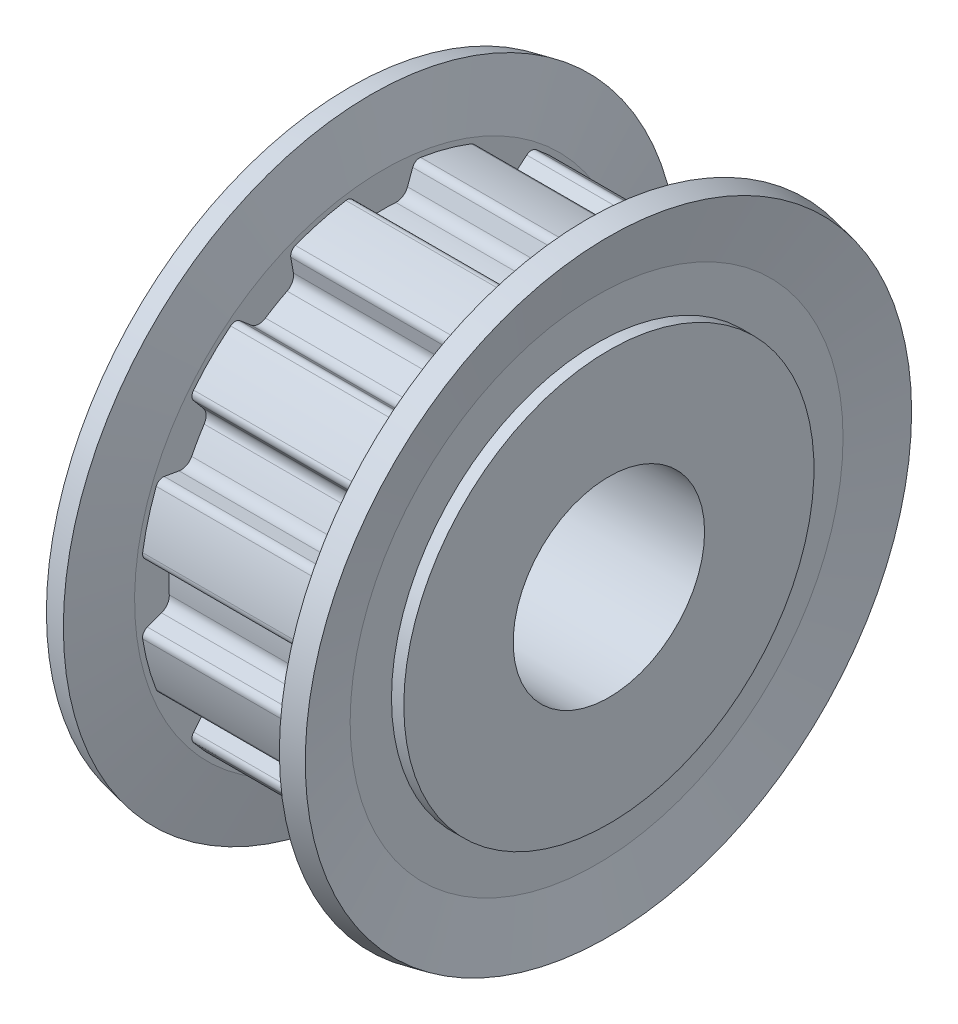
ISO-10303-21;
HEADER;
FILE_DESCRIPTION(('STEP AP214'),'2;1');
FILE_NAME('part.step','',(''),(''),'','','');
FILE_SCHEMA(('AUTOMOTIVE_DESIGN { 1 0 10303 214 1 1 1 1 }'));
ENDSEC;
DATA;
#1=APPLICATION_CONTEXT('core data for automotive mechanical design processes');
#2=APPLICATION_PROTOCOL_DEFINITION('international standard','automotive_design',2000,#1);
#3=PRODUCT_CONTEXT('',#1,'mechanical');
#4=PRODUCT('Part','Part','',(#3));
#5=PRODUCT_RELATED_PRODUCT_CATEGORY('part','',(#4));
#6=PRODUCT_DEFINITION_FORMATION('','',#4);
#7=PRODUCT_DEFINITION_CONTEXT('part definition',#1,'design');
#8=PRODUCT_DEFINITION('design','',#6,#7);
#9=PRODUCT_DEFINITION_SHAPE('','',#8);
#10=(LENGTH_UNIT() NAMED_UNIT(*) SI_UNIT(.MILLI.,.METRE.));
#11=(NAMED_UNIT(*) PLANE_ANGLE_UNIT() SI_UNIT($,.RADIAN.));
#12=(NAMED_UNIT(*) SI_UNIT($,.STERADIAN.) SOLID_ANGLE_UNIT());
#13=UNCERTAINTY_MEASURE_WITH_UNIT(LENGTH_MEASURE(1.E-05),#10,'distance_accuracy_value','');
#14=(GEOMETRIC_REPRESENTATION_CONTEXT(3) GLOBAL_UNCERTAINTY_ASSIGNED_CONTEXT((#13)) GLOBAL_UNIT_ASSIGNED_CONTEXT((#10,
#11,#12)) REPRESENTATION_CONTEXT('',''));
#15=CARTESIAN_POINT('',(0.,0.,0.));
#16=DIRECTION('',(0.,0.,1.));
#17=DIRECTION('',(1.,0.,0.));
#18=AXIS2_PLACEMENT_3D('',#15,#16,#17);
#19=CARTESIAN_POINT('',(16.5,1.13320811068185E-12,-5.55111512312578E-12));
#20=DIRECTION('',(-1.,0.,0.));
#21=DIRECTION('',(0.,0.,1.));
#22=AXIS2_PLACEMENT_3D('',#19,#20,#21);
#23=CYLINDRICAL_SURFACE('',#22,15.6800000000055);
#24=CARTESIAN_POINT('',(2.5,1.13320811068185E-12,-5.55111512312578E-12));
#25=DIRECTION('',(-1.,0.,0.));
#26=DIRECTION('',(0.,0.,1.));
#27=AXIS2_PLACEMENT_3D('',#24,#25,#26);
#28=CIRCLE('',#27,15.6800000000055);
#29=CARTESIAN_POINT('',(2.5,0.915306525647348,15.6532620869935));
#30=VERTEX_POINT('',#29);
#31=CARTESIAN_POINT('',(2.5,-0.915306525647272,15.6532620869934));
#32=VERTEX_POINT('',#31);
#33=EDGE_CURVE('E605',#30,#32,#28,.F.);
#34=ORIENTED_EDGE('',*,*,#33,.T.);
#35=DIRECTION('',(-1.,0.,0.));
#36=VECTOR('',#35,1.);
#37=CARTESIAN_POINT('',(16.5,-0.915306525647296,15.6532620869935));
#38=LINE('',#37,#36);
#39=CARTESIAN_POINT('',(16.5,-0.915306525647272,15.6532620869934));
#40=VERTEX_POINT('',#39);
#41=EDGE_CURVE('E614',#32,#40,#38,.F.);
#42=ORIENTED_EDGE('',*,*,#41,.T.);
#43=CARTESIAN_POINT('',(16.5,1.13320811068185E-12,-5.55111512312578E-12));
#44=DIRECTION('',(-1.,0.,0.));
#45=DIRECTION('',(0.,0.,1.));
#46=AXIS2_PLACEMENT_3D('',#43,#44,#45);
#47=CIRCLE('',#46,15.6800000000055);
#48=CARTESIAN_POINT('',(16.5,0.915306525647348,15.6532620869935));
#49=VERTEX_POINT('',#48);
#50=EDGE_CURVE('E20',#40,#49,#47,.T.);
#51=ORIENTED_EDGE('',*,*,#50,.T.);
#52=DIRECTION('',(-1.,0.,0.));
#53=VECTOR('',#52,1.);
#54=CARTESIAN_POINT('',(16.5,0.915306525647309,15.6532620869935));
#55=LINE('',#54,#53);
#56=EDGE_CURVE('E612',#49,#30,#55,.T.);
#57=ORIENTED_EDGE('',*,*,#56,.T.);
#58=EDGE_LOOP('',(#34,#42,#51,#57));
#59=FACE_BOUND('',#58,.T.);
#60=ADVANCED_FACE('F17',(#59),#23,.T.);
#61=CARTESIAN_POINT('',(16.5,0.965508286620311,16.5117955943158));
#62=DIRECTION('',(-1.,0.,0.));
#63=DIRECTION('',(0.,0.,1.));
#64=AXIS2_PLACEMENT_3D('',#61,#62,#63);
#65=CYLINDRICAL_SURFACE('',#64,0.859999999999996);
#66=ORIENTED_EDGE('',*,*,#56,.F.);
#67=CARTESIAN_POINT('',(16.5,0.965508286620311,16.5117955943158));
#68=DIRECTION('',(-1.,0.,0.));
#69=DIRECTION('',(0.,0.,1.));
#70=AXIS2_PLACEMENT_3D('',#67,#68,#69);
#71=CIRCLE('',#70,0.859999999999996);
#72=CARTESIAN_POINT('',(16.5,1.77364394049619,16.2176582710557));
#73=VERTEX_POINT('',#72);
#74=EDGE_CURVE('E621',#73,#49,#71,.T.);
#75=ORIENTED_EDGE('',*,*,#74,.F.);
#76=DIRECTION('',(1.,0.,0.));
#77=VECTOR('',#76,1.);
#78=CARTESIAN_POINT('',(16.5,1.77364394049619,16.2176582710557));
#79=LINE('',#78,#77);
#80=CARTESIAN_POINT('',(2.5,1.77364394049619,16.2176582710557));
#81=VERTEX_POINT('',#80);
#82=EDGE_CURVE('E637',#73,#81,#79,.F.);
#83=ORIENTED_EDGE('',*,*,#82,.T.);
#84=CARTESIAN_POINT('',(2.5,0.965508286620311,16.5117955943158));
#85=DIRECTION('',(-1.,0.,0.));
#86=DIRECTION('',(0.,0.,1.));
#87=AXIS2_PLACEMENT_3D('',#84,#85,#86);
#88=CIRCLE('',#87,0.859999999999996);
#89=EDGE_CURVE('E623',#30,#81,#88,.F.);
#90=ORIENTED_EDGE('',*,*,#89,.F.);
#91=EDGE_LOOP('',(#66,#75,#83,#90));
#92=FACE_BOUND('',#91,.T.);
#93=ADVANCED_FACE('F619',(#92),#65,.F.);
#94=CARTESIAN_POINT('',(16.5,-0.965508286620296,16.5117955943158));
#95=DIRECTION('',(-1.,0.,0.));
#96=DIRECTION('',(0.,0.,1.));
#97=AXIS2_PLACEMENT_3D('',#94,#95,#96);
#98=CYLINDRICAL_SURFACE('',#97,0.86000000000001);
#99=DIRECTION('',(1.,0.,0.));
#100=VECTOR('',#99,1.);
#101=CARTESIAN_POINT('',(16.5,-1.77364394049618,16.2176582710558));
#102=LINE('',#101,#100);
#103=CARTESIAN_POINT('',(2.5,-1.77364394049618,16.2176582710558));
#104=VERTEX_POINT('',#103);
#105=CARTESIAN_POINT('',(16.5,-1.77364394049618,16.2176582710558));
#106=VERTEX_POINT('',#105);
#107=EDGE_CURVE('E641',#104,#106,#102,.T.);
#108=ORIENTED_EDGE('',*,*,#107,.T.);
#109=CARTESIAN_POINT('',(16.5,-0.965508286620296,16.5117955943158));
#110=DIRECTION('',(-1.,0.,0.));
#111=DIRECTION('',(0.,0.,1.));
#112=AXIS2_PLACEMENT_3D('',#109,#110,#111);
#113=CIRCLE('',#112,0.86000000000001);
#114=EDGE_CURVE('E632',#40,#106,#113,.T.);
#115=ORIENTED_EDGE('',*,*,#114,.F.);
#116=ORIENTED_EDGE('',*,*,#41,.F.);
#117=CARTESIAN_POINT('',(2.5,-0.965508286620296,16.5117955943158));
#118=DIRECTION('',(-1.,0.,0.));
#119=DIRECTION('',(0.,0.,1.));
#120=AXIS2_PLACEMENT_3D('',#117,#118,#119);
#121=CIRCLE('',#120,0.86000000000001);
#122=EDGE_CURVE('E634',#104,#32,#121,.F.);
#123=ORIENTED_EDGE('',*,*,#122,.F.);
#124=EDGE_LOOP('',(#108,#115,#116,#123));
#125=FACE_BOUND('',#124,.T.);
#126=ADVANCED_FACE('F2515',(#125),#98,.F.);
#127=CARTESIAN_POINT('',(16.5,2.15188824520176,17.2568759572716));
#128=DIRECTION('',(0.,0.939692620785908,-0.34202014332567));
#129=DIRECTION('',(0.,0.34202014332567,0.939692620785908));
#130=AXIS2_PLACEMENT_3D('',#127,#128,#129);
#131=PLANE('',#130);
#132=ORIENTED_EDGE('',*,*,#82,.F.);
#133=DIRECTION('',(0.,0.34202014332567,0.939692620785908));
#134=VECTOR('',#133,1.);
#135=CARTESIAN_POINT('',(16.5,1.77364394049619,16.2176582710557));
#136=LINE('',#135,#134);
#137=CARTESIAN_POINT('',(16.5,2.15188824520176,17.2568759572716));
#138=VERTEX_POINT('',#137);
#139=EDGE_CURVE('E628',#138,#73,#136,.F.);
#140=ORIENTED_EDGE('',*,*,#139,.F.);
#141=DIRECTION('',(-1.,0.,0.));
#142=VECTOR('',#141,1.);
#143=CARTESIAN_POINT('',(16.5,2.15188824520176,17.2568759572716));
#144=LINE('',#143,#142);
#145=CARTESIAN_POINT('',(2.5,2.15188824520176,17.2568759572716));
#146=VERTEX_POINT('',#145);
#147=EDGE_CURVE('E648',#146,#138,#144,.F.);
#148=ORIENTED_EDGE('',*,*,#147,.F.);
#149=DIRECTION('',(0.,0.34202014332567,0.939692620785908));
#150=VECTOR('',#149,1.);
#151=CARTESIAN_POINT('',(2.5,1.77364394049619,16.2176582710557));
#152=LINE('',#151,#150);
#153=EDGE_CURVE('E638',#81,#146,#152,.T.);
#154=ORIENTED_EDGE('',*,*,#153,.F.);
#155=EDGE_LOOP('',(#132,#140,#148,#154));
#156=FACE_BOUND('',#155,.T.);
#157=ADVANCED_FACE('F2505',(#156),#131,.F.);
#158=CARTESIAN_POINT('',(16.5,-1.77364394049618,16.2176582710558));
#159=DIRECTION('',(0.,-0.93969262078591,-0.342020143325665));
#160=DIRECTION('',(0.,0.342020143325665,-0.93969262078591));
#161=AXIS2_PLACEMENT_3D('',#158,#159,#160);
#162=PLANE('',#161);
#163=DIRECTION('',(-1.,0.,0.));
#164=VECTOR('',#163,1.);
#165=CARTESIAN_POINT('',(16.5,-2.15188824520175,17.2568759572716));
#166=LINE('',#165,#164);
#167=CARTESIAN_POINT('',(16.5,-2.15188824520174,17.2568759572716));
#168=VERTEX_POINT('',#167);
#169=CARTESIAN_POINT('',(2.5,-2.15188824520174,17.2568759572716));
#170=VERTEX_POINT('',#169);
#171=EDGE_CURVE('E764',#168,#170,#166,.T.);
#172=ORIENTED_EDGE('',*,*,#171,.F.);
#173=DIRECTION('',(0.,0.342020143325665,-0.93969262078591));
#174=VECTOR('',#173,1.);
#175=CARTESIAN_POINT('',(16.5,-2.15188824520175,17.2568759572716));
#176=LINE('',#175,#174);
#177=EDGE_CURVE('E642',#106,#168,#176,.F.);
#178=ORIENTED_EDGE('',*,*,#177,.F.);
#179=ORIENTED_EDGE('',*,*,#107,.F.);
#180=DIRECTION('',(0.,0.342020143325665,-0.93969262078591));
#181=VECTOR('',#180,1.);
#182=CARTESIAN_POINT('',(2.5,-2.15188824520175,17.2568759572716));
#183=LINE('',#182,#181);
#184=EDGE_CURVE('E645',#170,#104,#183,.T.);
#185=ORIENTED_EDGE('',*,*,#184,.F.);
#186=EDGE_LOOP('',(#172,#178,#179,#185));
#187=FACE_BOUND('',#186,.T.);
#188=ADVANCED_FACE('F2495',(#187),#162,.F.);
#189=CARTESIAN_POINT('',(16.5,6.57280842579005,14.9317260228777));
#190=DIRECTION('',(0.,-0.984807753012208,0.173648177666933));
#191=DIRECTION('',(0.,-0.173648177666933,-0.984807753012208));
#192=AXIS2_PLACEMENT_3D('',#189,#190,#191);
#193=PLANE('',#192);
#194=DIRECTION('',(-1.,0.,0.));
#195=VECTOR('',#194,1.);
#196=CARTESIAN_POINT('',(16.5,6.76484809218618,16.0208370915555));
#197=LINE('',#196,#195);
#198=CARTESIAN_POINT('',(16.5,6.76484809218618,16.0208370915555));
#199=VERTEX_POINT('',#198);
#200=CARTESIAN_POINT('',(2.5,6.76484809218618,16.0208370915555));
#201=VERTEX_POINT('',#200);
#202=EDGE_CURVE('E769',#199,#201,#197,.T.);
#203=ORIENTED_EDGE('',*,*,#202,.F.);
#204=DIRECTION('',(0.,-0.173648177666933,-0.984807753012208));
#205=VECTOR('',#204,1.);
#206=CARTESIAN_POINT('',(16.5,6.76484809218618,16.0208370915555));
#207=LINE('',#206,#205);
#208=CARTESIAN_POINT('',(16.5,6.57280842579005,14.9317260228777));
#209=VERTEX_POINT('',#208);
#210=EDGE_CURVE('E649',#209,#199,#207,.F.);
#211=ORIENTED_EDGE('',*,*,#210,.F.);
#212=DIRECTION('',(-1.,0.,0.));
#213=VECTOR('',#212,1.);
#214=CARTESIAN_POINT('',(16.5,6.57280842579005,14.9317260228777));
#215=LINE('',#214,#213);
#216=CARTESIAN_POINT('',(2.5,6.57280842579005,14.9317260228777));
#217=VERTEX_POINT('',#216);
#218=EDGE_CURVE('E773',#209,#217,#215,.T.);
#219=ORIENTED_EDGE('',*,*,#218,.T.);
#220=DIRECTION('',(0.,-0.173648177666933,-0.984807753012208));
#221=VECTOR('',#220,1.);
#222=CARTESIAN_POINT('',(2.5,6.76484809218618,16.0208370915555));
#223=LINE('',#222,#221);
#224=EDGE_CURVE('E652',#201,#217,#223,.T.);
#225=ORIENTED_EDGE('',*,*,#224,.F.);
#226=EDGE_LOOP('',(#203,#211,#219,#225));
#227=FACE_BOUND('',#226,.T.);
#228=ADVANCED_FACE('F2485',(#227),#193,.F.);
#229=CARTESIAN_POINT('',(16.5,10.4920278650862,13.8689488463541));
#230=DIRECTION('',(0.,0.642787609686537,-0.76604444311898));
#231=DIRECTION('',(0.,0.76604444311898,0.642787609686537));
#232=AXIS2_PLACEMENT_3D('',#229,#230,#231);
#233=PLANE('',#232);
#234=DIRECTION('',(-1.,0.,0.));
#235=VECTOR('',#234,1.);
#236=CARTESIAN_POINT('',(16.5,9.64484984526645,13.1580820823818));
#237=LINE('',#236,#235);
#238=CARTESIAN_POINT('',(2.5,9.64484984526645,13.1580820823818));
#239=VERTEX_POINT('',#238);
#240=CARTESIAN_POINT('',(16.5,9.64484984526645,13.1580820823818));
#241=VERTEX_POINT('',#240);
#242=EDGE_CURVE('E777',#239,#241,#237,.F.);
#243=ORIENTED_EDGE('',*,*,#242,.T.);
#244=DIRECTION('',(0.,0.76604444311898,0.642787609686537));
#245=VECTOR('',#244,1.);
#246=CARTESIAN_POINT('',(16.5,9.64484984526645,13.1580820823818));
#247=LINE('',#246,#245);
#248=CARTESIAN_POINT('',(16.5,10.4920278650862,13.8689488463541));
#249=VERTEX_POINT('',#248);
#250=EDGE_CURVE('E654',#249,#241,#247,.F.);
#251=ORIENTED_EDGE('',*,*,#250,.F.);
#252=DIRECTION('',(-1.,0.,0.));
#253=VECTOR('',#252,1.);
#254=CARTESIAN_POINT('',(16.5,10.4920278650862,13.8689488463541));
#255=LINE('',#254,#253);
#256=CARTESIAN_POINT('',(2.5,10.4920278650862,13.8689488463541));
#257=VERTEX_POINT('',#256);
#258=EDGE_CURVE('E659',#257,#249,#255,.F.);
#259=ORIENTED_EDGE('',*,*,#258,.F.);
#260=DIRECTION('',(0.,0.76604444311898,0.642787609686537));
#261=VECTOR('',#260,1.);
#262=CARTESIAN_POINT('',(2.5,9.64484984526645,13.1580820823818));
#263=LINE('',#262,#261);
#264=EDGE_CURVE('E656',#239,#257,#263,.T.);
#265=ORIENTED_EDGE('',*,*,#264,.F.);
#266=EDGE_LOOP('',(#243,#251,#259,#265));
#267=FACE_BOUND('',#266,.T.);
#268=ADVANCED_FACE('F2475',(#267),#233,.F.);
#269=CARTESIAN_POINT('',(16.5,13.1580820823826,9.64484984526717));
#270=DIRECTION('',(0.,-0.766044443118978,0.64278760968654));
#271=DIRECTION('',(0.,-0.64278760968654,-0.766044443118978));
#272=AXIS2_PLACEMENT_3D('',#269,#270,#271);
#273=PLANE('',#272);
#274=DIRECTION('',(-1.,0.,0.));
#275=VECTOR('',#274,1.);
#276=CARTESIAN_POINT('',(16.5,13.8689488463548,10.4920278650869));
#277=LINE('',#276,#275);
#278=CARTESIAN_POINT('',(16.5,13.8689488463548,10.4920278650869));
#279=VERTEX_POINT('',#278);
#280=CARTESIAN_POINT('',(2.5,13.8689488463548,10.4920278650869));
#281=VERTEX_POINT('',#280);
#282=EDGE_CURVE('E781',#279,#281,#277,.T.);
#283=ORIENTED_EDGE('',*,*,#282,.F.);
#284=DIRECTION('',(0.,-0.64278760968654,-0.766044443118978));
#285=VECTOR('',#284,1.);
#286=CARTESIAN_POINT('',(16.5,13.8689488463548,10.4920278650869));
#287=LINE('',#286,#285);
#288=CARTESIAN_POINT('',(16.5,13.1580820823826,9.64484984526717));
#289=VERTEX_POINT('',#288);
#290=EDGE_CURVE('E660',#289,#279,#287,.F.);
#291=ORIENTED_EDGE('',*,*,#290,.F.);
#292=DIRECTION('',(-1.,0.,0.));
#293=VECTOR('',#292,1.);
#294=CARTESIAN_POINT('',(16.5,13.1580820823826,9.64484984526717));
#295=LINE('',#294,#293);
#296=CARTESIAN_POINT('',(2.5,13.1580820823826,9.64484984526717));
#297=VERTEX_POINT('',#296);
#298=EDGE_CURVE('E785',#289,#297,#295,.T.);
#299=ORIENTED_EDGE('',*,*,#298,.T.);
#300=DIRECTION('',(0.,-0.64278760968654,-0.766044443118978));
#301=VECTOR('',#300,1.);
#302=CARTESIAN_POINT('',(2.5,13.8689488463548,10.4920278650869));
#303=LINE('',#302,#301);
#304=EDGE_CURVE('E663',#281,#297,#303,.T.);
#305=ORIENTED_EDGE('',*,*,#304,.F.);
#306=EDGE_LOOP('',(#283,#291,#299,#305));
#307=FACE_BOUND('',#306,.T.);
#308=ADVANCED_FACE('F2465',(#307),#273,.F.);
#309=CARTESIAN_POINT('',(16.5,16.0208370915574,6.76484809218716));
#310=DIRECTION('',(0.,0.173648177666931,-0.984807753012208));
#311=DIRECTION('',(0.,0.984807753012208,0.173648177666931));
#312=AXIS2_PLACEMENT_3D('',#309,#310,#311);
#313=PLANE('',#312);
#314=DIRECTION('',(-1.,0.,0.));
#315=VECTOR('',#314,1.);
#316=CARTESIAN_POINT('',(16.5,14.9317260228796,6.57280842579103));
#317=LINE('',#316,#315);
#318=CARTESIAN_POINT('',(2.5,14.9317260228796,6.57280842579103));
#319=VERTEX_POINT('',#318);
#320=CARTESIAN_POINT('',(16.5,14.9317260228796,6.57280842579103));
#321=VERTEX_POINT('',#320);
#322=EDGE_CURVE('E789',#319,#321,#317,.F.);
#323=ORIENTED_EDGE('',*,*,#322,.T.);
#324=DIRECTION('',(0.,0.984807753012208,0.173648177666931));
#325=VECTOR('',#324,1.);
#326=CARTESIAN_POINT('',(16.5,14.9317260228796,6.57280842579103));
#327=LINE('',#326,#325);
#328=CARTESIAN_POINT('',(16.5,16.0208370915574,6.76484809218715));
#329=VERTEX_POINT('',#328);
#330=EDGE_CURVE('E665',#329,#321,#327,.F.);
#331=ORIENTED_EDGE('',*,*,#330,.F.);
#332=DIRECTION('',(-1.,0.,0.));
#333=VECTOR('',#332,1.);
#334=CARTESIAN_POINT('',(16.5,16.0208370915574,6.76484809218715));
#335=LINE('',#334,#333);
#336=CARTESIAN_POINT('',(2.5,16.0208370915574,6.76484809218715));
#337=VERTEX_POINT('',#336);
#338=EDGE_CURVE('E670',#337,#329,#335,.F.);
#339=ORIENTED_EDGE('',*,*,#338,.F.);
#340=DIRECTION('',(0.,0.984807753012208,0.173648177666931));
#341=VECTOR('',#340,1.);
#342=CARTESIAN_POINT('',(2.5,14.9317260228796,6.57280842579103));
#343=LINE('',#342,#341);
#344=EDGE_CURVE('E667',#319,#337,#343,.T.);
#345=ORIENTED_EDGE('',*,*,#344,.F.);
#346=EDGE_LOOP('',(#323,#331,#339,#345));
#347=FACE_BOUND('',#346,.T.);
#348=ADVANCED_FACE('F2455',(#347),#313,.F.);
#349=CARTESIAN_POINT('',(16.5,16.2176582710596,1.77364394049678));
#350=DIRECTION('',(0.,-0.342020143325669,0.939692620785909));
#351=DIRECTION('',(0.,-0.939692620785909,-0.342020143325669));
#352=AXIS2_PLACEMENT_3D('',#349,#350,#351);
#353=PLANE('',#352);
#354=DIRECTION('',(-1.,0.,0.));
#355=VECTOR('',#354,1.);
#356=CARTESIAN_POINT('',(16.5,17.2568759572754,2.15188824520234));
#357=LINE('',#356,#355);
#358=CARTESIAN_POINT('',(16.5,17.2568759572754,2.15188824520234));
#359=VERTEX_POINT('',#358);
#360=CARTESIAN_POINT('',(2.5,17.2568759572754,2.15188824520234));
#361=VERTEX_POINT('',#360);
#362=EDGE_CURVE('E793',#359,#361,#357,.T.);
#363=ORIENTED_EDGE('',*,*,#362,.F.);
#364=DIRECTION('',(0.,-0.939692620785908,-0.342020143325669));
#365=VECTOR('',#364,1.);
#366=CARTESIAN_POINT('',(16.5,17.2568759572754,2.15188824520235));
#367=LINE('',#366,#365);
#368=CARTESIAN_POINT('',(16.5,16.2176582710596,1.77364394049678));
#369=VERTEX_POINT('',#368);
#370=EDGE_CURVE('E671',#369,#359,#367,.F.);
#371=ORIENTED_EDGE('',*,*,#370,.F.);
#372=DIRECTION('',(-1.,0.,0.));
#373=VECTOR('',#372,1.);
#374=CARTESIAN_POINT('',(16.5,16.2176582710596,1.77364394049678));
#375=LINE('',#374,#373);
#376=CARTESIAN_POINT('',(2.5,16.2176582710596,1.77364394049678));
#377=VERTEX_POINT('',#376);
#378=EDGE_CURVE('E797',#369,#377,#375,.T.);
#379=ORIENTED_EDGE('',*,*,#378,.T.);
#380=DIRECTION('',(0.,-0.939692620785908,-0.342020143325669));
#381=VECTOR('',#380,1.);
#382=CARTESIAN_POINT('',(2.5,17.2568759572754,2.15188824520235));
#383=LINE('',#382,#381);
#384=EDGE_CURVE('E674',#361,#377,#383,.T.);
#385=ORIENTED_EDGE('',*,*,#384,.F.);
#386=EDGE_LOOP('',(#363,#371,#379,#385));
#387=FACE_BOUND('',#386,.T.);
#388=ADVANCED_FACE('F2445',(#387),#353,.F.);
#389=CARTESIAN_POINT('',(16.5,17.2568759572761,-2.15188824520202));
#390=DIRECTION('',(0.,-0.342020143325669,-0.939692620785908));
#391=DIRECTION('',(0.,0.939692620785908,-0.342020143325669));
#392=AXIS2_PLACEMENT_3D('',#389,#390,#391);
#393=PLANE('',#392);
#394=DIRECTION('',(-1.,0.,0.));
#395=VECTOR('',#394,1.);
#396=CARTESIAN_POINT('',(16.5,16.2176582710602,-1.77364394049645));
#397=LINE('',#396,#395);
#398=CARTESIAN_POINT('',(2.5,16.2176582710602,-1.77364394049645));
#399=VERTEX_POINT('',#398);
#400=CARTESIAN_POINT('',(16.5,16.2176582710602,-1.77364394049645));
#401=VERTEX_POINT('',#400);
#402=EDGE_CURVE('E801',#399,#401,#397,.F.);
#403=ORIENTED_EDGE('',*,*,#402,.T.);
#404=DIRECTION('',(0.,0.939692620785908,-0.34202014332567));
#405=VECTOR('',#404,1.);
#406=CARTESIAN_POINT('',(16.5,16.2176582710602,-1.77364394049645));
#407=LINE('',#406,#405);
#408=CARTESIAN_POINT('',(16.5,17.2568759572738,-2.15188824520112));
#409=VERTEX_POINT('',#408);
#410=EDGE_CURVE('E676',#409,#401,#407,.F.);
#411=ORIENTED_EDGE('',*,*,#410,.F.);
#412=DIRECTION('',(-1.,0.,0.));
#413=VECTOR('',#412,1.);
#414=CARTESIAN_POINT('',(16.5,17.2568759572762,-2.15188824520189));
#415=LINE('',#414,#413);
#416=CARTESIAN_POINT('',(2.5,17.2568759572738,-2.15188824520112));
#417=VERTEX_POINT('',#416);
#418=EDGE_CURVE('E800',#417,#409,#415,.F.);
#419=ORIENTED_EDGE('',*,*,#418,.F.);
#420=DIRECTION('',(0.,0.939692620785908,-0.34202014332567));
#421=VECTOR('',#420,1.);
#422=CARTESIAN_POINT('',(2.5,16.2176582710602,-1.77364394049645));
#423=LINE('',#422,#421);
#424=EDGE_CURVE('E678',#399,#417,#423,.T.);
#425=ORIENTED_EDGE('',*,*,#424,.F.);
#426=EDGE_LOOP('',(#403,#411,#419,#425));
#427=FACE_BOUND('',#426,.T.);
#428=ADVANCED_FACE('F2435',(#427),#393,.F.);
#429=CARTESIAN_POINT('',(16.5,14.931726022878,-6.57280842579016));
#430=DIRECTION('',(0.,0.173648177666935,0.984807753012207));
#431=DIRECTION('',(0.,-0.984807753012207,0.173648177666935));
#432=AXIS2_PLACEMENT_3D('',#429,#430,#431);
#433=PLANE('',#432);
#434=DIRECTION('',(-1.,0.,0.));
#435=VECTOR('',#434,1.);
#436=CARTESIAN_POINT('',(16.5,16.0208370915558,-6.76484809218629));
#437=LINE('',#436,#435);
#438=CARTESIAN_POINT('',(16.5,16.0208370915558,-6.76484809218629));
#439=VERTEX_POINT('',#438);
#440=CARTESIAN_POINT('',(2.5,16.0208370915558,-6.76484809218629));
#441=VERTEX_POINT('',#440);
#442=EDGE_CURVE('E806',#439,#441,#437,.T.);
#443=ORIENTED_EDGE('',*,*,#442,.F.);
#444=DIRECTION('',(0.,-0.984807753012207,0.173648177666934));
#445=VECTOR('',#444,1.);
#446=CARTESIAN_POINT('',(16.5,16.0208370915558,-6.76484809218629));
#447=LINE('',#446,#445);
#448=CARTESIAN_POINT('',(16.5,14.9317260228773,-6.57280842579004));
#449=VERTEX_POINT('',#448);
#450=EDGE_CURVE('E680',#449,#439,#447,.F.);
#451=ORIENTED_EDGE('',*,*,#450,.F.);
#452=DIRECTION('',(-1.,0.,0.));
#453=VECTOR('',#452,1.);
#454=CARTESIAN_POINT('',(16.5,14.931726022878,-6.57280842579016));
#455=LINE('',#454,#453);
#456=CARTESIAN_POINT('',(2.5,14.9317260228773,-6.57280842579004));
#457=VERTEX_POINT('',#456);
#458=EDGE_CURVE('E686',#449,#457,#455,.T.);
#459=ORIENTED_EDGE('',*,*,#458,.T.);
#460=DIRECTION('',(0.,-0.984807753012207,0.173648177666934));
#461=VECTOR('',#460,1.);
#462=CARTESIAN_POINT('',(2.5,16.0208370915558,-6.76484809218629));
#463=LINE('',#462,#461);
#464=EDGE_CURVE('E683',#441,#457,#463,.T.);
#465=ORIENTED_EDGE('',*,*,#464,.F.);
#466=EDGE_LOOP('',(#443,#451,#459,#465));
#467=FACE_BOUND('',#466,.T.);
#468=ADVANCED_FACE('F2425',(#467),#433,.F.);
#469=CARTESIAN_POINT('',(16.5,13.8689488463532,-10.4920278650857));
#470=DIRECTION('',(0.,-0.766044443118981,-0.642787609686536));
#471=DIRECTION('',(0.,0.642787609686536,-0.766044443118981));
#472=AXIS2_PLACEMENT_3D('',#469,#470,#471);
#473=PLANE('',#472);
#474=DIRECTION('',(-1.,0.,0.));
#475=VECTOR('',#474,1.);
#476=CARTESIAN_POINT('',(16.5,13.158082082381,-9.64484984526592));
#477=LINE('',#476,#475);
#478=CARTESIAN_POINT('',(2.5,13.158082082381,-9.64484984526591));
#479=VERTEX_POINT('',#478);
#480=CARTESIAN_POINT('',(16.5,13.158082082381,-9.64484984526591));
#481=VERTEX_POINT('',#480);
#482=EDGE_CURVE('E809',#479,#481,#477,.F.);
#483=ORIENTED_EDGE('',*,*,#482,.T.);
#484=DIRECTION('',(0.,0.642787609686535,-0.766044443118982));
#485=VECTOR('',#484,1.);
#486=CARTESIAN_POINT('',(16.5,13.158082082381,-9.64484984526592));
#487=LINE('',#486,#485);
#488=CARTESIAN_POINT('',(16.5,13.8689488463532,-10.4920278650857));
#489=VERTEX_POINT('',#488);
#490=EDGE_CURVE('E687',#489,#481,#487,.F.);
#491=ORIENTED_EDGE('',*,*,#490,.F.);
#492=DIRECTION('',(-1.,0.,0.));
#493=VECTOR('',#492,1.);
#494=CARTESIAN_POINT('',(16.5,13.8689488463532,-10.4920278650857));
#495=LINE('',#494,#493);
#496=CARTESIAN_POINT('',(2.5,13.8689488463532,-10.4920278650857));
#497=VERTEX_POINT('',#496);
#498=EDGE_CURVE('E812',#497,#489,#495,.F.);
#499=ORIENTED_EDGE('',*,*,#498,.F.);
#500=DIRECTION('',(0.,0.642787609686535,-0.766044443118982));
#501=VECTOR('',#500,1.);
#502=CARTESIAN_POINT('',(2.5,13.158082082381,-9.64484984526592));
#503=LINE('',#502,#501);
#504=EDGE_CURVE('E689',#479,#497,#503,.T.);
#505=ORIENTED_EDGE('',*,*,#504,.F.);
#506=EDGE_LOOP('',(#483,#491,#499,#505));
#507=FACE_BOUND('',#506,.T.);
#508=ADVANCED_FACE('F2415',(#507),#473,.F.);
#509=CARTESIAN_POINT('',(16.5,9.64484984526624,-13.1580820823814));
#510=DIRECTION('',(0.,0.642787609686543,0.766044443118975));
#511=DIRECTION('',(0.,-0.766044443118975,0.642787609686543));
#512=AXIS2_PLACEMENT_3D('',#509,#510,#511);
#513=PLANE('',#512);
#514=DIRECTION('',(-1.,0.,0.));
#515=VECTOR('',#514,1.);
#516=CARTESIAN_POINT('',(16.5,10.492027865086,-13.8689488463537));
#517=LINE('',#516,#515);
#518=CARTESIAN_POINT('',(16.5,10.492027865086,-13.8689488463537));
#519=VERTEX_POINT('',#518);
#520=CARTESIAN_POINT('',(2.5,10.492027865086,-13.8689488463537));
#521=VERTEX_POINT('',#520);
#522=EDGE_CURVE('E817',#519,#521,#517,.T.);
#523=ORIENTED_EDGE('',*,*,#522,.F.);
#524=DIRECTION('',(0.,-0.766044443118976,0.642787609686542));
#525=VECTOR('',#524,1.);
#526=CARTESIAN_POINT('',(16.5,10.492027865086,-13.8689488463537));
#527=LINE('',#526,#525);
#528=CARTESIAN_POINT('',(16.5,9.64484984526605,-13.1580820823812));
#529=VERTEX_POINT('',#528);
#530=EDGE_CURVE('E691',#529,#519,#527,.F.);
#531=ORIENTED_EDGE('',*,*,#530,.F.);
#532=DIRECTION('',(-1.,0.,0.));
#533=VECTOR('',#532,1.);
#534=CARTESIAN_POINT('',(16.5,9.64484984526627,-13.1580820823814));
#535=LINE('',#534,#533);
#536=CARTESIAN_POINT('',(2.5,9.64484984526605,-13.1580820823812));
#537=VERTEX_POINT('',#536);
#538=EDGE_CURVE('E697',#529,#537,#535,.T.);
#539=ORIENTED_EDGE('',*,*,#538,.T.);
#540=DIRECTION('',(0.,-0.766044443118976,0.642787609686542));
#541=VECTOR('',#540,1.);
#542=CARTESIAN_POINT('',(2.5,10.492027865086,-13.8689488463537));
#543=LINE('',#542,#541);
#544=EDGE_CURVE('E694',#521,#537,#543,.T.);
#545=ORIENTED_EDGE('',*,*,#544,.F.);
#546=EDGE_LOOP('',(#523,#531,#539,#545));
#547=FACE_BOUND('',#546,.T.);
#548=ADVANCED_FACE('F2405',(#547),#513,.F.);
#549=CARTESIAN_POINT('',(16.5,6.76484809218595,-16.020837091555));
#550=DIRECTION('',(0.,-0.984807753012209,-0.173648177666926));
#551=DIRECTION('',(0.,0.173648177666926,-0.984807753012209));
#552=AXIS2_PLACEMENT_3D('',#549,#550,#551);
#553=PLANE('',#552);
#554=DIRECTION('',(-1.,0.,0.));
#555=VECTOR('',#554,1.);
#556=CARTESIAN_POINT('',(16.5,6.57280842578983,-14.9317260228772));
#557=LINE('',#556,#555);
#558=CARTESIAN_POINT('',(2.5,6.57280842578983,-14.9317260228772));
#559=VERTEX_POINT('',#558);
#560=CARTESIAN_POINT('',(16.5,6.57280842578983,-14.9317260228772));
#561=VERTEX_POINT('',#560);
#562=EDGE_CURVE('E820',#559,#561,#557,.F.);
#563=ORIENTED_EDGE('',*,*,#562,.T.);
#564=DIRECTION('',(0.,0.173648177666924,-0.984807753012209));
#565=VECTOR('',#564,1.);
#566=CARTESIAN_POINT('',(16.5,6.57280842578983,-14.9317260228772));
#567=LINE('',#566,#565);
#568=CARTESIAN_POINT('',(16.5,6.76484809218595,-16.020837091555));
#569=VERTEX_POINT('',#568);
#570=EDGE_CURVE('E698',#569,#561,#567,.F.);
#571=ORIENTED_EDGE('',*,*,#570,.F.);
#572=DIRECTION('',(-1.,0.,0.));
#573=VECTOR('',#572,1.);
#574=CARTESIAN_POINT('',(16.5,6.76484809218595,-16.020837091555));
#575=LINE('',#574,#573);
#576=CARTESIAN_POINT('',(2.5,6.76484809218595,-16.020837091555));
#577=VERTEX_POINT('',#576);
#578=EDGE_CURVE('E823',#577,#569,#575,.F.);
#579=ORIENTED_EDGE('',*,*,#578,.F.);
#580=DIRECTION('',(0.,0.173648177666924,-0.984807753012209));
#581=VECTOR('',#580,1.);
#582=CARTESIAN_POINT('',(2.5,6.57280842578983,-14.9317260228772));
#583=LINE('',#582,#581);
#584=EDGE_CURVE('E700',#559,#577,#583,.T.);
#585=ORIENTED_EDGE('',*,*,#584,.F.);
#586=EDGE_LOOP('',(#563,#571,#579,#585));
#587=FACE_BOUND('',#586,.T.);
#588=ADVANCED_FACE('F2395',(#587),#553,.F.);
#589=CARTESIAN_POINT('',(16.5,1.77364394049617,-16.2176582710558));
#590=DIRECTION('',(0.,0.93969262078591,0.342020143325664));
#591=DIRECTION('',(0.,-0.342020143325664,0.93969262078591));
#592=AXIS2_PLACEMENT_3D('',#589,#590,#591);
#593=PLANE('',#592);
#594=DIRECTION('',(-1.,0.,0.));
#595=VECTOR('',#594,1.);
#596=CARTESIAN_POINT('',(16.5,2.15188824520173,-17.2568759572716));
#597=LINE('',#596,#595);
#598=CARTESIAN_POINT('',(16.5,2.15188824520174,-17.2568759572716));
#599=VERTEX_POINT('',#598);
#600=CARTESIAN_POINT('',(2.5,2.15188824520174,-17.2568759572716));
#601=VERTEX_POINT('',#600);
#602=EDGE_CURVE('E828',#599,#601,#597,.T.);
#603=ORIENTED_EDGE('',*,*,#602,.F.);
#604=DIRECTION('',(0.,-0.342020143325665,0.93969262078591));
#605=VECTOR('',#604,1.);
#606=CARTESIAN_POINT('',(16.5,2.15188824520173,-17.2568759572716));
#607=LINE('',#606,#605);
#608=CARTESIAN_POINT('',(16.5,1.77364394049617,-16.2176582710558));
#609=VERTEX_POINT('',#608);
#610=EDGE_CURVE('E702',#609,#599,#607,.F.);
#611=ORIENTED_EDGE('',*,*,#610,.F.);
#612=DIRECTION('',(-1.,0.,0.));
#613=VECTOR('',#612,1.);
#614=CARTESIAN_POINT('',(16.5,1.77364394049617,-16.2176582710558));
#615=LINE('',#614,#613);
#616=CARTESIAN_POINT('',(2.5,1.77364394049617,-16.2176582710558));
#617=VERTEX_POINT('',#616);
#618=EDGE_CURVE('E708',#609,#617,#615,.T.);
#619=ORIENTED_EDGE('',*,*,#618,.T.);
#620=DIRECTION('',(0.,-0.342020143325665,0.93969262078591));
#621=VECTOR('',#620,1.);
#622=CARTESIAN_POINT('',(2.5,2.15188824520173,-17.2568759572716));
#623=LINE('',#622,#621);
#624=EDGE_CURVE('E705',#601,#617,#623,.T.);
#625=ORIENTED_EDGE('',*,*,#624,.F.);
#626=EDGE_LOOP('',(#603,#611,#619,#625));
#627=FACE_BOUND('',#626,.T.);
#628=ADVANCED_FACE('F2385',(#627),#593,.F.);
#629=CARTESIAN_POINT('',(16.5,-2.15188824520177,-17.2568759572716));
#630=DIRECTION('',(0.,-0.939692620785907,0.342020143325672));
#631=DIRECTION('',(0.,-0.342020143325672,-0.939692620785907));
#632=AXIS2_PLACEMENT_3D('',#629,#630,#631);
#633=PLANE('',#632);
#634=DIRECTION('',(1.,0.,0.));
#635=VECTOR('',#634,1.);
#636=CARTESIAN_POINT('',(16.5,-1.7736439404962,-16.2176582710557));
#637=LINE('',#636,#635);
#638=CARTESIAN_POINT('',(16.5,-1.7736439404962,-16.2176582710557));
#639=VERTEX_POINT('',#638);
#640=CARTESIAN_POINT('',(2.5,-1.7736439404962,-16.2176582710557));
#641=VERTEX_POINT('',#640);
#642=EDGE_CURVE('E712',#639,#641,#637,.F.);
#643=ORIENTED_EDGE('',*,*,#642,.F.);
#644=DIRECTION('',(0.,-0.342020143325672,-0.939692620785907));
#645=VECTOR('',#644,1.);
#646=CARTESIAN_POINT('',(16.5,-1.7736439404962,-16.2176582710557));
#647=LINE('',#646,#645);
#648=CARTESIAN_POINT('',(16.5,-2.15188824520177,-17.2568759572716));
#649=VERTEX_POINT('',#648);
#650=EDGE_CURVE('E709',#649,#639,#647,.F.);
#651=ORIENTED_EDGE('',*,*,#650,.F.);
#652=DIRECTION('',(-1.,0.,0.));
#653=VECTOR('',#652,1.);
#654=CARTESIAN_POINT('',(16.5,-2.15188824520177,-17.2568759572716));
#655=LINE('',#654,#653);
#656=CARTESIAN_POINT('',(2.5,-2.15188824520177,-17.2568759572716));
#657=VERTEX_POINT('',#656);
#658=EDGE_CURVE('E833',#657,#649,#655,.F.);
#659=ORIENTED_EDGE('',*,*,#658,.F.);
#660=DIRECTION('',(0.,-0.342020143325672,-0.939692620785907));
#661=VECTOR('',#660,1.);
#662=CARTESIAN_POINT('',(2.5,-1.7736439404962,-16.2176582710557));
#663=LINE('',#662,#661);
#664=EDGE_CURVE('E713',#641,#657,#663,.T.);
#665=ORIENTED_EDGE('',*,*,#664,.F.);
#666=EDGE_LOOP('',(#643,#651,#659,#665));
#667=FACE_BOUND('',#666,.T.);
#668=ADVANCED_FACE('F2375',(#667),#633,.F.);
#669=CARTESIAN_POINT('',(16.5,-6.57280842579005,-14.9317260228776));
#670=DIRECTION('',(0.,0.984807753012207,-0.173648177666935));
#671=DIRECTION('',(0.,0.173648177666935,0.984807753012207));
#672=AXIS2_PLACEMENT_3D('',#669,#670,#671);
#673=PLANE('',#672);
#674=DIRECTION('',(-1.,0.,0.));
#675=VECTOR('',#674,1.);
#676=CARTESIAN_POINT('',(16.5,-6.76484809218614,-16.0208370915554));
#677=LINE('',#676,#675);
#678=CARTESIAN_POINT('',(16.5,-6.76484809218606,-16.0208370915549));
#679=VERTEX_POINT('',#678);
#680=CARTESIAN_POINT('',(2.5,-6.76484809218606,-16.0208370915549));
#681=VERTEX_POINT('',#680);
#682=EDGE_CURVE('E838',#679,#681,#677,.T.);
#683=ORIENTED_EDGE('',*,*,#682,.F.);
#684=DIRECTION('',(0.,0.173648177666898,0.984807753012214));
#685=VECTOR('',#684,1.);
#686=CARTESIAN_POINT('',(16.5,-6.76484809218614,-16.0208370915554));
#687=LINE('',#686,#685);
#688=CARTESIAN_POINT('',(16.5,-6.57280842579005,-14.9317260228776));
#689=VERTEX_POINT('',#688);
#690=EDGE_CURVE('E715',#689,#679,#687,.F.);
#691=ORIENTED_EDGE('',*,*,#690,.F.);
#692=DIRECTION('',(-1.,0.,0.));
#693=VECTOR('',#692,1.);
#694=CARTESIAN_POINT('',(16.5,-6.57280842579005,-14.9317260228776));
#695=LINE('',#694,#693);
#696=CARTESIAN_POINT('',(2.5,-6.57280842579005,-14.9317260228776));
#697=VERTEX_POINT('',#696);
#698=EDGE_CURVE('E842',#689,#697,#695,.T.);
#699=ORIENTED_EDGE('',*,*,#698,.T.);
#700=DIRECTION('',(0.,0.173648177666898,0.984807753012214));
#701=VECTOR('',#700,1.);
#702=CARTESIAN_POINT('',(2.5,-6.76484809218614,-16.0208370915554));
#703=LINE('',#702,#701);
#704=EDGE_CURVE('E718',#681,#697,#703,.T.);
#705=ORIENTED_EDGE('',*,*,#704,.F.);
#706=EDGE_LOOP('',(#683,#691,#699,#705));
#707=FACE_BOUND('',#706,.T.);
#708=ADVANCED_FACE('F2365',(#707),#673,.F.);
#709=CARTESIAN_POINT('',(16.5,-10.4920278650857,-13.8689488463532));
#710=DIRECTION('',(0.,-0.642787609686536,0.766044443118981));
#711=DIRECTION('',(0.,-0.766044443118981,-0.642787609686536));
#712=AXIS2_PLACEMENT_3D('',#709,#710,#711);
#713=PLANE('',#712);
#714=DIRECTION('',(1.,0.,0.));
#715=VECTOR('',#714,1.);
#716=CARTESIAN_POINT('',(16.5,-9.64484984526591,-13.158082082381));
#717=LINE('',#716,#715);
#718=CARTESIAN_POINT('',(16.5,-9.64484984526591,-13.158082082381));
#719=VERTEX_POINT('',#718);
#720=CARTESIAN_POINT('',(2.5,-9.64484984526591,-13.158082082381));
#721=VERTEX_POINT('',#720);
#722=EDGE_CURVE('E723',#719,#721,#717,.F.);
#723=ORIENTED_EDGE('',*,*,#722,.F.);
#724=DIRECTION('',(0.,-0.766044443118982,-0.642787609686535));
#725=VECTOR('',#724,1.);
#726=CARTESIAN_POINT('',(16.5,-9.64484984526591,-13.158082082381));
#727=LINE('',#726,#725);
#728=CARTESIAN_POINT('',(16.5,-10.4920278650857,-13.8689488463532));
#729=VERTEX_POINT('',#728);
#730=EDGE_CURVE('E720',#729,#719,#727,.F.);
#731=ORIENTED_EDGE('',*,*,#730,.F.);
#732=DIRECTION('',(-1.,0.,0.));
#733=VECTOR('',#732,1.);
#734=CARTESIAN_POINT('',(16.5,-10.4920278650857,-13.8689488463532));
#735=LINE('',#734,#733);
#736=CARTESIAN_POINT('',(2.5,-10.4920278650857,-13.8689488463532));
#737=VERTEX_POINT('',#736);
#738=EDGE_CURVE('E845',#737,#729,#735,.F.);
#739=ORIENTED_EDGE('',*,*,#738,.F.);
#740=DIRECTION('',(0.,-0.766044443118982,-0.642787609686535));
#741=VECTOR('',#740,1.);
#742=CARTESIAN_POINT('',(2.5,-9.64484984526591,-13.158082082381));
#743=LINE('',#742,#741);
#744=EDGE_CURVE('E724',#721,#737,#743,.T.);
#745=ORIENTED_EDGE('',*,*,#744,.F.);
#746=EDGE_LOOP('',(#723,#731,#739,#745));
#747=FACE_BOUND('',#746,.T.);
#748=ADVANCED_FACE('F2355',(#747),#713,.F.);
#749=CARTESIAN_POINT('',(16.5,-13.1580820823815,-9.64484984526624));
#750=DIRECTION('',(0.,0.766044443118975,-0.642787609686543));
#751=DIRECTION('',(0.,0.642787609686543,0.766044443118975));
#752=AXIS2_PLACEMENT_3D('',#749,#750,#751);
#753=PLANE('',#752);
#754=DIRECTION('',(-1.,0.,0.));
#755=VECTOR('',#754,1.);
#756=CARTESIAN_POINT('',(16.5,-13.8689488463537,-10.492027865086));
#757=LINE('',#756,#755);
#758=CARTESIAN_POINT('',(16.5,-13.8689488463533,-10.4920278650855));
#759=VERTEX_POINT('',#758);
#760=CARTESIAN_POINT('',(2.5,-13.8689488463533,-10.4920278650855));
#761=VERTEX_POINT('',#760);
#762=EDGE_CURVE('E850',#759,#761,#757,.T.);
#763=ORIENTED_EDGE('',*,*,#762,.F.);
#764=DIRECTION('',(0.,0.642787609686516,0.766044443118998));
#765=VECTOR('',#764,1.);
#766=CARTESIAN_POINT('',(16.5,-13.8689488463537,-10.492027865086));
#767=LINE('',#766,#765);
#768=CARTESIAN_POINT('',(16.5,-13.1580820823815,-9.64484984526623));
#769=VERTEX_POINT('',#768);
#770=EDGE_CURVE('E726',#769,#759,#767,.F.);
#771=ORIENTED_EDGE('',*,*,#770,.F.);
#772=DIRECTION('',(-1.,0.,0.));
#773=VECTOR('',#772,1.);
#774=CARTESIAN_POINT('',(16.5,-13.1580820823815,-9.64484984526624));
#775=LINE('',#774,#773);
#776=CARTESIAN_POINT('',(2.5,-13.1580820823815,-9.64484984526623));
#777=VERTEX_POINT('',#776);
#778=EDGE_CURVE('E854',#769,#777,#775,.T.);
#779=ORIENTED_EDGE('',*,*,#778,.T.);
#780=DIRECTION('',(0.,0.642787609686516,0.766044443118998));
#781=VECTOR('',#780,1.);
#782=CARTESIAN_POINT('',(2.5,-13.8689488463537,-10.492027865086));
#783=LINE('',#782,#781);
#784=EDGE_CURVE('E729',#761,#777,#783,.T.);
#785=ORIENTED_EDGE('',*,*,#784,.F.);
#786=EDGE_LOOP('',(#763,#771,#779,#785));
#787=FACE_BOUND('',#786,.T.);
#788=ADVANCED_FACE('F2345',(#787),#753,.F.);
#789=CARTESIAN_POINT('',(16.5,-16.020837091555,-6.76484809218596));
#790=DIRECTION('',(0.,-0.173648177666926,0.984807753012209));
#791=DIRECTION('',(0.,-0.984807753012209,-0.173648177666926));
#792=AXIS2_PLACEMENT_3D('',#789,#790,#791);
#793=PLANE('',#792);
#794=DIRECTION('',(1.,0.,0.));
#795=VECTOR('',#794,1.);
#796=CARTESIAN_POINT('',(16.5,-14.9317260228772,-6.57280842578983));
#797=LINE('',#796,#795);
#798=CARTESIAN_POINT('',(16.5,-14.9317260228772,-6.57280842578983));
#799=VERTEX_POINT('',#798);
#800=CARTESIAN_POINT('',(2.5,-14.9317260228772,-6.57280842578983));
#801=VERTEX_POINT('',#800);
#802=EDGE_CURVE('E734',#799,#801,#797,.F.);
#803=ORIENTED_EDGE('',*,*,#802,.F.);
#804=DIRECTION('',(0.,-0.984807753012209,-0.173648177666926));
#805=VECTOR('',#804,1.);
#806=CARTESIAN_POINT('',(16.5,-14.9317260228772,-6.57280842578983));
#807=LINE('',#806,#805);
#808=CARTESIAN_POINT('',(16.5,-16.020837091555,-6.76484809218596));
#809=VERTEX_POINT('',#808);
#810=EDGE_CURVE('E731',#809,#799,#807,.F.);
#811=ORIENTED_EDGE('',*,*,#810,.F.);
#812=DIRECTION('',(-1.,0.,0.));
#813=VECTOR('',#812,1.);
#814=CARTESIAN_POINT('',(16.5,-16.020837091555,-6.76484809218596));
#815=LINE('',#814,#813);
#816=CARTESIAN_POINT('',(2.5,-16.020837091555,-6.76484809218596));
#817=VERTEX_POINT('',#816);
#818=EDGE_CURVE('E857',#817,#809,#815,.F.);
#819=ORIENTED_EDGE('',*,*,#818,.F.);
#820=DIRECTION('',(0.,-0.984807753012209,-0.173648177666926));
#821=VECTOR('',#820,1.);
#822=CARTESIAN_POINT('',(2.5,-14.9317260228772,-6.57280842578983));
#823=LINE('',#822,#821);
#824=EDGE_CURVE('E735',#801,#817,#823,.T.);
#825=ORIENTED_EDGE('',*,*,#824,.F.);
#826=EDGE_LOOP('',(#803,#811,#819,#825));
#827=FACE_BOUND('',#826,.T.);
#828=ADVANCED_FACE('F2335',(#827),#793,.F.);
#829=CARTESIAN_POINT('',(16.5,-16.2176582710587,-1.77364394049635));
#830=DIRECTION('',(0.,0.342020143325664,-0.93969262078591));
#831=DIRECTION('',(0.,0.93969262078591,0.342020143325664));
#832=AXIS2_PLACEMENT_3D('',#829,#830,#831);
#833=PLANE('',#832);
#834=DIRECTION('',(-1.,0.,0.));
#835=VECTOR('',#834,1.);
#836=CARTESIAN_POINT('',(16.5,-17.2568759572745,-2.15188824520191));
#837=LINE('',#836,#835);
#838=CARTESIAN_POINT('',(16.5,-17.2568759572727,-2.15188824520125));
#839=VERTEX_POINT('',#838);
#840=CARTESIAN_POINT('',(2.5,-17.2568759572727,-2.15188824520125));
#841=VERTEX_POINT('',#840);
#842=EDGE_CURVE('E862',#839,#841,#837,.T.);
#843=ORIENTED_EDGE('',*,*,#842,.F.);
#844=DIRECTION('',(0.,0.93969262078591,0.342020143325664));
#845=VECTOR('',#844,1.);
#846=CARTESIAN_POINT('',(16.5,-17.2568759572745,-2.15188824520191));
#847=LINE('',#846,#845);
#848=CARTESIAN_POINT('',(16.5,-16.2176582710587,-1.77364394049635));
#849=VERTEX_POINT('',#848);
#850=EDGE_CURVE('E737',#849,#839,#847,.F.);
#851=ORIENTED_EDGE('',*,*,#850,.F.);
#852=DIRECTION('',(-1.,0.,0.));
#853=VECTOR('',#852,1.);
#854=CARTESIAN_POINT('',(16.5,-16.2176582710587,-1.77364394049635));
#855=LINE('',#854,#853);
#856=CARTESIAN_POINT('',(2.5,-16.2176582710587,-1.77364394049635));
#857=VERTEX_POINT('',#856);
#858=EDGE_CURVE('E866',#849,#857,#855,.T.);
#859=ORIENTED_EDGE('',*,*,#858,.T.);
#860=DIRECTION('',(0.,0.93969262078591,0.342020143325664));
#861=VECTOR('',#860,1.);
#862=CARTESIAN_POINT('',(2.5,-17.2568759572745,-2.15188824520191));
#863=LINE('',#862,#861);
#864=EDGE_CURVE('E740',#841,#857,#863,.T.);
#865=ORIENTED_EDGE('',*,*,#864,.F.);
#866=EDGE_LOOP('',(#843,#851,#859,#865));
#867=FACE_BOUND('',#866,.T.);
#868=ADVANCED_FACE('F2325',(#867),#833,.F.);
#869=CARTESIAN_POINT('',(16.5,-17.2568759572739,2.15188824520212));
#870=DIRECTION('',(0.,0.342020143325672,0.939692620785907));
#871=DIRECTION('',(0.,-0.939692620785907,0.342020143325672));
#872=AXIS2_PLACEMENT_3D('',#869,#870,#871);
#873=PLANE('',#872);
#874=DIRECTION('',(-1.,0.,0.));
#875=VECTOR('',#874,1.);
#876=CARTESIAN_POINT('',(16.5,-16.217658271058,1.77364394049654));
#877=LINE('',#876,#875);
#878=CARTESIAN_POINT('',(2.5,-16.217658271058,1.77364394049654));
#879=VERTEX_POINT('',#878);
#880=CARTESIAN_POINT('',(16.5,-16.217658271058,1.77364394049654));
#881=VERTEX_POINT('',#880);
#882=EDGE_CURVE('E870',#879,#881,#877,.F.);
#883=ORIENTED_EDGE('',*,*,#882,.T.);
#884=DIRECTION('',(0.,-0.939692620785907,0.342020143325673));
#885=VECTOR('',#884,1.);
#886=CARTESIAN_POINT('',(16.5,-16.217658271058,1.77364394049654));
#887=LINE('',#886,#885);
#888=CARTESIAN_POINT('',(16.5,-17.2568759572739,2.15188824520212));
#889=VERTEX_POINT('',#888);
#890=EDGE_CURVE('E742',#889,#881,#887,.F.);
#891=ORIENTED_EDGE('',*,*,#890,.F.);
#892=DIRECTION('',(-1.,0.,0.));
#893=VECTOR('',#892,1.);
#894=CARTESIAN_POINT('',(16.5,-17.2568759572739,2.15188824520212));
#895=LINE('',#894,#893);
#896=CARTESIAN_POINT('',(2.5,-17.2568759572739,2.15188824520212));
#897=VERTEX_POINT('',#896);
#898=EDGE_CURVE('E869',#897,#889,#895,.F.);
#899=ORIENTED_EDGE('',*,*,#898,.F.);
#900=DIRECTION('',(0.,-0.939692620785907,0.342020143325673));
#901=VECTOR('',#900,1.);
#902=CARTESIAN_POINT('',(2.5,-16.217658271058,1.77364394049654));
#903=LINE('',#902,#901);
#904=EDGE_CURVE('E744',#879,#897,#903,.T.);
#905=ORIENTED_EDGE('',*,*,#904,.F.);
#906=EDGE_LOOP('',(#883,#891,#899,#905));
#907=FACE_BOUND('',#906,.T.);
#908=ADVANCED_FACE('F2315',(#907),#873,.F.);
#909=CARTESIAN_POINT('',(16.5,-14.9317260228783,6.57280842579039));
#910=DIRECTION('',(0.,-0.173648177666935,-0.984807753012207));
#911=DIRECTION('',(0.,0.984807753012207,-0.173648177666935));
#912=AXIS2_PLACEMENT_3D('',#909,#910,#911);
#913=PLANE('',#912);
#914=DIRECTION('',(1.,0.,0.));
#915=VECTOR('',#914,1.);
#916=CARTESIAN_POINT('',(16.5,-16.0208370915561,6.76484809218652));
#917=LINE('',#916,#915);
#918=CARTESIAN_POINT('',(16.5,-16.0208370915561,6.76484809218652));
#919=VERTEX_POINT('',#918);
#920=CARTESIAN_POINT('',(2.5,-16.0208370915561,6.76484809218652));
#921=VERTEX_POINT('',#920);
#922=EDGE_CURVE('E749',#919,#921,#917,.F.);
#923=ORIENTED_EDGE('',*,*,#922,.F.);
#924=DIRECTION('',(0.,0.984807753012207,-0.173648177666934));
#925=VECTOR('',#924,1.);
#926=CARTESIAN_POINT('',(16.5,-16.0208370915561,6.76484809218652));
#927=LINE('',#926,#925);
#928=CARTESIAN_POINT('',(16.5,-14.9317260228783,6.57280842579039));
#929=VERTEX_POINT('',#928);
#930=EDGE_CURVE('E746',#929,#919,#927,.F.);
#931=ORIENTED_EDGE('',*,*,#930,.F.);
#932=DIRECTION('',(-1.,0.,0.));
#933=VECTOR('',#932,1.);
#934=CARTESIAN_POINT('',(16.5,-14.9317260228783,6.57280842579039));
#935=LINE('',#934,#933);
#936=CARTESIAN_POINT('',(2.5,-14.9317260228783,6.57280842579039));
#937=VERTEX_POINT('',#936);
#938=EDGE_CURVE('E878',#929,#937,#935,.T.);
#939=ORIENTED_EDGE('',*,*,#938,.T.);
#940=DIRECTION('',(0.,0.984807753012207,-0.173648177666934));
#941=VECTOR('',#940,1.);
#942=CARTESIAN_POINT('',(2.5,-16.0208370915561,6.76484809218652));
#943=LINE('',#942,#941);
#944=EDGE_CURVE('E750',#921,#937,#943,.T.);
#945=ORIENTED_EDGE('',*,*,#944,.F.);
#946=EDGE_LOOP('',(#923,#931,#939,#945));
#947=FACE_BOUND('',#946,.T.);
#948=ADVANCED_FACE('F2305',(#947),#913,.F.);
#949=CARTESIAN_POINT('',(16.5,-13.8689488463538,10.4920278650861));
#950=DIRECTION('',(0.,0.76604444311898,0.642787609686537));
#951=DIRECTION('',(0.,-0.642787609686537,0.76604444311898));
#952=AXIS2_PLACEMENT_3D('',#949,#950,#951);
#953=PLANE('',#952);
#954=DIRECTION('',(-1.,0.,0.));
#955=VECTOR('',#954,1.);
#956=CARTESIAN_POINT('',(16.5,-13.1580820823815,9.64484984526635));
#957=LINE('',#956,#955);
#958=CARTESIAN_POINT('',(2.5,-13.1580820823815,9.64484984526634));
#959=VERTEX_POINT('',#958);
#960=CARTESIAN_POINT('',(16.5,-13.1580820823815,9.64484984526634));
#961=VERTEX_POINT('',#960);
#962=EDGE_CURVE('E882',#959,#961,#957,.F.);
#963=ORIENTED_EDGE('',*,*,#962,.T.);
#964=DIRECTION('',(0.,-0.642787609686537,0.76604444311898));
#965=VECTOR('',#964,1.);
#966=CARTESIAN_POINT('',(16.5,-13.1580820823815,9.64484984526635));
#967=LINE('',#966,#965);
#968=CARTESIAN_POINT('',(16.5,-13.8689488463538,10.4920278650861));
#969=VERTEX_POINT('',#968);
#970=EDGE_CURVE('E752',#969,#961,#967,.F.);
#971=ORIENTED_EDGE('',*,*,#970,.F.);
#972=DIRECTION('',(-1.,0.,0.));
#973=VECTOR('',#972,1.);
#974=CARTESIAN_POINT('',(16.5,-13.8689488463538,10.4920278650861));
#975=LINE('',#974,#973);
#976=CARTESIAN_POINT('',(2.5,-13.8689488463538,10.4920278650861));
#977=VERTEX_POINT('',#976);
#978=EDGE_CURVE('E881',#977,#969,#975,.F.);
#979=ORIENTED_EDGE('',*,*,#978,.F.);
#980=DIRECTION('',(0.,-0.642787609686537,0.76604444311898));
#981=VECTOR('',#980,1.);
#982=CARTESIAN_POINT('',(2.5,-13.1580820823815,9.64484984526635));
#983=LINE('',#982,#981);
#984=EDGE_CURVE('E754',#959,#977,#983,.T.);
#985=ORIENTED_EDGE('',*,*,#984,.F.);
#986=EDGE_LOOP('',(#963,#971,#979,#985));
#987=FACE_BOUND('',#986,.T.);
#988=ADVANCED_FACE('F2295',(#987),#953,.F.);
#989=CARTESIAN_POINT('',(16.5,-9.6448498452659,13.158082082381));
#990=DIRECTION('',(0.,-0.642787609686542,-0.766044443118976));
#991=DIRECTION('',(0.,0.766044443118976,-0.642787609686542));
#992=AXIS2_PLACEMENT_3D('',#989,#990,#991);
#993=PLANE('',#992);
#994=DIRECTION('',(1.,0.,0.));
#995=VECTOR('',#994,1.);
#996=CARTESIAN_POINT('',(16.5,-10.4920278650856,13.8689488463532));
#997=LINE('',#996,#995);
#998=CARTESIAN_POINT('',(16.5,-10.4920278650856,13.8689488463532));
#999=VERTEX_POINT('',#998);
#1000=CARTESIAN_POINT('',(2.5,-10.4920278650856,13.8689488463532));
#1001=VERTEX_POINT('',#1000);
#1002=EDGE_CURVE('E759',#999,#1001,#997,.F.);
#1003=ORIENTED_EDGE('',*,*,#1002,.F.);
#1004=DIRECTION('',(0.,0.766044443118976,-0.642787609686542));
#1005=VECTOR('',#1004,1.);
#1006=CARTESIAN_POINT('',(16.5,-10.4920278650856,13.8689488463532));
#1007=LINE('',#1006,#1005);
#1008=CARTESIAN_POINT('',(16.5,-9.6448498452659,13.158082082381));
#1009=VERTEX_POINT('',#1008);
#1010=EDGE_CURVE('E756',#1009,#999,#1007,.F.);
#1011=ORIENTED_EDGE('',*,*,#1010,.F.);
#1012=DIRECTION('',(-1.,0.,0.));
#1013=VECTOR('',#1012,1.);
#1014=CARTESIAN_POINT('',(16.5,-9.6448498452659,13.158082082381));
#1015=LINE('',#1014,#1013);
#1016=CARTESIAN_POINT('',(2.5,-9.6448498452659,13.158082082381));
#1017=VERTEX_POINT('',#1016);
#1018=EDGE_CURVE('E890',#1009,#1017,#1015,.T.);
#1019=ORIENTED_EDGE('',*,*,#1018,.T.);
#1020=DIRECTION('',(0.,0.766044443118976,-0.642787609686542));
#1021=VECTOR('',#1020,1.);
#1022=CARTESIAN_POINT('',(2.5,-10.4920278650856,13.8689488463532));
#1023=LINE('',#1022,#1021);
#1024=EDGE_CURVE('E760',#1001,#1017,#1023,.T.);
#1025=ORIENTED_EDGE('',*,*,#1024,.F.);
#1026=EDGE_LOOP('',(#1003,#1011,#1019,#1025));
#1027=FACE_BOUND('',#1026,.T.);
#1028=ADVANCED_FACE('F2285',(#1027),#993,.F.);
#1029=CARTESIAN_POINT('',(16.5,-6.76484809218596,16.020837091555));
#1030=DIRECTION('',(0.,0.984807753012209,0.173648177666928));
#1031=DIRECTION('',(0.,-0.173648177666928,0.984807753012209));
#1032=AXIS2_PLACEMENT_3D('',#1029,#1030,#1031);
#1033=PLANE('',#1032);
#1034=DIRECTION('',(-1.,0.,0.));
#1035=VECTOR('',#1034,1.);
#1036=CARTESIAN_POINT('',(16.5,-6.57280842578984,14.9317260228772));
#1037=LINE('',#1036,#1035);
#1038=CARTESIAN_POINT('',(2.5,-6.57280842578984,14.9317260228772));
#1039=VERTEX_POINT('',#1038);
#1040=CARTESIAN_POINT('',(16.5,-6.57280842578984,14.9317260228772));
#1041=VERTEX_POINT('',#1040);
#1042=EDGE_CURVE('E894',#1039,#1041,#1037,.F.);
#1043=ORIENTED_EDGE('',*,*,#1042,.T.);
#1044=DIRECTION('',(0.,-0.173648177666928,0.984807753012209));
#1045=VECTOR('',#1044,1.);
#1046=CARTESIAN_POINT('',(16.5,-6.57280842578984,14.9317260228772));
#1047=LINE('',#1046,#1045);
#1048=CARTESIAN_POINT('',(16.5,-6.76484809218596,16.020837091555));
#1049=VERTEX_POINT('',#1048);
#1050=EDGE_CURVE('E762',#1049,#1041,#1047,.F.);
#1051=ORIENTED_EDGE('',*,*,#1050,.F.);
#1052=DIRECTION('',(-1.,0.,0.));
#1053=VECTOR('',#1052,1.);
#1054=CARTESIAN_POINT('',(16.5,-6.76484809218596,16.020837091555));
#1055=LINE('',#1054,#1053);
#1056=CARTESIAN_POINT('',(2.5,-6.76484809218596,16.020837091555));
#1057=VERTEX_POINT('',#1056);
#1058=EDGE_CURVE('E1007',#1057,#1049,#1055,.F.);
#1059=ORIENTED_EDGE('',*,*,#1058,.F.);
#1060=DIRECTION('',(0.,-0.173648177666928,0.984807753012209));
#1061=VECTOR('',#1060,1.);
#1062=CARTESIAN_POINT('',(2.5,-6.57280842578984,14.9317260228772));
#1063=LINE('',#1062,#1061);
#1064=EDGE_CURVE('E999',#1039,#1057,#1063,.T.);
#1065=ORIENTED_EDGE('',*,*,#1064,.F.);
#1066=EDGE_LOOP('',(#1043,#1051,#1059,#1065));
#1067=FACE_BOUND('',#1066,.T.);
#1068=ADVANCED_FACE('F2275',(#1067),#1033,.F.);
#1069=CARTESIAN_POINT('',(1.6,0.,0.));
#1070=DIRECTION('',(-1.,0.,0.));
#1071=DIRECTION('',(0.,-1.,0.));
#1072=AXIS2_PLACEMENT_3D('',#1069,#1070,#1071);
#1073=CONICAL_SURFACE('',#1072,22.5,1.36493771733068);
#1074=CARTESIAN_POINT('',(1.6,0.,0.));
#1075=DIRECTION('',(1.,0.,0.));
#1076=DIRECTION('',(0.,0.,-1.));
#1077=AXIS2_PLACEMENT_3D('',#1074,#1075,#1076);
#1078=CIRCLE('',#1077,22.5);
#1079=CARTESIAN_POINT('',(1.6,0.,-22.5));
#1080=VERTEX_POINT('',#1079);
#1081=EDGE_CURVE('E1014',#1080,#1080,#1078,.F.);
#1082=ORIENTED_EDGE('',*,*,#1081,.F.);
#1083=EDGE_LOOP('',(#1082));
#1084=FACE_BOUND('',#1083,.T.);
#1085=CARTESIAN_POINT('',(2.5,0.,0.));
#1086=DIRECTION('',(-1.,0.,0.));
#1087=DIRECTION('',(0.,-1.,0.));
#1088=AXIS2_PLACEMENT_3D('',#1085,#1086,#1087);
#1089=CIRCLE('',#1088,18.19);
#1090=CARTESIAN_POINT('',(2.5,-18.19,0.));
#1091=VERTEX_POINT('',#1090);
#1092=EDGE_CURVE('E1001',#1091,#1091,#1089,.F.);
#1093=ORIENTED_EDGE('',*,*,#1092,.F.);
#1094=EDGE_LOOP('',(#1093));
#1095=FACE_BOUND('',#1094,.T.);
#1096=ADVANCED_FACE('F2265',(#1084,#1095),#1073,.T.);
#1097=CARTESIAN_POINT('',(16.5,2.6499253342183,17.075605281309));
#1098=DIRECTION('',(-1.,0.,0.));
#1099=DIRECTION('',(0.,0.,1.));
#1100=AXIS2_PLACEMENT_3D('',#1097,#1098,#1099);
#1101=CYLINDRICAL_SURFACE('',#1100,0.530000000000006);
#1102=DIRECTION('',(-1.,0.,0.));
#1103=VECTOR('',#1102,1.);
#1104=CARTESIAN_POINT('',(16.5,2.73120197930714,17.5993362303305));
#1105=LINE('',#1104,#1103);
#1106=CARTESIAN_POINT('',(2.5,2.73120197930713,17.5993362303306));
#1107=VERTEX_POINT('',#1106);
#1108=CARTESIAN_POINT('',(16.5,2.73120197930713,17.5993362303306));
#1109=VERTEX_POINT('',#1108);
#1110=EDGE_CURVE('E1018',#1107,#1109,#1105,.F.);
#1111=ORIENTED_EDGE('',*,*,#1110,.F.);
#1112=CARTESIAN_POINT('',(2.5,2.6499253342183,17.075605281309));
#1113=DIRECTION('',(-1.,0.,0.));
#1114=DIRECTION('',(0.,0.,1.));
#1115=AXIS2_PLACEMENT_3D('',#1112,#1113,#1114);
#1116=CIRCLE('',#1115,0.530000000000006);
#1117=EDGE_CURVE('E893',#146,#1107,#1116,.T.);
#1118=ORIENTED_EDGE('',*,*,#1117,.F.);
#1119=ORIENTED_EDGE('',*,*,#147,.T.);
#1120=CARTESIAN_POINT('',(16.5,2.6499253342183,17.075605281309));
#1121=DIRECTION('',(-1.,0.,0.));
#1122=DIRECTION('',(0.,0.,1.));
#1123=AXIS2_PLACEMENT_3D('',#1120,#1121,#1122);
#1124=CIRCLE('',#1123,0.530000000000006);
#1125=EDGE_CURVE('E765',#138,#1109,#1124,.T.);
#1126=ORIENTED_EDGE('',*,*,#1125,.T.);
#1127=EDGE_LOOP('',(#1111,#1118,#1119,#1126));
#1128=FACE_BOUND('',#1127,.T.);
#1129=ADVANCED_FACE('F2255',(#1128),#1101,.T.);
#1130=CARTESIAN_POINT('',(16.5,6.24289998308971,16.112870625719));
#1131=DIRECTION('',(-1.,0.,0.));
#1132=DIRECTION('',(0.,0.,1.));
#1133=AXIS2_PLACEMENT_3D('',#1130,#1131,#1132);
#1134=CYLINDRICAL_SURFACE('',#1133,0.529999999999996);
#1135=CARTESIAN_POINT('',(16.5,6.24289998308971,16.112870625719));
#1136=DIRECTION('',(-1.,0.,0.));
#1137=DIRECTION('',(0.,0.,1.));
#1138=AXIS2_PLACEMENT_3D('',#1135,#1136,#1137);
#1139=CIRCLE('',#1138,0.529999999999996);
#1140=CARTESIAN_POINT('',(16.5,6.43437779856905,16.6070732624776));
#1141=VERTEX_POINT('',#1140);
#1142=EDGE_CURVE('E767',#1141,#199,#1139,.T.);
#1143=ORIENTED_EDGE('',*,*,#1142,.T.);
#1144=ORIENTED_EDGE('',*,*,#202,.T.);
#1145=CARTESIAN_POINT('',(2.5,6.24289998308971,16.112870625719));
#1146=DIRECTION('',(-1.,0.,0.));
#1147=DIRECTION('',(0.,0.,1.));
#1148=AXIS2_PLACEMENT_3D('',#1145,#1146,#1147);
#1149=CIRCLE('',#1148,0.529999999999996);
#1150=CARTESIAN_POINT('',(2.5,6.43437779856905,16.6070732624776));
#1151=VERTEX_POINT('',#1150);
#1152=EDGE_CURVE('E896',#1151,#201,#1149,.T.);
#1153=ORIENTED_EDGE('',*,*,#1152,.F.);
#1154=DIRECTION('',(-1.,0.,0.));
#1155=VECTOR('',#1154,1.);
#1156=CARTESIAN_POINT('',(16.5,6.43437777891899,16.6070732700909));
#1157=LINE('',#1156,#1155);
#1158=EDGE_CURVE('E1023',#1141,#1151,#1157,.T.);
#1159=ORIENTED_EDGE('',*,*,#1158,.F.);
#1160=EDGE_LOOP('',(#1143,#1144,#1153,#1159));
#1161=FACE_BOUND('',#1160,.T.);
#1162=ADVANCED_FACE('F2245',(#1161),#1134,.T.);
#1163=CARTESIAN_POINT('',(16.5,7.41974309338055,14.7823885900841));
#1164=DIRECTION('',(-1.,0.,0.));
#1165=DIRECTION('',(0.,0.,1.));
#1166=AXIS2_PLACEMENT_3D('',#1163,#1164,#1165);
#1167=CYLINDRICAL_SURFACE('',#1166,0.860000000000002);
#1168=ORIENTED_EDGE('',*,*,#218,.F.);
#1169=CARTESIAN_POINT('',(16.5,7.41974309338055,14.7823885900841));
#1170=DIRECTION('',(-1.,0.,0.));
#1171=DIRECTION('',(0.,0.,1.));
#1172=AXIS2_PLACEMENT_3D('',#1169,#1170,#1171);
#1173=CIRCLE('',#1172,0.860000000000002);
#1174=CARTESIAN_POINT('',(16.5,7.03395234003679,14.0137758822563));
#1175=VERTEX_POINT('',#1174);
#1176=EDGE_CURVE('E770',#1175,#209,#1173,.T.);
#1177=ORIENTED_EDGE('',*,*,#1176,.F.);
#1178=DIRECTION('',(-1.,0.,0.));
#1179=VECTOR('',#1178,1.);
#1180=CARTESIAN_POINT('',(16.5,7.03395234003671,14.0137758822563));
#1181=LINE('',#1180,#1179);
#1182=CARTESIAN_POINT('',(2.5,7.03395234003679,14.0137758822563));
#1183=VERTEX_POINT('',#1182);
#1184=EDGE_CURVE('E1022',#1183,#1175,#1181,.F.);
#1185=ORIENTED_EDGE('',*,*,#1184,.F.);
#1186=CARTESIAN_POINT('',(2.5,7.41974309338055,14.7823885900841));
#1187=DIRECTION('',(-1.,0.,0.));
#1188=DIRECTION('',(0.,0.,1.));
#1189=AXIS2_PLACEMENT_3D('',#1186,#1187,#1188);
#1190=CIRCLE('',#1189,0.860000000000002);
#1191=EDGE_CURVE('E899',#217,#1183,#1190,.F.);
#1192=ORIENTED_EDGE('',*,*,#1191,.F.);
#1193=EDGE_LOOP('',(#1168,#1177,#1185,#1192));
#1194=FACE_BOUND('',#1193,.T.);
#1195=ADVANCED_FACE('F2235',(#1194),#1167,.F.);
#1196=CARTESIAN_POINT('',(16.5,9.09205250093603,13.8168803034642));
#1197=DIRECTION('',(-1.,0.,0.));
#1198=DIRECTION('',(0.,0.,1.));
#1199=AXIS2_PLACEMENT_3D('',#1196,#1197,#1198);
#1200=CYLINDRICAL_SURFACE('',#1199,0.859999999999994);
#1201=DIRECTION('',(-1.,0.,0.));
#1202=VECTOR('',#1201,1.);
#1203=CARTESIAN_POINT('',(16.5,8.61930974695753,13.0984693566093));
#1204=LINE('',#1203,#1202);
#1205=CARTESIAN_POINT('',(16.5,8.61930974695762,13.0984693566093));
#1206=VERTEX_POINT('',#1205);
#1207=CARTESIAN_POINT('',(2.5,8.61930974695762,13.0984693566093));
#1208=VERTEX_POINT('',#1207);
#1209=EDGE_CURVE('E1028',#1206,#1208,#1204,.T.);
#1210=ORIENTED_EDGE('',*,*,#1209,.F.);
#1211=CARTESIAN_POINT('',(16.5,9.09205250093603,13.8168803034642));
#1212=DIRECTION('',(-1.,0.,0.));
#1213=DIRECTION('',(0.,0.,1.));
#1214=AXIS2_PLACEMENT_3D('',#1211,#1212,#1213);
#1215=CIRCLE('',#1214,0.859999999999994);
#1216=EDGE_CURVE('E774',#241,#1206,#1215,.T.);
#1217=ORIENTED_EDGE('',*,*,#1216,.F.);
#1218=ORIENTED_EDGE('',*,*,#242,.F.);
#1219=CARTESIAN_POINT('',(2.5,9.09205250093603,13.8168803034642));
#1220=DIRECTION('',(-1.,0.,0.));
#1221=DIRECTION('',(0.,0.,1.));
#1222=AXIS2_PLACEMENT_3D('',#1219,#1220,#1221);
#1223=CIRCLE('',#1222,0.859999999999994);
#1224=EDGE_CURVE('E901',#1208,#239,#1223,.F.);
#1225=ORIENTED_EDGE('',*,*,#1224,.F.);
#1226=EDGE_LOOP('',(#1210,#1217,#1218,#1225));
#1227=FACE_BOUND('',#1226,.T.);
#1228=ADVANCED_FACE('F2225',(#1227),#1200,.F.);
#1229=CARTESIAN_POINT('',(16.5,10.8327052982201,13.462945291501));
#1230=DIRECTION('',(-1.,0.,0.));
#1231=DIRECTION('',(0.,0.,1.));
#1232=AXIS2_PLACEMENT_3D('',#1229,#1230,#1231);
#1233=CYLINDRICAL_SURFACE('',#1232,0.530000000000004);
#1234=DIRECTION('',(-1.,0.,0.));
#1235=VECTOR('',#1234,1.);
#1236=CARTESIAN_POINT('',(16.5,11.1649584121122,13.8758712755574));
#1237=LINE('',#1236,#1235);
#1238=CARTESIAN_POINT('',(2.5,11.1649584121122,13.8758712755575));
#1239=VERTEX_POINT('',#1238);
#1240=CARTESIAN_POINT('',(16.5,11.1649584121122,13.8758712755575));
#1241=VERTEX_POINT('',#1240);
#1242=EDGE_CURVE('E1027',#1239,#1241,#1237,.F.);
#1243=ORIENTED_EDGE('',*,*,#1242,.F.);
#1244=CARTESIAN_POINT('',(2.5,10.8327052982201,13.462945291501));
#1245=DIRECTION('',(-1.,0.,0.));
#1246=DIRECTION('',(0.,0.,1.));
#1247=AXIS2_PLACEMENT_3D('',#1244,#1245,#1246);
#1248=CIRCLE('',#1247,0.530000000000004);
#1249=EDGE_CURVE('E904',#257,#1239,#1248,.T.);
#1250=ORIENTED_EDGE('',*,*,#1249,.F.);
#1251=ORIENTED_EDGE('',*,*,#258,.T.);
#1252=CARTESIAN_POINT('',(16.5,10.8327052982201,13.462945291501));
#1253=DIRECTION('',(-1.,0.,0.));
#1254=DIRECTION('',(0.,0.,1.));
#1255=AXIS2_PLACEMENT_3D('',#1252,#1253,#1254);
#1256=CIRCLE('',#1255,0.530000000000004);
#1257=EDGE_CURVE('E776',#249,#1241,#1256,.T.);
#1258=ORIENTED_EDGE('',*,*,#1257,.T.);
#1259=EDGE_LOOP('',(#1243,#1250,#1251,#1258));
#1260=FACE_BOUND('',#1259,.T.);
#1261=ADVANCED_FACE('F2215',(#1260),#1233,.T.);
#1262=CARTESIAN_POINT('',(16.5,13.4629452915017,10.8327052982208));
#1263=DIRECTION('',(-1.,0.,0.));
#1264=DIRECTION('',(0.,0.,1.));
#1265=AXIS2_PLACEMENT_3D('',#1262,#1263,#1264);
#1266=CYLINDRICAL_SURFACE('',#1265,0.530000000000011);
#1267=CARTESIAN_POINT('',(16.5,13.4629452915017,10.8327052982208));
#1268=DIRECTION('',(-1.,0.,0.));
#1269=DIRECTION('',(0.,0.,1.));
#1270=AXIS2_PLACEMENT_3D('',#1267,#1268,#1269);
#1271=CIRCLE('',#1270,0.530000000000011);
#1272=CARTESIAN_POINT('',(16.5,13.8758712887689,11.1649583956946));
#1273=VERTEX_POINT('',#1272);
#1274=EDGE_CURVE('E779',#1273,#279,#1271,.T.);
#1275=ORIENTED_EDGE('',*,*,#1274,.T.);
#1276=ORIENTED_EDGE('',*,*,#282,.T.);
#1277=CARTESIAN_POINT('',(2.5,13.4629452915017,10.8327052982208));
#1278=DIRECTION('',(-1.,0.,0.));
#1279=DIRECTION('',(0.,0.,1.));
#1280=AXIS2_PLACEMENT_3D('',#1277,#1278,#1279);
#1281=CIRCLE('',#1280,0.530000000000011);
#1282=CARTESIAN_POINT('',(2.5,13.8758712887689,11.1649583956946));
#1283=VERTEX_POINT('',#1282);
#1284=EDGE_CURVE('E906',#1283,#281,#1281,.T.);
#1285=ORIENTED_EDGE('',*,*,#1284,.F.);
#1286=DIRECTION('',(-1.,0.,0.));
#1287=VECTOR('',#1286,1.);
#1288=CARTESIAN_POINT('',(16.5,13.8758713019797,11.1649583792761));
#1289=LINE('',#1288,#1287);
#1290=EDGE_CURVE('E1033',#1273,#1283,#1289,.T.);
#1291=ORIENTED_EDGE('',*,*,#1290,.F.);
#1292=EDGE_LOOP('',(#1275,#1276,#1285,#1291));
#1293=FACE_BOUND('',#1292,.T.);
#1294=ADVANCED_FACE('F2205',(#1293),#1266,.T.);
#1295=CARTESIAN_POINT('',(16.5,13.8168803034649,9.09205250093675));
#1296=DIRECTION('',(-1.,0.,0.));
#1297=DIRECTION('',(0.,0.,1.));
#1298=AXIS2_PLACEMENT_3D('',#1295,#1296,#1297);
#1299=CYLINDRICAL_SURFACE('',#1298,0.859999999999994);
#1300=ORIENTED_EDGE('',*,*,#298,.F.);
#1301=CARTESIAN_POINT('',(16.5,13.8168803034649,9.09205250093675));
#1302=DIRECTION('',(-1.,0.,0.));
#1303=DIRECTION('',(0.,0.,1.));
#1304=AXIS2_PLACEMENT_3D('',#1301,#1302,#1303);
#1305=CIRCLE('',#1304,0.859999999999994);
#1306=CARTESIAN_POINT('',(16.5,13.0984693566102,8.61930974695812));
#1307=VERTEX_POINT('',#1306);
#1308=EDGE_CURVE('E782',#1307,#289,#1305,.T.);
#1309=ORIENTED_EDGE('',*,*,#1308,.F.);
#1310=DIRECTION('',(-1.,0.,0.));
#1311=VECTOR('',#1310,1.);
#1312=CARTESIAN_POINT('',(16.5,13.0984693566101,8.61930974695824));
#1313=LINE('',#1312,#1311);
#1314=CARTESIAN_POINT('',(2.5,13.0984693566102,8.61930974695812));
#1315=VERTEX_POINT('',#1314);
#1316=EDGE_CURVE('E1032',#1315,#1307,#1313,.F.);
#1317=ORIENTED_EDGE('',*,*,#1316,.F.);
#1318=CARTESIAN_POINT('',(2.5,13.8168803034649,9.09205250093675));
#1319=DIRECTION('',(-1.,0.,0.));
#1320=DIRECTION('',(0.,0.,1.));
#1321=AXIS2_PLACEMENT_3D('',#1318,#1319,#1320);
#1322=CIRCLE('',#1321,0.859999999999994);
#1323=EDGE_CURVE('E909',#297,#1315,#1322,.F.);
#1324=ORIENTED_EDGE('',*,*,#1323,.F.);
#1325=EDGE_LOOP('',(#1300,#1309,#1317,#1324));
#1326=FACE_BOUND('',#1325,.T.);
#1327=ADVANCED_FACE('F2195',(#1326),#1299,.F.);
#1328=CARTESIAN_POINT('',(16.5,14.782388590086,7.41974309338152));
#1329=DIRECTION('',(-1.,0.,0.));
#1330=DIRECTION('',(0.,0.,1.));
#1331=AXIS2_PLACEMENT_3D('',#1328,#1329,#1330);
#1332=CYLINDRICAL_SURFACE('',#1331,0.859999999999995);
#1333=DIRECTION('',(-1.,0.,0.));
#1334=VECTOR('',#1333,1.);
#1335=CARTESIAN_POINT('',(16.5,14.0137758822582,7.03395234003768));
#1336=LINE('',#1335,#1334);
#1337=CARTESIAN_POINT('',(16.5,14.0137758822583,7.03395234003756));
#1338=VERTEX_POINT('',#1337);
#1339=CARTESIAN_POINT('',(2.5,14.0137758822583,7.03395234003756));
#1340=VERTEX_POINT('',#1339);
#1341=EDGE_CURVE('E1038',#1338,#1340,#1336,.T.);
#1342=ORIENTED_EDGE('',*,*,#1341,.F.);
#1343=CARTESIAN_POINT('',(16.5,14.782388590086,7.41974309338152));
#1344=DIRECTION('',(-1.,0.,0.));
#1345=DIRECTION('',(0.,0.,1.));
#1346=AXIS2_PLACEMENT_3D('',#1343,#1344,#1345);
#1347=CIRCLE('',#1346,0.859999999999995);
#1348=EDGE_CURVE('E786',#321,#1338,#1347,.T.);
#1349=ORIENTED_EDGE('',*,*,#1348,.F.);
#1350=ORIENTED_EDGE('',*,*,#322,.F.);
#1351=CARTESIAN_POINT('',(2.5,14.782388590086,7.41974309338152));
#1352=DIRECTION('',(-1.,0.,0.));
#1353=DIRECTION('',(0.,0.,1.));
#1354=AXIS2_PLACEMENT_3D('',#1351,#1352,#1353);
#1355=CIRCLE('',#1354,0.859999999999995);
#1356=EDGE_CURVE('E911',#1340,#319,#1355,.F.);
#1357=ORIENTED_EDGE('',*,*,#1356,.F.);
#1358=EDGE_LOOP('',(#1342,#1349,#1350,#1357));
#1359=FACE_BOUND('',#1358,.T.);
#1360=ADVANCED_FACE('F2185',(#1359),#1332,.F.);
#1361=CARTESIAN_POINT('',(16.5,16.1128706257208,6.24289998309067));
#1362=DIRECTION('',(-1.,0.,0.));
#1363=DIRECTION('',(0.,0.,1.));
#1364=AXIS2_PLACEMENT_3D('',#1361,#1362,#1363);
#1365=CYLINDRICAL_SURFACE('',#1364,0.530000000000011);
#1366=DIRECTION('',(-1.,0.,0.));
#1367=VECTOR('',#1366,1.);
#1368=CARTESIAN_POINT('',(16.5,16.6070732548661,6.43437781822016));
#1369=LINE('',#1368,#1367);
#1370=CARTESIAN_POINT('',(2.5,16.6070732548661,6.43437781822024));
#1371=VERTEX_POINT('',#1370);
#1372=CARTESIAN_POINT('',(16.5,16.6070732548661,6.43437781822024));
#1373=VERTEX_POINT('',#1372);
#1374=EDGE_CURVE('E1037',#1371,#1373,#1369,.F.);
#1375=ORIENTED_EDGE('',*,*,#1374,.F.);
#1376=CARTESIAN_POINT('',(2.5,16.1128706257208,6.24289998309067));
#1377=DIRECTION('',(-1.,0.,0.));
#1378=DIRECTION('',(0.,0.,1.));
#1379=AXIS2_PLACEMENT_3D('',#1376,#1377,#1378);
#1380=CIRCLE('',#1379,0.530000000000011);
#1381=EDGE_CURVE('E914',#337,#1371,#1380,.T.);
#1382=ORIENTED_EDGE('',*,*,#1381,.F.);
#1383=ORIENTED_EDGE('',*,*,#338,.T.);
#1384=CARTESIAN_POINT('',(16.5,16.1128706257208,6.24289998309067));
#1385=DIRECTION('',(-1.,0.,0.));
#1386=DIRECTION('',(0.,0.,1.));
#1387=AXIS2_PLACEMENT_3D('',#1384,#1385,#1386);
#1388=CIRCLE('',#1387,0.530000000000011);
#1389=EDGE_CURVE('E788',#329,#1373,#1388,.T.);
#1390=ORIENTED_EDGE('',*,*,#1389,.T.);
#1391=EDGE_LOOP('',(#1375,#1382,#1383,#1390));
#1392=FACE_BOUND('',#1391,.T.);
#1393=ADVANCED_FACE('F2175',(#1392),#1365,.T.);
#1394=CARTESIAN_POINT('',(16.5,17.0756052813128,2.64992533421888));
#1395=DIRECTION('',(-1.,0.,0.));
#1396=DIRECTION('',(0.,0.,1.));
#1397=AXIS2_PLACEMENT_3D('',#1394,#1395,#1396);
#1398=CYLINDRICAL_SURFACE('',#1397,0.530000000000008);
#1399=CARTESIAN_POINT('',(16.5,17.0756052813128,2.64992533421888));
#1400=DIRECTION('',(-1.,0.,0.));
#1401=DIRECTION('',(0.,0.,1.));
#1402=AXIS2_PLACEMENT_3D('',#1399,#1400,#1401);
#1403=CIRCLE('',#1402,0.530000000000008);
#1404=CARTESIAN_POINT('',(16.5,17.5993362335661,2.73120195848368));
#1405=VERTEX_POINT('',#1404);
#1406=EDGE_CURVE('E791',#1405,#359,#1403,.T.);
#1407=ORIENTED_EDGE('',*,*,#1406,.T.);
#1408=ORIENTED_EDGE('',*,*,#362,.T.);
#1409=CARTESIAN_POINT('',(2.5,17.0756052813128,2.64992533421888));
#1410=DIRECTION('',(-1.,0.,0.));
#1411=DIRECTION('',(0.,0.,1.));
#1412=AXIS2_PLACEMENT_3D('',#1409,#1410,#1411);
#1413=CIRCLE('',#1412,0.530000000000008);
#1414=CARTESIAN_POINT('',(2.5,17.5993362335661,2.73120195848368));
#1415=VERTEX_POINT('',#1414);
#1416=EDGE_CURVE('E916',#1415,#361,#1413,.T.);
#1417=ORIENTED_EDGE('',*,*,#1416,.F.);
#1418=DIRECTION('',(-1.,0.,0.));
#1419=VECTOR('',#1418,1.);
#1420=CARTESIAN_POINT('',(16.5,17.5993362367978,2.73120193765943));
#1421=LINE('',#1420,#1419);
#1422=EDGE_CURVE('E1043',#1405,#1415,#1421,.T.);
#1423=ORIENTED_EDGE('',*,*,#1422,.F.);
#1424=EDGE_LOOP('',(#1407,#1408,#1417,#1423));
#1425=FACE_BOUND('',#1424,.T.);
#1426=ADVANCED_FACE('F2165',(#1425),#1398,.T.);
#1427=CARTESIAN_POINT('',(16.5,16.5117955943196,0.965508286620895));
#1428=DIRECTION('',(-1.,0.,0.));
#1429=DIRECTION('',(0.,0.,1.));
#1430=AXIS2_PLACEMENT_3D('',#1427,#1428,#1429);
#1431=CYLINDRICAL_SURFACE('',#1430,0.860000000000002);
#1432=ORIENTED_EDGE('',*,*,#378,.F.);
#1433=CARTESIAN_POINT('',(16.5,16.5117955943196,0.965508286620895));
#1434=DIRECTION('',(-1.,0.,0.));
#1435=DIRECTION('',(0.,0.,1.));
#1436=AXIS2_PLACEMENT_3D('',#1433,#1434,#1435);
#1437=CIRCLE('',#1436,0.860000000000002);
#1438=CARTESIAN_POINT('',(16.5,15.6532620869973,0.915306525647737));
#1439=VERTEX_POINT('',#1438);
#1440=EDGE_CURVE('E794',#1439,#369,#1437,.T.);
#1441=ORIENTED_EDGE('',*,*,#1440,.F.);
#1442=DIRECTION('',(-1.,0.,0.));
#1443=VECTOR('',#1442,1.);
#1444=CARTESIAN_POINT('',(16.5,15.6532620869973,0.915306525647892));
#1445=LINE('',#1444,#1443);
#1446=CARTESIAN_POINT('',(2.5,15.6532620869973,0.915306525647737));
#1447=VERTEX_POINT('',#1446);
#1448=EDGE_CURVE('E1042',#1447,#1439,#1445,.F.);
#1449=ORIENTED_EDGE('',*,*,#1448,.F.);
#1450=CARTESIAN_POINT('',(2.5,16.5117955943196,0.965508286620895));
#1451=DIRECTION('',(-1.,0.,0.));
#1452=DIRECTION('',(0.,0.,1.));
#1453=AXIS2_PLACEMENT_3D('',#1450,#1451,#1452);
#1454=CIRCLE('',#1453,0.860000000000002);
#1455=EDGE_CURVE('E919',#377,#1447,#1454,.F.);
#1456=ORIENTED_EDGE('',*,*,#1455,.F.);
#1457=EDGE_LOOP('',(#1432,#1441,#1449,#1456));
#1458=FACE_BOUND('',#1457,.T.);
#1459=ADVANCED_FACE('F2155',(#1458),#1431,.F.);
#1460=CARTESIAN_POINT('',(16.5,16.5117955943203,-0.965508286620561));
#1461=DIRECTION('',(-1.,0.,0.));
#1462=DIRECTION('',(0.,0.,1.));
#1463=AXIS2_PLACEMENT_3D('',#1460,#1461,#1462);
#1464=CYLINDRICAL_SURFACE('',#1463,0.860000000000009);
#1465=DIRECTION('',(-1.,0.,0.));
#1466=VECTOR('',#1465,1.);
#1467=CARTESIAN_POINT('',(16.5,15.653262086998,-0.915306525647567));
#1468=LINE('',#1467,#1466);
#1469=CARTESIAN_POINT('',(16.5,15.653262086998,-0.915306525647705));
#1470=VERTEX_POINT('',#1469);
#1471=CARTESIAN_POINT('',(2.5,15.653262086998,-0.915306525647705));
#1472=VERTEX_POINT('',#1471);
#1473=EDGE_CURVE('E1048',#1470,#1472,#1468,.T.);
#1474=ORIENTED_EDGE('',*,*,#1473,.F.);
#1475=CARTESIAN_POINT('',(16.5,16.5117955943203,-0.965508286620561));
#1476=DIRECTION('',(-1.,0.,0.));
#1477=DIRECTION('',(0.,0.,1.));
#1478=AXIS2_PLACEMENT_3D('',#1475,#1476,#1477);
#1479=CIRCLE('',#1478,0.860000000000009);
#1480=EDGE_CURVE('E798',#401,#1470,#1479,.T.);
#1481=ORIENTED_EDGE('',*,*,#1480,.F.);
#1482=ORIENTED_EDGE('',*,*,#402,.F.);
#1483=CARTESIAN_POINT('',(2.5,16.5117955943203,-0.965508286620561));
#1484=DIRECTION('',(-1.,0.,0.));
#1485=DIRECTION('',(0.,0.,1.));
#1486=AXIS2_PLACEMENT_3D('',#1483,#1484,#1485);
#1487=CIRCLE('',#1486,0.860000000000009);
#1488=EDGE_CURVE('E921',#1472,#399,#1487,.F.);
#1489=ORIENTED_EDGE('',*,*,#1488,.F.);
#1490=EDGE_LOOP('',(#1474,#1481,#1482,#1489));
#1491=FACE_BOUND('',#1490,.T.);
#1492=ADVANCED_FACE('F2145',(#1491),#1464,.F.);
#1493=CARTESIAN_POINT('',(16.5,17.0756052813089,-2.6499253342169));
#1494=DIRECTION('',(-1.,0.,0.));
#1495=DIRECTION('',(0.,0.,1.));
#1496=AXIS2_PLACEMENT_3D('',#1493,#1494,#1495);
#1497=CYLINDRICAL_SURFACE('',#1496,0.530000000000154);
#1498=CARTESIAN_POINT('',(16.5,17.0756052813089,-2.6499253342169));
#1499=DIRECTION('',(-1.,0.,0.));
#1500=DIRECTION('',(0.,0.,1.));
#1501=AXIS2_PLACEMENT_3D('',#1498,#1499,#1500);
#1502=CIRCLE('',#1501,0.530000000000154);
#1503=CARTESIAN_POINT('',(16.5,17.5993362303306,-2.73120197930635));
#1504=VERTEX_POINT('',#1503);
#1505=EDGE_CURVE('E802',#409,#1504,#1502,.T.);
#1506=ORIENTED_EDGE('',*,*,#1505,.T.);
#1507=DIRECTION('',(-1.,0.,0.));
#1508=VECTOR('',#1507,1.);
#1509=CARTESIAN_POINT('',(16.5,17.5993362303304,-2.73120197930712));
#1510=LINE('',#1509,#1508);
#1511=CARTESIAN_POINT('',(2.5,17.5993362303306,-2.73120197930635));
#1512=VERTEX_POINT('',#1511);
#1513=EDGE_CURVE('E1047',#1512,#1504,#1510,.F.);
#1514=ORIENTED_EDGE('',*,*,#1513,.F.);
#1515=CARTESIAN_POINT('',(2.5,17.0756052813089,-2.6499253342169));
#1516=DIRECTION('',(-1.,0.,0.));
#1517=DIRECTION('',(0.,0.,1.));
#1518=AXIS2_PLACEMENT_3D('',#1515,#1516,#1517);
#1519=CIRCLE('',#1518,0.530000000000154);
#1520=EDGE_CURVE('E924',#417,#1512,#1519,.T.);
#1521=ORIENTED_EDGE('',*,*,#1520,.F.);
#1522=ORIENTED_EDGE('',*,*,#418,.T.);
#1523=EDGE_LOOP('',(#1506,#1514,#1521,#1522));
#1524=FACE_BOUND('',#1523,.T.);
#1525=ADVANCED_FACE('F2135',(#1524),#1497,.T.);
#1526=CARTESIAN_POINT('',(16.5,16.1128706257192,-6.2428999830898));
#1527=DIRECTION('',(-1.,0.,0.));
#1528=DIRECTION('',(0.,0.,1.));
#1529=AXIS2_PLACEMENT_3D('',#1526,#1527,#1528);
#1530=CYLINDRICAL_SURFACE('',#1529,0.530000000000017);
#1531=CARTESIAN_POINT('',(16.5,16.1128706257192,-6.2428999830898));
#1532=DIRECTION('',(-1.,0.,0.));
#1533=DIRECTION('',(0.,0.,1.));
#1534=AXIS2_PLACEMENT_3D('',#1531,#1532,#1533);
#1535=CIRCLE('',#1534,0.530000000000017);
#1536=CARTESIAN_POINT('',(16.5,16.6070732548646,-6.43437781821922));
#1537=VERTEX_POINT('',#1536);
#1538=EDGE_CURVE('E804',#1537,#439,#1535,.T.);
#1539=ORIENTED_EDGE('',*,*,#1538,.T.);
#1540=ORIENTED_EDGE('',*,*,#442,.T.);
#1541=CARTESIAN_POINT('',(2.5,16.1128706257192,-6.2428999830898));
#1542=DIRECTION('',(-1.,0.,0.));
#1543=DIRECTION('',(0.,0.,1.));
#1544=AXIS2_PLACEMENT_3D('',#1541,#1542,#1543);
#1545=CIRCLE('',#1544,0.530000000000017);
#1546=CARTESIAN_POINT('',(2.5,16.6070732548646,-6.43437781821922));
#1547=VERTEX_POINT('',#1546);
#1548=EDGE_CURVE('E926',#1547,#441,#1545,.T.);
#1549=ORIENTED_EDGE('',*,*,#1548,.F.);
#1550=DIRECTION('',(-1.,0.,0.));
#1551=VECTOR('',#1550,1.);
#1552=CARTESIAN_POINT('',(16.5,16.6070732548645,-6.43437781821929));
#1553=LINE('',#1552,#1551);
#1554=EDGE_CURVE('E1053',#1537,#1547,#1553,.T.);
#1555=ORIENTED_EDGE('',*,*,#1554,.F.);
#1556=EDGE_LOOP('',(#1539,#1540,#1549,#1555));
#1557=FACE_BOUND('',#1556,.T.);
#1558=ADVANCED_FACE('F2125',(#1557),#1530,.T.);
#1559=CARTESIAN_POINT('',(16.5,14.782388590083,-7.41974309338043));
#1560=DIRECTION('',(-1.,0.,0.));
#1561=DIRECTION('',(0.,0.,1.));
#1562=AXIS2_PLACEMENT_3D('',#1559,#1560,#1561);
#1563=CYLINDRICAL_SURFACE('',#1562,0.86000000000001);
#1564=CARTESIAN_POINT('',(16.5,14.782388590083,-7.41974309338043));
#1565=DIRECTION('',(-1.,0.,0.));
#1566=DIRECTION('',(0.,0.,1.));
#1567=AXIS2_PLACEMENT_3D('',#1564,#1565,#1566);
#1568=CIRCLE('',#1567,0.86000000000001);
#1569=CARTESIAN_POINT('',(16.5,14.0137758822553,-7.03395234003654));
#1570=VERTEX_POINT('',#1569);
#1571=EDGE_CURVE('E807',#1570,#449,#1568,.T.);
#1572=ORIENTED_EDGE('',*,*,#1571,.F.);
#1573=DIRECTION('',(-1.,0.,0.));
#1574=VECTOR('',#1573,1.);
#1575=CARTESIAN_POINT('',(16.5,14.0137758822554,-7.0339523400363));
#1576=LINE('',#1575,#1574);
#1577=CARTESIAN_POINT('',(2.5,14.0137758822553,-7.03395234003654));
#1578=VERTEX_POINT('',#1577);
#1579=EDGE_CURVE('E1052',#1578,#1570,#1576,.F.);
#1580=ORIENTED_EDGE('',*,*,#1579,.F.);
#1581=CARTESIAN_POINT('',(2.5,14.782388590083,-7.41974309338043));
#1582=DIRECTION('',(-1.,0.,0.));
#1583=DIRECTION('',(0.,0.,1.));
#1584=AXIS2_PLACEMENT_3D('',#1581,#1582,#1583);
#1585=CIRCLE('',#1584,0.86000000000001);
#1586=EDGE_CURVE('E929',#457,#1578,#1585,.F.);
#1587=ORIENTED_EDGE('',*,*,#1586,.F.);
#1588=ORIENTED_EDGE('',*,*,#458,.F.);
#1589=EDGE_LOOP('',(#1572,#1580,#1587,#1588));
#1590=FACE_BOUND('',#1589,.T.);
#1591=ADVANCED_FACE('F2115',(#1590),#1563,.F.);
#1592=CARTESIAN_POINT('',(16.5,13.8168803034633,-9.0920525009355));
#1593=DIRECTION('',(-1.,0.,0.));
#1594=DIRECTION('',(0.,0.,1.));
#1595=AXIS2_PLACEMENT_3D('',#1592,#1593,#1594);
#1596=CYLINDRICAL_SURFACE('',#1595,0.859999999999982);
#1597=DIRECTION('',(-1.,0.,0.));
#1598=VECTOR('',#1597,1.);
#1599=CARTESIAN_POINT('',(16.5,13.0984693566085,-8.61930974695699));
#1600=LINE('',#1599,#1598);
#1601=CARTESIAN_POINT('',(16.5,13.0984693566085,-8.61930974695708));
#1602=VERTEX_POINT('',#1601);
#1603=CARTESIAN_POINT('',(2.5,13.0984693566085,-8.61930974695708));
#1604=VERTEX_POINT('',#1603);
#1605=EDGE_CURVE('E1058',#1602,#1604,#1600,.T.);
#1606=ORIENTED_EDGE('',*,*,#1605,.F.);
#1607=CARTESIAN_POINT('',(16.5,13.8168803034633,-9.0920525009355));
#1608=DIRECTION('',(-1.,0.,0.));
#1609=DIRECTION('',(0.,0.,1.));
#1610=AXIS2_PLACEMENT_3D('',#1607,#1608,#1609);
#1611=CIRCLE('',#1610,0.859999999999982);
#1612=EDGE_CURVE('E810',#481,#1602,#1611,.T.);
#1613=ORIENTED_EDGE('',*,*,#1612,.F.);
#1614=ORIENTED_EDGE('',*,*,#482,.F.);
#1615=CARTESIAN_POINT('',(2.5,13.8168803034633,-9.0920525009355));
#1616=DIRECTION('',(-1.,0.,0.));
#1617=DIRECTION('',(0.,0.,1.));
#1618=AXIS2_PLACEMENT_3D('',#1615,#1616,#1617);
#1619=CIRCLE('',#1618,0.859999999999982);
#1620=EDGE_CURVE('E931',#1604,#479,#1619,.F.);
#1621=ORIENTED_EDGE('',*,*,#1620,.F.);
#1622=EDGE_LOOP('',(#1606,#1613,#1614,#1621));
#1623=FACE_BOUND('',#1622,.T.);
#1624=ADVANCED_FACE('F2105',(#1623),#1596,.F.);
#1625=CARTESIAN_POINT('',(16.5,13.4629452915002,-10.8327052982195));
#1626=DIRECTION('',(-1.,0.,0.));
#1627=DIRECTION('',(0.,0.,1.));
#1628=AXIS2_PLACEMENT_3D('',#1625,#1626,#1627);
#1629=CYLINDRICAL_SURFACE('',#1628,0.530000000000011);
#1630=CARTESIAN_POINT('',(16.5,13.4629452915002,-10.8327052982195));
#1631=DIRECTION('',(-1.,0.,0.));
#1632=DIRECTION('',(0.,0.,1.));
#1633=AXIS2_PLACEMENT_3D('',#1630,#1631,#1632);
#1634=CIRCLE('',#1633,0.530000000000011);
#1635=CARTESIAN_POINT('',(16.5,13.8758712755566,-11.1649584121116));
#1636=VERTEX_POINT('',#1635);
#1637=EDGE_CURVE('E813',#489,#1636,#1634,.T.);
#1638=ORIENTED_EDGE('',*,*,#1637,.T.);
#1639=DIRECTION('',(-1.,0.,0.));
#1640=VECTOR('',#1639,1.);
#1641=CARTESIAN_POINT('',(16.5,13.8758712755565,-11.1649584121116));
#1642=LINE('',#1641,#1640);
#1643=CARTESIAN_POINT('',(2.5,13.8758712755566,-11.1649584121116));
#1644=VERTEX_POINT('',#1643);
#1645=EDGE_CURVE('E1057',#1644,#1636,#1642,.F.);
#1646=ORIENTED_EDGE('',*,*,#1645,.F.);
#1647=CARTESIAN_POINT('',(2.5,13.4629452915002,-10.8327052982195));
#1648=DIRECTION('',(-1.,0.,0.));
#1649=DIRECTION('',(0.,0.,1.));
#1650=AXIS2_PLACEMENT_3D('',#1647,#1648,#1649);
#1651=CIRCLE('',#1650,0.530000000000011);
#1652=EDGE_CURVE('E934',#497,#1644,#1651,.T.);
#1653=ORIENTED_EDGE('',*,*,#1652,.F.);
#1654=ORIENTED_EDGE('',*,*,#498,.T.);
#1655=EDGE_LOOP('',(#1638,#1646,#1653,#1654));
#1656=FACE_BOUND('',#1655,.T.);
#1657=ADVANCED_FACE('F2095',(#1656),#1629,.T.);
#1658=CARTESIAN_POINT('',(16.5,10.8327052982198,-13.4629452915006));
#1659=DIRECTION('',(-1.,0.,0.));
#1660=DIRECTION('',(0.,0.,1.));
#1661=AXIS2_PLACEMENT_3D('',#1658,#1659,#1660);
#1662=CYLINDRICAL_SURFACE('',#1661,0.530000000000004);
#1663=CARTESIAN_POINT('',(16.5,10.8327052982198,-13.4629452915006));
#1664=DIRECTION('',(-1.,0.,0.));
#1665=DIRECTION('',(0.,0.,1.));
#1666=AXIS2_PLACEMENT_3D('',#1663,#1664,#1665);
#1667=CIRCLE('',#1666,0.530000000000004);
#1668=CARTESIAN_POINT('',(16.5,11.164958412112,-13.875871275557));
#1669=VERTEX_POINT('',#1668);
#1670=EDGE_CURVE('E815',#1669,#519,#1667,.T.);
#1671=ORIENTED_EDGE('',*,*,#1670,.T.);
#1672=ORIENTED_EDGE('',*,*,#522,.T.);
#1673=CARTESIAN_POINT('',(2.5,10.8327052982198,-13.4629452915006));
#1674=DIRECTION('',(-1.,0.,0.));
#1675=DIRECTION('',(0.,0.,1.));
#1676=AXIS2_PLACEMENT_3D('',#1673,#1674,#1675);
#1677=CIRCLE('',#1676,0.530000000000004);
#1678=CARTESIAN_POINT('',(2.5,11.164958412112,-13.875871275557));
#1679=VERTEX_POINT('',#1678);
#1680=EDGE_CURVE('E936',#1679,#521,#1677,.T.);
#1681=ORIENTED_EDGE('',*,*,#1680,.F.);
#1682=DIRECTION('',(-1.,0.,0.));
#1683=VECTOR('',#1682,1.);
#1684=CARTESIAN_POINT('',(16.5,11.164958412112,-13.875871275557));
#1685=LINE('',#1684,#1683);
#1686=EDGE_CURVE('E1063',#1669,#1679,#1685,.T.);
#1687=ORIENTED_EDGE('',*,*,#1686,.F.);
#1688=EDGE_LOOP('',(#1671,#1672,#1681,#1687));
#1689=FACE_BOUND('',#1688,.T.);
#1690=ADVANCED_FACE('F2085',(#1689),#1662,.T.);
#1691=CARTESIAN_POINT('',(16.5,9.09205250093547,-13.8168803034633));
#1692=DIRECTION('',(-1.,0.,0.));
#1693=DIRECTION('',(0.,0.,1.));
#1694=AXIS2_PLACEMENT_3D('',#1691,#1692,#1693);
#1695=CYLINDRICAL_SURFACE('',#1694,0.859999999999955);
#1696=CARTESIAN_POINT('',(16.5,9.09205250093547,-13.8168803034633));
#1697=DIRECTION('',(-1.,0.,0.));
#1698=DIRECTION('',(0.,0.,1.));
#1699=AXIS2_PLACEMENT_3D('',#1696,#1697,#1698);
#1700=CIRCLE('',#1699,0.859999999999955);
#1701=CARTESIAN_POINT('',(16.5,8.6193097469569,-13.0984693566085));
#1702=VERTEX_POINT('',#1701);
#1703=EDGE_CURVE('E818',#1702,#529,#1700,.T.);
#1704=ORIENTED_EDGE('',*,*,#1703,.F.);
#1705=DIRECTION('',(-1.,0.,0.));
#1706=VECTOR('',#1705,1.);
#1707=CARTESIAN_POINT('',(16.5,8.6193097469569,-13.0984693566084));
#1708=LINE('',#1707,#1706);
#1709=CARTESIAN_POINT('',(2.5,8.6193097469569,-13.0984693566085));
#1710=VERTEX_POINT('',#1709);
#1711=EDGE_CURVE('E1062',#1710,#1702,#1708,.F.);
#1712=ORIENTED_EDGE('',*,*,#1711,.F.);
#1713=CARTESIAN_POINT('',(2.5,9.09205250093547,-13.8168803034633));
#1714=DIRECTION('',(-1.,0.,0.));
#1715=DIRECTION('',(0.,0.,1.));
#1716=AXIS2_PLACEMENT_3D('',#1713,#1714,#1715);
#1717=CIRCLE('',#1716,0.859999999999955);
#1718=EDGE_CURVE('E939',#537,#1710,#1717,.F.);
#1719=ORIENTED_EDGE('',*,*,#1718,.F.);
#1720=ORIENTED_EDGE('',*,*,#538,.F.);
#1721=EDGE_LOOP('',(#1704,#1712,#1719,#1720));
#1722=FACE_BOUND('',#1721,.T.);
#1723=ADVANCED_FACE('F2075',(#1722),#1695,.F.);
#1724=CARTESIAN_POINT('',(16.5,7.41974309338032,-14.7823885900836));
#1725=DIRECTION('',(-1.,0.,0.));
#1726=DIRECTION('',(0.,0.,1.));
#1727=AXIS2_PLACEMENT_3D('',#1724,#1725,#1726);
#1728=CYLINDRICAL_SURFACE('',#1727,0.859999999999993);
#1729=DIRECTION('',(-1.,0.,0.));
#1730=VECTOR('',#1729,1.);
#1731=CARTESIAN_POINT('',(16.5,7.03395234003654,-14.0137758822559));
#1732=LINE('',#1731,#1730);
#1733=CARTESIAN_POINT('',(16.5,7.03395234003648,-14.0137758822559));
#1734=VERTEX_POINT('',#1733);
#1735=CARTESIAN_POINT('',(2.5,7.03395234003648,-14.0137758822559));
#1736=VERTEX_POINT('',#1735);
#1737=EDGE_CURVE('E1068',#1734,#1736,#1732,.T.);
#1738=ORIENTED_EDGE('',*,*,#1737,.F.);
#1739=CARTESIAN_POINT('',(16.5,7.41974309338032,-14.7823885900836));
#1740=DIRECTION('',(-1.,0.,0.));
#1741=DIRECTION('',(0.,0.,1.));
#1742=AXIS2_PLACEMENT_3D('',#1739,#1740,#1741);
#1743=CIRCLE('',#1742,0.859999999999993);
#1744=EDGE_CURVE('E821',#561,#1734,#1743,.T.);
#1745=ORIENTED_EDGE('',*,*,#1744,.F.);
#1746=ORIENTED_EDGE('',*,*,#562,.F.);
#1747=CARTESIAN_POINT('',(2.5,7.41974309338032,-14.7823885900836));
#1748=DIRECTION('',(-1.,0.,0.));
#1749=DIRECTION('',(0.,0.,1.));
#1750=AXIS2_PLACEMENT_3D('',#1747,#1748,#1749);
#1751=CIRCLE('',#1750,0.859999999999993);
#1752=EDGE_CURVE('E941',#1736,#559,#1751,.F.);
#1753=ORIENTED_EDGE('',*,*,#1752,.F.);
#1754=EDGE_LOOP('',(#1738,#1745,#1746,#1753));
#1755=FACE_BOUND('',#1754,.T.);
#1756=ADVANCED_FACE('F2065',(#1755),#1728,.F.);
#1757=CARTESIAN_POINT('',(16.5,6.24289998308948,-16.1128706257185));
#1758=DIRECTION('',(-1.,0.,0.));
#1759=DIRECTION('',(0.,0.,1.));
#1760=AXIS2_PLACEMENT_3D('',#1757,#1758,#1759);
#1761=CYLINDRICAL_SURFACE('',#1760,0.530000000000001);
#1762=CARTESIAN_POINT('',(16.5,6.24289998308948,-16.1128706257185));
#1763=DIRECTION('',(-1.,0.,0.));
#1764=DIRECTION('',(0.,0.,1.));
#1765=AXIS2_PLACEMENT_3D('',#1762,#1763,#1764);
#1766=CIRCLE('',#1765,0.530000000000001);
#1767=CARTESIAN_POINT('',(16.5,6.43437781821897,-16.6070732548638));
#1768=VERTEX_POINT('',#1767);
#1769=EDGE_CURVE('E824',#569,#1768,#1766,.T.);
#1770=ORIENTED_EDGE('',*,*,#1769,.T.);
#1771=DIRECTION('',(-1.,0.,0.));
#1772=VECTOR('',#1771,1.);
#1773=CARTESIAN_POINT('',(16.5,6.43437781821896,-16.6070732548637));
#1774=LINE('',#1773,#1772);
#1775=CARTESIAN_POINT('',(2.5,6.43437781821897,-16.6070732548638));
#1776=VERTEX_POINT('',#1775);
#1777=EDGE_CURVE('E1067',#1776,#1768,#1774,.F.);
#1778=ORIENTED_EDGE('',*,*,#1777,.F.);
#1779=CARTESIAN_POINT('',(2.5,6.24289998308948,-16.1128706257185));
#1780=DIRECTION('',(-1.,0.,0.));
#1781=DIRECTION('',(0.,0.,1.));
#1782=AXIS2_PLACEMENT_3D('',#1779,#1780,#1781);
#1783=CIRCLE('',#1782,0.530000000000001);
#1784=EDGE_CURVE('E944',#577,#1776,#1783,.T.);
#1785=ORIENTED_EDGE('',*,*,#1784,.F.);
#1786=ORIENTED_EDGE('',*,*,#578,.T.);
#1787=EDGE_LOOP('',(#1770,#1778,#1785,#1786));
#1788=FACE_BOUND('',#1787,.T.);
#1789=ADVANCED_FACE('F2055',(#1788),#1761,.T.);
#1790=CARTESIAN_POINT('',(16.5,2.64992533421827,-17.075605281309));
#1791=DIRECTION('',(-1.,0.,0.));
#1792=DIRECTION('',(0.,0.,1.));
#1793=AXIS2_PLACEMENT_3D('',#1790,#1791,#1792);
#1794=CYLINDRICAL_SURFACE('',#1793,0.529999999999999);
#1795=CARTESIAN_POINT('',(16.5,2.64992533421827,-17.075605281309));
#1796=DIRECTION('',(-1.,0.,0.));
#1797=DIRECTION('',(0.,0.,1.));
#1798=AXIS2_PLACEMENT_3D('',#1795,#1796,#1797);
#1799=CIRCLE('',#1798,0.529999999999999);
#1800=CARTESIAN_POINT('',(16.5,2.7312020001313,-17.599336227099));
#1801=VERTEX_POINT('',#1800);
#1802=EDGE_CURVE('E826',#1801,#599,#1799,.T.);
#1803=ORIENTED_EDGE('',*,*,#1802,.T.);
#1804=ORIENTED_EDGE('',*,*,#602,.T.);
#1805=CARTESIAN_POINT('',(2.5,2.64992533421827,-17.075605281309));
#1806=DIRECTION('',(-1.,0.,0.));
#1807=DIRECTION('',(0.,0.,1.));
#1808=AXIS2_PLACEMENT_3D('',#1805,#1806,#1807);
#1809=CIRCLE('',#1808,0.529999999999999);
#1810=CARTESIAN_POINT('',(2.5,2.7312020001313,-17.599336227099));
#1811=VERTEX_POINT('',#1810);
#1812=EDGE_CURVE('E946',#1811,#601,#1809,.T.);
#1813=ORIENTED_EDGE('',*,*,#1812,.F.);
#1814=DIRECTION('',(-1.,0.,0.));
#1815=VECTOR('',#1814,1.);
#1816=CARTESIAN_POINT('',(16.5,2.73120202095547,-17.5993362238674));
#1817=LINE('',#1816,#1815);
#1818=EDGE_CURVE('E1073',#1801,#1811,#1817,.T.);
#1819=ORIENTED_EDGE('',*,*,#1818,.F.);
#1820=EDGE_LOOP('',(#1803,#1804,#1813,#1819));
#1821=FACE_BOUND('',#1820,.T.);
#1822=ADVANCED_FACE('F2045',(#1821),#1794,.T.);
#1823=CARTESIAN_POINT('',(16.5,0.96550828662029,-16.5117955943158));
#1824=DIRECTION('',(-1.,0.,0.));
#1825=DIRECTION('',(0.,0.,1.));
#1826=AXIS2_PLACEMENT_3D('',#1823,#1824,#1825);
#1827=CYLINDRICAL_SURFACE('',#1826,0.860000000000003);
#1828=CARTESIAN_POINT('',(16.5,0.96550828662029,-16.5117955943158));
#1829=DIRECTION('',(1.,0.,0.));
#1830=DIRECTION('',(0.,0.,-1.));
#1831=AXIS2_PLACEMENT_3D('',#1828,#1829,#1830);
#1832=CIRCLE('',#1831,0.860000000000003);
#1833=CARTESIAN_POINT('',(16.5,0.915306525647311,-15.6532620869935));
#1834=VERTEX_POINT('',#1833);
#1835=EDGE_CURVE('E829',#1834,#609,#1832,.F.);
#1836=ORIENTED_EDGE('',*,*,#1835,.F.);
#1837=DIRECTION('',(-1.,0.,0.));
#1838=VECTOR('',#1837,1.);
#1839=CARTESIAN_POINT('',(16.5,0.915306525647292,-15.6532620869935));
#1840=LINE('',#1839,#1838);
#1841=CARTESIAN_POINT('',(2.5,0.915306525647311,-15.6532620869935));
#1842=VERTEX_POINT('',#1841);
#1843=EDGE_CURVE('E1072',#1842,#1834,#1840,.F.);
#1844=ORIENTED_EDGE('',*,*,#1843,.F.);
#1845=CARTESIAN_POINT('',(2.5,0.96550828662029,-16.5117955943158));
#1846=DIRECTION('',(1.,0.,0.));
#1847=DIRECTION('',(0.,0.,-1.));
#1848=AXIS2_PLACEMENT_3D('',#1845,#1846,#1847);
#1849=CIRCLE('',#1848,0.860000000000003);
#1850=EDGE_CURVE('E949',#617,#1842,#1849,.T.);
#1851=ORIENTED_EDGE('',*,*,#1850,.F.);
#1852=ORIENTED_EDGE('',*,*,#618,.F.);
#1853=EDGE_LOOP('',(#1836,#1844,#1851,#1852));
#1854=FACE_BOUND('',#1853,.T.);
#1855=ADVANCED_FACE('F2035',(#1854),#1827,.F.);
#1856=CARTESIAN_POINT('',(16.5,-0.965508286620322,-16.5117955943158));
#1857=DIRECTION('',(-1.,0.,0.));
#1858=DIRECTION('',(0.,0.,1.));
#1859=AXIS2_PLACEMENT_3D('',#1856,#1857,#1858);
#1860=CYLINDRICAL_SURFACE('',#1859,0.859999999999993);
#1861=CARTESIAN_POINT('',(16.5,-0.965508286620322,-16.5117955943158));
#1862=DIRECTION('',(1.,0.,0.));
#1863=DIRECTION('',(0.,0.,-1.));
#1864=AXIS2_PLACEMENT_3D('',#1861,#1862,#1863);
#1865=CIRCLE('',#1864,0.859999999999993);
#1866=CARTESIAN_POINT('',(16.5,-0.915306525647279,-15.6532620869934));
#1867=VERTEX_POINT('',#1866);
#1868=EDGE_CURVE('E831',#639,#1867,#1865,.F.);
#1869=ORIENTED_EDGE('',*,*,#1868,.F.);
#1870=ORIENTED_EDGE('',*,*,#642,.T.);
#1871=CARTESIAN_POINT('',(2.5,-0.965508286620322,-16.5117955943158));
#1872=DIRECTION('',(1.,0.,0.));
#1873=DIRECTION('',(0.,0.,-1.));
#1874=AXIS2_PLACEMENT_3D('',#1871,#1872,#1873);
#1875=CIRCLE('',#1874,0.859999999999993);
#1876=CARTESIAN_POINT('',(2.5,-0.915306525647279,-15.6532620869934));
#1877=VERTEX_POINT('',#1876);
#1878=EDGE_CURVE('E951',#1877,#641,#1875,.T.);
#1879=ORIENTED_EDGE('',*,*,#1878,.F.);
#1880=DIRECTION('',(-1.,0.,0.));
#1881=VECTOR('',#1880,1.);
#1882=CARTESIAN_POINT('',(16.5,-0.915306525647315,-15.6532620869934));
#1883=LINE('',#1882,#1881);
#1884=EDGE_CURVE('E1078',#1867,#1877,#1883,.T.);
#1885=ORIENTED_EDGE('',*,*,#1884,.F.);
#1886=EDGE_LOOP('',(#1869,#1870,#1879,#1885));
#1887=FACE_BOUND('',#1886,.T.);
#1888=ADVANCED_FACE('F2025',(#1887),#1860,.F.);
#1889=CARTESIAN_POINT('',(16.5,-2.64992533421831,-17.075605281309));
#1890=DIRECTION('',(-1.,0.,0.));
#1891=DIRECTION('',(0.,0.,1.));
#1892=AXIS2_PLACEMENT_3D('',#1889,#1890,#1891);
#1893=CYLINDRICAL_SURFACE('',#1892,0.530000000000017);
#1894=CARTESIAN_POINT('',(16.5,-2.64992533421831,-17.075605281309));
#1895=DIRECTION('',(-1.,0.,0.));
#1896=DIRECTION('',(0.,0.,1.));
#1897=AXIS2_PLACEMENT_3D('',#1894,#1895,#1896);
#1898=CIRCLE('',#1897,0.530000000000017);
#1899=CARTESIAN_POINT('',(16.5,-2.73120197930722,-17.5993362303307));
#1900=VERTEX_POINT('',#1899);
#1901=EDGE_CURVE('E834',#649,#1900,#1898,.T.);
#1902=ORIENTED_EDGE('',*,*,#1901,.T.);
#1903=DIRECTION('',(-1.,0.,0.));
#1904=VECTOR('',#1903,1.);
#1905=CARTESIAN_POINT('',(16.5,-2.73120197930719,-17.5993362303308));
#1906=LINE('',#1905,#1904);
#1907=CARTESIAN_POINT('',(2.5,-2.73120197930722,-17.5993362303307));
#1908=VERTEX_POINT('',#1907);
#1909=EDGE_CURVE('E1077',#1908,#1900,#1906,.F.);
#1910=ORIENTED_EDGE('',*,*,#1909,.F.);
#1911=CARTESIAN_POINT('',(2.5,-2.64992533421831,-17.075605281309));
#1912=DIRECTION('',(-1.,0.,0.));
#1913=DIRECTION('',(0.,0.,1.));
#1914=AXIS2_PLACEMENT_3D('',#1911,#1912,#1913);
#1915=CIRCLE('',#1914,0.530000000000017);
#1916=EDGE_CURVE('E953',#657,#1908,#1915,.T.);
#1917=ORIENTED_EDGE('',*,*,#1916,.F.);
#1918=ORIENTED_EDGE('',*,*,#658,.T.);
#1919=EDGE_LOOP('',(#1902,#1910,#1917,#1918));
#1920=FACE_BOUND('',#1919,.T.);
#1921=ADVANCED_FACE('F2015',(#1920),#1893,.T.);
#1922=CARTESIAN_POINT('',(16.5,-6.24289998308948,-16.112870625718));
#1923=DIRECTION('',(-1.,0.,0.));
#1924=DIRECTION('',(0.,0.,1.));
#1925=AXIS2_PLACEMENT_3D('',#1922,#1923,#1924);
#1926=CYLINDRICAL_SURFACE('',#1925,0.530000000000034);
#1927=CARTESIAN_POINT('',(16.5,-6.24289998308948,-16.112870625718));
#1928=DIRECTION('',(-1.,0.,0.));
#1929=DIRECTION('',(0.,0.,1.));
#1930=AXIS2_PLACEMENT_3D('',#1927,#1928,#1929);
#1931=CIRCLE('',#1930,0.530000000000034);
#1932=CARTESIAN_POINT('',(16.5,-6.43437779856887,-16.6070732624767));
#1933=VERTEX_POINT('',#1932);
#1934=EDGE_CURVE('E836',#1933,#679,#1931,.T.);
#1935=ORIENTED_EDGE('',*,*,#1934,.T.);
#1936=ORIENTED_EDGE('',*,*,#682,.T.);
#1937=CARTESIAN_POINT('',(2.5,-6.24289998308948,-16.112870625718));
#1938=DIRECTION('',(-1.,0.,0.));
#1939=DIRECTION('',(0.,0.,1.));
#1940=AXIS2_PLACEMENT_3D('',#1937,#1938,#1939);
#1941=CIRCLE('',#1940,0.530000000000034);
#1942=CARTESIAN_POINT('',(2.5,-6.43437779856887,-16.6070732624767));
#1943=VERTEX_POINT('',#1942);
#1944=EDGE_CURVE('E955',#1943,#681,#1941,.T.);
#1945=ORIENTED_EDGE('',*,*,#1944,.F.);
#1946=DIRECTION('',(-1.,0.,0.));
#1947=VECTOR('',#1946,1.);
#1948=CARTESIAN_POINT('',(16.5,-6.43437777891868,-16.6070732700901));
#1949=LINE('',#1948,#1947);
#1950=EDGE_CURVE('E1083',#1933,#1943,#1949,.T.);
#1951=ORIENTED_EDGE('',*,*,#1950,.F.);
#1952=EDGE_LOOP('',(#1935,#1936,#1945,#1951));
#1953=FACE_BOUND('',#1952,.T.);
#1954=ADVANCED_FACE('F2005',(#1953),#1926,.T.);
#1955=CARTESIAN_POINT('',(16.5,-7.41974309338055,-14.782388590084));
#1956=DIRECTION('',(-1.,0.,0.));
#1957=DIRECTION('',(0.,0.,1.));
#1958=AXIS2_PLACEMENT_3D('',#1955,#1956,#1957);
#1959=CYLINDRICAL_SURFACE('',#1958,0.860000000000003);
#1960=ORIENTED_EDGE('',*,*,#698,.F.);
#1961=CARTESIAN_POINT('',(16.5,-7.41974309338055,-14.782388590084));
#1962=DIRECTION('',(-1.,0.,0.));
#1963=DIRECTION('',(0.,0.,1.));
#1964=AXIS2_PLACEMENT_3D('',#1961,#1962,#1963);
#1965=CIRCLE('',#1964,0.860000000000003);
#1966=CARTESIAN_POINT('',(16.5,-7.03395234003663,-14.0137758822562));
#1967=VERTEX_POINT('',#1966);
#1968=EDGE_CURVE('E839',#1967,#689,#1965,.T.);
#1969=ORIENTED_EDGE('',*,*,#1968,.F.);
#1970=DIRECTION('',(-1.,0.,0.));
#1971=VECTOR('',#1970,1.);
#1972=CARTESIAN_POINT('',(16.5,-7.03395234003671,-14.0137758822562));
#1973=LINE('',#1972,#1971);
#1974=CARTESIAN_POINT('',(2.5,-7.03395234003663,-14.0137758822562));
#1975=VERTEX_POINT('',#1974);
#1976=EDGE_CURVE('E1082',#1975,#1967,#1973,.F.);
#1977=ORIENTED_EDGE('',*,*,#1976,.F.);
#1978=CARTESIAN_POINT('',(2.5,-7.41974309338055,-14.782388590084));
#1979=DIRECTION('',(-1.,0.,0.));
#1980=DIRECTION('',(0.,0.,1.));
#1981=AXIS2_PLACEMENT_3D('',#1978,#1979,#1980);
#1982=CIRCLE('',#1981,0.860000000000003);
#1983=EDGE_CURVE('E958',#697,#1975,#1982,.F.);
#1984=ORIENTED_EDGE('',*,*,#1983,.F.);
#1985=EDGE_LOOP('',(#1960,#1969,#1977,#1984));
#1986=FACE_BOUND('',#1985,.T.);
#1987=ADVANCED_FACE('F1995',(#1986),#1959,.F.);
#1988=CARTESIAN_POINT('',(16.5,-9.09205250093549,-13.8168803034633));
#1989=DIRECTION('',(-1.,0.,0.));
#1990=DIRECTION('',(0.,0.,1.));
#1991=AXIS2_PLACEMENT_3D('',#1988,#1989,#1990);
#1992=CYLINDRICAL_SURFACE('',#1991,0.859999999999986);
#1993=CARTESIAN_POINT('',(16.5,-9.09205250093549,-13.8168803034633));
#1994=DIRECTION('',(-1.,0.,0.));
#1995=DIRECTION('',(0.,0.,1.));
#1996=AXIS2_PLACEMENT_3D('',#1993,#1994,#1995);
#1997=CIRCLE('',#1996,0.859999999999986);
#1998=CARTESIAN_POINT('',(16.5,-8.6193097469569,-13.0984693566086));
#1999=VERTEX_POINT('',#1998);
#2000=EDGE_CURVE('E843',#719,#1999,#1997,.T.);
#2001=ORIENTED_EDGE('',*,*,#2000,.F.);
#2002=ORIENTED_EDGE('',*,*,#722,.T.);
#2003=CARTESIAN_POINT('',(2.5,-9.09205250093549,-13.8168803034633));
#2004=DIRECTION('',(-1.,0.,0.));
#2005=DIRECTION('',(0.,0.,1.));
#2006=AXIS2_PLACEMENT_3D('',#2003,#2004,#2005);
#2007=CIRCLE('',#2006,0.859999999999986);
#2008=CARTESIAN_POINT('',(2.5,-8.6193097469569,-13.0984693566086));
#2009=VERTEX_POINT('',#2008);
#2010=EDGE_CURVE('E960',#2009,#721,#2007,.F.);
#2011=ORIENTED_EDGE('',*,*,#2010,.F.);
#2012=DIRECTION('',(-1.,0.,0.));
#2013=VECTOR('',#2012,1.);
#2014=CARTESIAN_POINT('',(16.5,-8.61930974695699,-13.0984693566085));
#2015=LINE('',#2014,#2013);
#2016=EDGE_CURVE('E1088',#1999,#2009,#2015,.T.);
#2017=ORIENTED_EDGE('',*,*,#2016,.F.);
#2018=EDGE_LOOP('',(#2001,#2002,#2011,#2017));
#2019=FACE_BOUND('',#2018,.T.);
#2020=ADVANCED_FACE('F1985',(#2019),#1992,.F.);
#2021=CARTESIAN_POINT('',(16.5,-10.8327052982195,-13.4629452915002));
#2022=DIRECTION('',(-1.,0.,0.));
#2023=DIRECTION('',(0.,0.,1.));
#2024=AXIS2_PLACEMENT_3D('',#2021,#2022,#2023);
#2025=CYLINDRICAL_SURFACE('',#2024,0.530000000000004);
#2026=CARTESIAN_POINT('',(16.5,-10.8327052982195,-13.4629452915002));
#2027=DIRECTION('',(-1.,0.,0.));
#2028=DIRECTION('',(0.,0.,1.));
#2029=AXIS2_PLACEMENT_3D('',#2026,#2027,#2028);
#2030=CIRCLE('',#2029,0.530000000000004);
#2031=CARTESIAN_POINT('',(16.5,-11.1649584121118,-13.8758712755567));
#2032=VERTEX_POINT('',#2031);
#2033=EDGE_CURVE('E846',#729,#2032,#2030,.T.);
#2034=ORIENTED_EDGE('',*,*,#2033,.T.);
#2035=DIRECTION('',(-1.,0.,0.));
#2036=VECTOR('',#2035,1.);
#2037=CARTESIAN_POINT('',(16.5,-11.1649584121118,-13.8758712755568));
#2038=LINE('',#2037,#2036);
#2039=CARTESIAN_POINT('',(2.5,-11.1649584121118,-13.8758712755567));
#2040=VERTEX_POINT('',#2039);
#2041=EDGE_CURVE('E1087',#2040,#2032,#2038,.F.);
#2042=ORIENTED_EDGE('',*,*,#2041,.F.);
#2043=CARTESIAN_POINT('',(2.5,-10.8327052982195,-13.4629452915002));
#2044=DIRECTION('',(-1.,0.,0.));
#2045=DIRECTION('',(0.,0.,1.));
#2046=AXIS2_PLACEMENT_3D('',#2043,#2044,#2045);
#2047=CIRCLE('',#2046,0.530000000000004);
#2048=EDGE_CURVE('E962',#737,#2040,#2047,.T.);
#2049=ORIENTED_EDGE('',*,*,#2048,.F.);
#2050=ORIENTED_EDGE('',*,*,#738,.T.);
#2051=EDGE_LOOP('',(#2034,#2042,#2049,#2050));
#2052=FACE_BOUND('',#2051,.T.);
#2053=ADVANCED_FACE('F1975',(#2052),#2025,.T.);
#2054=CARTESIAN_POINT('',(16.5,-13.4629452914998,-10.8327052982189));
#2055=DIRECTION('',(-1.,0.,0.));
#2056=DIRECTION('',(0.,0.,1.));
#2057=AXIS2_PLACEMENT_3D('',#2054,#2055,#2056);
#2058=CYLINDRICAL_SURFACE('',#2057,0.530000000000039);
#2059=CARTESIAN_POINT('',(16.5,-13.4629452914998,-10.8327052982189));
#2060=DIRECTION('',(-1.,0.,0.));
#2061=DIRECTION('',(0.,0.,1.));
#2062=AXIS2_PLACEMENT_3D('',#2059,#2060,#2061);
#2063=CIRCLE('',#2062,0.530000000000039);
#2064=CARTESIAN_POINT('',(16.5,-13.8758712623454,-11.1649584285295));
#2065=VERTEX_POINT('',#2064);
#2066=EDGE_CURVE('E848',#2065,#759,#2063,.T.);
#2067=ORIENTED_EDGE('',*,*,#2066,.T.);
#2068=ORIENTED_EDGE('',*,*,#762,.T.);
#2069=CARTESIAN_POINT('',(2.5,-13.4629452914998,-10.8327052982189));
#2070=DIRECTION('',(-1.,0.,0.));
#2071=DIRECTION('',(0.,0.,1.));
#2072=AXIS2_PLACEMENT_3D('',#2069,#2070,#2071);
#2073=CIRCLE('',#2072,0.530000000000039);
#2074=CARTESIAN_POINT('',(2.5,-13.8758712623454,-11.1649584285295));
#2075=VERTEX_POINT('',#2074);
#2076=EDGE_CURVE('E964',#2075,#761,#2073,.T.);
#2077=ORIENTED_EDGE('',*,*,#2076,.F.);
#2078=DIRECTION('',(-1.,0.,0.));
#2079=VECTOR('',#2078,1.);
#2080=CARTESIAN_POINT('',(16.5,-13.8758712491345,-11.164958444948));
#2081=LINE('',#2080,#2079);
#2082=EDGE_CURVE('E1093',#2065,#2075,#2081,.T.);
#2083=ORIENTED_EDGE('',*,*,#2082,.F.);
#2084=EDGE_LOOP('',(#2067,#2068,#2077,#2083));
#2085=FACE_BOUND('',#2084,.T.);
#2086=ADVANCED_FACE('F1965',(#2085),#2058,.T.);
#2087=CARTESIAN_POINT('',(16.5,-13.8168803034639,-9.09205250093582));
#2088=DIRECTION('',(-1.,0.,0.));
#2089=DIRECTION('',(0.,0.,1.));
#2090=AXIS2_PLACEMENT_3D('',#2087,#2088,#2089);
#2091=CYLINDRICAL_SURFACE('',#2090,0.86);
#2092=ORIENTED_EDGE('',*,*,#778,.F.);
#2093=CARTESIAN_POINT('',(16.5,-13.8168803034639,-9.09205250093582));
#2094=DIRECTION('',(-1.,0.,0.));
#2095=DIRECTION('',(0.,0.,1.));
#2096=AXIS2_PLACEMENT_3D('',#2093,#2094,#2095);
#2097=CIRCLE('',#2096,0.86);
#2098=CARTESIAN_POINT('',(16.5,-13.098469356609,-8.61930974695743));
#2099=VERTEX_POINT('',#2098);
#2100=EDGE_CURVE('E851',#2099,#769,#2097,.T.);
#2101=ORIENTED_EDGE('',*,*,#2100,.F.);
#2102=DIRECTION('',(-1.,0.,0.));
#2103=VECTOR('',#2102,1.);
#2104=CARTESIAN_POINT('',(16.5,-13.098469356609,-8.61930974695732));
#2105=LINE('',#2104,#2103);
#2106=CARTESIAN_POINT('',(2.5,-13.098469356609,-8.61930974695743));
#2107=VERTEX_POINT('',#2106);
#2108=EDGE_CURVE('E1092',#2107,#2099,#2105,.F.);
#2109=ORIENTED_EDGE('',*,*,#2108,.F.);
#2110=CARTESIAN_POINT('',(2.5,-13.8168803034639,-9.09205250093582));
#2111=DIRECTION('',(-1.,0.,0.));
#2112=DIRECTION('',(0.,0.,1.));
#2113=AXIS2_PLACEMENT_3D('',#2110,#2111,#2112);
#2114=CIRCLE('',#2113,0.86);
#2115=EDGE_CURVE('E967',#777,#2107,#2114,.F.);
#2116=ORIENTED_EDGE('',*,*,#2115,.F.);
#2117=EDGE_LOOP('',(#2092,#2101,#2109,#2116));
#2118=FACE_BOUND('',#2117,.T.);
#2119=ADVANCED_FACE('F1955',(#2118),#2091,.F.);
#2120=CARTESIAN_POINT('',(16.5,-14.7823885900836,-7.41974309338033));
#2121=DIRECTION('',(-1.,0.,0.));
#2122=DIRECTION('',(0.,0.,1.));
#2123=AXIS2_PLACEMENT_3D('',#2120,#2121,#2122);
#2124=CYLINDRICAL_SURFACE('',#2123,0.859999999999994);
#2125=CARTESIAN_POINT('',(16.5,-14.7823885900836,-7.41974309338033));
#2126=DIRECTION('',(-1.,0.,0.));
#2127=DIRECTION('',(0.,0.,1.));
#2128=AXIS2_PLACEMENT_3D('',#2125,#2126,#2127);
#2129=CIRCLE('',#2128,0.859999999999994);
#2130=CARTESIAN_POINT('',(16.5,-14.0137758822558,-7.03395234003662));
#2131=VERTEX_POINT('',#2130);
#2132=EDGE_CURVE('E855',#799,#2131,#2129,.T.);
#2133=ORIENTED_EDGE('',*,*,#2132,.F.);
#2134=ORIENTED_EDGE('',*,*,#802,.T.);
#2135=CARTESIAN_POINT('',(2.5,-14.7823885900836,-7.41974309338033));
#2136=DIRECTION('',(-1.,0.,0.));
#2137=DIRECTION('',(0.,0.,1.));
#2138=AXIS2_PLACEMENT_3D('',#2135,#2136,#2137);
#2139=CIRCLE('',#2138,0.859999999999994);
#2140=CARTESIAN_POINT('',(2.5,-14.0137758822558,-7.03395234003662));
#2141=VERTEX_POINT('',#2140);
#2142=EDGE_CURVE('E969',#2141,#801,#2139,.F.);
#2143=ORIENTED_EDGE('',*,*,#2142,.F.);
#2144=DIRECTION('',(-1.,0.,0.));
#2145=VECTOR('',#2144,1.);
#2146=CARTESIAN_POINT('',(16.5,-14.0137758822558,-7.0339523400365));
#2147=LINE('',#2146,#2145);
#2148=EDGE_CURVE('E1098',#2131,#2141,#2147,.T.);
#2149=ORIENTED_EDGE('',*,*,#2148,.F.);
#2150=EDGE_LOOP('',(#2133,#2134,#2143,#2149));
#2151=FACE_BOUND('',#2150,.T.);
#2152=ADVANCED_FACE('F1945',(#2151),#2124,.F.);
#2153=CARTESIAN_POINT('',(16.5,-16.1128706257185,-6.24289998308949));
#2154=DIRECTION('',(-1.,0.,0.));
#2155=DIRECTION('',(0.,0.,1.));
#2156=AXIS2_PLACEMENT_3D('',#2153,#2154,#2155);
#2157=CYLINDRICAL_SURFACE('',#2156,0.529999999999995);
#2158=CARTESIAN_POINT('',(16.5,-16.1128706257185,-6.24289998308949));
#2159=DIRECTION('',(-1.,0.,0.));
#2160=DIRECTION('',(0.,0.,1.));
#2161=AXIS2_PLACEMENT_3D('',#2158,#2159,#2160);
#2162=CIRCLE('',#2161,0.529999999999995);
#2163=CARTESIAN_POINT('',(16.5,-16.6070732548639,-6.43437781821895));
#2164=VERTEX_POINT('',#2163);
#2165=EDGE_CURVE('E858',#809,#2164,#2162,.T.);
#2166=ORIENTED_EDGE('',*,*,#2165,.T.);
#2167=DIRECTION('',(-1.,0.,0.));
#2168=VECTOR('',#2167,1.);
#2169=CARTESIAN_POINT('',(16.5,-16.6070732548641,-6.43437781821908));
#2170=LINE('',#2169,#2168);
#2171=CARTESIAN_POINT('',(2.5,-16.6070732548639,-6.43437781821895));
#2172=VERTEX_POINT('',#2171);
#2173=EDGE_CURVE('E1097',#2172,#2164,#2170,.F.);
#2174=ORIENTED_EDGE('',*,*,#2173,.F.);
#2175=CARTESIAN_POINT('',(2.5,-16.1128706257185,-6.24289998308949));
#2176=DIRECTION('',(-1.,0.,0.));
#2177=DIRECTION('',(0.,0.,1.));
#2178=AXIS2_PLACEMENT_3D('',#2175,#2176,#2177);
#2179=CIRCLE('',#2178,0.529999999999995);
#2180=EDGE_CURVE('E971',#817,#2172,#2179,.T.);
#2181=ORIENTED_EDGE('',*,*,#2180,.F.);
#2182=ORIENTED_EDGE('',*,*,#818,.T.);
#2183=EDGE_LOOP('',(#2166,#2174,#2181,#2182));
#2184=FACE_BOUND('',#2183,.T.);
#2185=ADVANCED_FACE('F1935',(#2184),#2157,.T.);
#2186=CARTESIAN_POINT('',(16.5,-17.0756052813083,-2.64992533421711));
#2187=DIRECTION('',(-1.,0.,0.));
#2188=DIRECTION('',(0.,0.,1.));
#2189=AXIS2_PLACEMENT_3D('',#2186,#2187,#2188);
#2190=CYLINDRICAL_SURFACE('',#2189,0.53);
#2191=CARTESIAN_POINT('',(16.5,-17.0756052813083,-2.64992533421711));
#2192=DIRECTION('',(-1.,0.,0.));
#2193=DIRECTION('',(0.,0.,1.));
#2194=AXIS2_PLACEMENT_3D('',#2191,#2192,#2193);
#2195=CIRCLE('',#2194,0.53);
#2196=CARTESIAN_POINT('',(16.5,-17.5993362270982,-2.73120200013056));
#2197=VERTEX_POINT('',#2196);
#2198=EDGE_CURVE('E860',#2197,#839,#2195,.T.);
#2199=ORIENTED_EDGE('',*,*,#2198,.T.);
#2200=ORIENTED_EDGE('',*,*,#842,.T.);
#2201=CARTESIAN_POINT('',(2.5,-17.0756052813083,-2.64992533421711));
#2202=DIRECTION('',(-1.,0.,0.));
#2203=DIRECTION('',(0.,0.,1.));
#2204=AXIS2_PLACEMENT_3D('',#2201,#2202,#2203);
#2205=CIRCLE('',#2204,0.53);
#2206=CARTESIAN_POINT('',(2.5,-17.5993362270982,-2.73120200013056));
#2207=VERTEX_POINT('',#2206);
#2208=EDGE_CURVE('E973',#2207,#841,#2205,.T.);
#2209=ORIENTED_EDGE('',*,*,#2208,.F.);
#2210=DIRECTION('',(-1.,0.,0.));
#2211=VECTOR('',#2210,1.);
#2212=CARTESIAN_POINT('',(16.5,-17.5993362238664,-2.73120202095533));
#2213=LINE('',#2212,#2211);
#2214=EDGE_CURVE('E1103',#2197,#2207,#2213,.T.);
#2215=ORIENTED_EDGE('',*,*,#2214,.F.);
#2216=EDGE_LOOP('',(#2199,#2200,#2209,#2215));
#2217=FACE_BOUND('',#2216,.T.);
#2218=ADVANCED_FACE('F1925',(#2217),#2190,.T.);
#2219=CARTESIAN_POINT('',(16.5,-16.5117955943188,-0.965508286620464));
#2220=DIRECTION('',(-1.,0.,0.));
#2221=DIRECTION('',(0.,0.,1.));
#2222=AXIS2_PLACEMENT_3D('',#2219,#2220,#2221);
#2223=CYLINDRICAL_SURFACE('',#2222,0.860000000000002);
#2224=ORIENTED_EDGE('',*,*,#858,.F.);
#2225=CARTESIAN_POINT('',(16.5,-16.5117955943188,-0.965508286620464));
#2226=DIRECTION('',(-1.,0.,0.));
#2227=DIRECTION('',(0.,0.,1.));
#2228=AXIS2_PLACEMENT_3D('',#2225,#2226,#2227);
#2229=CIRCLE('',#2228,0.860000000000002);
#2230=CARTESIAN_POINT('',(16.5,-15.6532620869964,-0.915306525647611));
#2231=VERTEX_POINT('',#2230);
#2232=EDGE_CURVE('E863',#2231,#849,#2229,.T.);
#2233=ORIENTED_EDGE('',*,*,#2232,.F.);
#2234=DIRECTION('',(-1.,0.,0.));
#2235=VECTOR('',#2234,1.);
#2236=CARTESIAN_POINT('',(16.5,-15.6532620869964,-0.915306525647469));
#2237=LINE('',#2236,#2235);
#2238=CARTESIAN_POINT('',(2.5,-15.6532620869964,-0.915306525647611));
#2239=VERTEX_POINT('',#2238);
#2240=EDGE_CURVE('E1102',#2239,#2231,#2237,.F.);
#2241=ORIENTED_EDGE('',*,*,#2240,.F.);
#2242=CARTESIAN_POINT('',(2.5,-16.5117955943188,-0.965508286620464));
#2243=DIRECTION('',(-1.,0.,0.));
#2244=DIRECTION('',(0.,0.,1.));
#2245=AXIS2_PLACEMENT_3D('',#2242,#2243,#2244);
#2246=CIRCLE('',#2245,0.860000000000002);
#2247=EDGE_CURVE('E976',#857,#2239,#2246,.F.);
#2248=ORIENTED_EDGE('',*,*,#2247,.F.);
#2249=EDGE_LOOP('',(#2224,#2233,#2241,#2248));
#2250=FACE_BOUND('',#2249,.T.);
#2251=ADVANCED_FACE('F1915',(#2250),#2223,.F.);
#2252=CARTESIAN_POINT('',(16.5,-16.5117955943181,0.965508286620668));
#2253=DIRECTION('',(-1.,0.,0.));
#2254=DIRECTION('',(0.,0.,1.));
#2255=AXIS2_PLACEMENT_3D('',#2252,#2253,#2254);
#2256=CYLINDRICAL_SURFACE('',#2255,0.859999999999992);
#2257=DIRECTION('',(-1.,0.,0.));
#2258=VECTOR('',#2257,1.);
#2259=CARTESIAN_POINT('',(16.5,-15.6532620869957,0.915306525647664));
#2260=LINE('',#2259,#2258);
#2261=CARTESIAN_POINT('',(16.5,-15.6532620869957,0.915306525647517));
#2262=VERTEX_POINT('',#2261);
#2263=CARTESIAN_POINT('',(2.5,-15.6532620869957,0.915306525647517));
#2264=VERTEX_POINT('',#2263);
#2265=EDGE_CURVE('E1108',#2262,#2264,#2260,.T.);
#2266=ORIENTED_EDGE('',*,*,#2265,.F.);
#2267=CARTESIAN_POINT('',(16.5,-16.5117955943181,0.965508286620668));
#2268=DIRECTION('',(-1.,0.,0.));
#2269=DIRECTION('',(0.,0.,1.));
#2270=AXIS2_PLACEMENT_3D('',#2267,#2268,#2269);
#2271=CIRCLE('',#2270,0.859999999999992);
#2272=EDGE_CURVE('E867',#881,#2262,#2271,.T.);
#2273=ORIENTED_EDGE('',*,*,#2272,.F.);
#2274=ORIENTED_EDGE('',*,*,#882,.F.);
#2275=CARTESIAN_POINT('',(2.5,-16.5117955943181,0.965508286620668));
#2276=DIRECTION('',(-1.,0.,0.));
#2277=DIRECTION('',(0.,0.,1.));
#2278=AXIS2_PLACEMENT_3D('',#2275,#2276,#2277);
#2279=CIRCLE('',#2278,0.859999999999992);
#2280=EDGE_CURVE('E978',#2264,#879,#2279,.F.);
#2281=ORIENTED_EDGE('',*,*,#2280,.F.);
#2282=EDGE_LOOP('',(#2266,#2273,#2274,#2281));
#2283=FACE_BOUND('',#2282,.T.);
#2284=ADVANCED_FACE('F1905',(#2283),#2256,.F.);
#2285=CARTESIAN_POINT('',(16.5,-17.0756052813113,2.64992533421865));
#2286=DIRECTION('',(-1.,0.,0.));
#2287=DIRECTION('',(0.,0.,1.));
#2288=AXIS2_PLACEMENT_3D('',#2285,#2286,#2287);
#2289=CYLINDRICAL_SURFACE('',#2288,0.530000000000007);
#2290=CARTESIAN_POINT('',(16.5,-17.0756052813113,2.64992533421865));
#2291=DIRECTION('',(-1.,0.,0.));
#2292=DIRECTION('',(0.,0.,1.));
#2293=AXIS2_PLACEMENT_3D('',#2290,#2291,#2292);
#2294=CIRCLE('',#2293,0.530000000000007);
#2295=CARTESIAN_POINT('',(16.5,-17.5993362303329,2.7312019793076));
#2296=VERTEX_POINT('',#2295);
#2297=EDGE_CURVE('E871',#889,#2296,#2294,.T.);
#2298=ORIENTED_EDGE('',*,*,#2297,.T.);
#2299=DIRECTION('',(-1.,0.,0.));
#2300=VECTOR('',#2299,1.);
#2301=CARTESIAN_POINT('',(16.5,-17.5993362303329,2.73120197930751));
#2302=LINE('',#2301,#2300);
#2303=CARTESIAN_POINT('',(2.5,-17.5993362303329,2.7312019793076));
#2304=VERTEX_POINT('',#2303);
#2305=EDGE_CURVE('E1107',#2304,#2296,#2302,.F.);
#2306=ORIENTED_EDGE('',*,*,#2305,.F.);
#2307=CARTESIAN_POINT('',(2.5,-17.0756052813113,2.64992533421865));
#2308=DIRECTION('',(-1.,0.,0.));
#2309=DIRECTION('',(0.,0.,1.));
#2310=AXIS2_PLACEMENT_3D('',#2307,#2308,#2309);
#2311=CIRCLE('',#2310,0.530000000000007);
#2312=EDGE_CURVE('E981',#897,#2304,#2311,.T.);
#2313=ORIENTED_EDGE('',*,*,#2312,.F.);
#2314=ORIENTED_EDGE('',*,*,#898,.T.);
#2315=EDGE_LOOP('',(#2298,#2306,#2313,#2314));
#2316=FACE_BOUND('',#2315,.T.);
#2317=ADVANCED_FACE('F1895',(#2316),#2289,.T.);
#2318=CARTESIAN_POINT('',(16.5,-16.1128706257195,6.24289998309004));
#2319=DIRECTION('',(-1.,0.,0.));
#2320=DIRECTION('',(0.,0.,1.));
#2321=AXIS2_PLACEMENT_3D('',#2318,#2319,#2320);
#2322=CYLINDRICAL_SURFACE('',#2321,0.530000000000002);
#2323=CARTESIAN_POINT('',(2.5,-16.1128706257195,6.24289998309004));
#2324=DIRECTION('',(-1.,0.,0.));
#2325=DIRECTION('',(0.,0.,1.));
#2326=AXIS2_PLACEMENT_3D('',#2323,#2324,#2325);
#2327=CIRCLE('',#2326,0.530000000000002);
#2328=CARTESIAN_POINT('',(2.5,-16.6070732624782,6.43437779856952));
#2329=VERTEX_POINT('',#2328);
#2330=EDGE_CURVE('E983',#2329,#921,#2327,.T.);
#2331=ORIENTED_EDGE('',*,*,#2330,.F.);
#2332=DIRECTION('',(-1.,0.,0.));
#2333=VECTOR('',#2332,1.);
#2334=CARTESIAN_POINT('',(16.5,-16.6070732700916,6.43437777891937));
#2335=LINE('',#2334,#2333);
#2336=CARTESIAN_POINT('',(16.5,-16.6070732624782,6.43437779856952));
#2337=VERTEX_POINT('',#2336);
#2338=EDGE_CURVE('E1113',#2337,#2329,#2335,.T.);
#2339=ORIENTED_EDGE('',*,*,#2338,.F.);
#2340=CARTESIAN_POINT('',(16.5,-16.1128706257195,6.24289998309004));
#2341=DIRECTION('',(-1.,0.,0.));
#2342=DIRECTION('',(0.,0.,1.));
#2343=AXIS2_PLACEMENT_3D('',#2340,#2341,#2342);
#2344=CIRCLE('',#2343,0.530000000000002);
#2345=EDGE_CURVE('E873',#2337,#919,#2344,.T.);
#2346=ORIENTED_EDGE('',*,*,#2345,.T.);
#2347=ORIENTED_EDGE('',*,*,#922,.T.);
#2348=EDGE_LOOP('',(#2331,#2339,#2346,#2347));
#2349=FACE_BOUND('',#2348,.T.);
#2350=ADVANCED_FACE('F1885',(#2349),#2322,.T.);
#2351=CARTESIAN_POINT('',(16.5,-14.7823885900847,7.41974309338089));
#2352=DIRECTION('',(-1.,0.,0.));
#2353=DIRECTION('',(0.,0.,1.));
#2354=AXIS2_PLACEMENT_3D('',#2351,#2352,#2353);
#2355=CYLINDRICAL_SURFACE('',#2354,0.860000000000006);
#2356=ORIENTED_EDGE('',*,*,#938,.F.);
#2357=CARTESIAN_POINT('',(16.5,-14.7823885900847,7.41974309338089));
#2358=DIRECTION('',(-1.,0.,0.));
#2359=DIRECTION('',(0.,0.,1.));
#2360=AXIS2_PLACEMENT_3D('',#2357,#2358,#2359);
#2361=CIRCLE('',#2360,0.860000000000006);
#2362=CARTESIAN_POINT('',(16.5,-14.0137758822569,7.03395234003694));
#2363=VERTEX_POINT('',#2362);
#2364=EDGE_CURVE('E875',#2363,#929,#2361,.T.);
#2365=ORIENTED_EDGE('',*,*,#2364,.F.);
#2366=DIRECTION('',(-1.,0.,0.));
#2367=VECTOR('',#2366,1.);
#2368=CARTESIAN_POINT('',(16.5,-14.0137758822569,7.03395234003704));
#2369=LINE('',#2368,#2367);
#2370=CARTESIAN_POINT('',(2.5,-14.0137758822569,7.03395234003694));
#2371=VERTEX_POINT('',#2370);
#2372=EDGE_CURVE('E1112',#2371,#2363,#2369,.F.);
#2373=ORIENTED_EDGE('',*,*,#2372,.F.);
#2374=CARTESIAN_POINT('',(2.5,-14.7823885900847,7.41974309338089));
#2375=DIRECTION('',(-1.,0.,0.));
#2376=DIRECTION('',(0.,0.,1.));
#2377=AXIS2_PLACEMENT_3D('',#2374,#2375,#2376);
#2378=CIRCLE('',#2377,0.860000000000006);
#2379=EDGE_CURVE('E985',#937,#2371,#2378,.F.);
#2380=ORIENTED_EDGE('',*,*,#2379,.F.);
#2381=EDGE_LOOP('',(#2356,#2365,#2373,#2380));
#2382=FACE_BOUND('',#2381,.T.);
#2383=ADVANCED_FACE('F1875',(#2382),#2355,.F.);
#2384=CARTESIAN_POINT('',(16.5,-13.8168803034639,9.09205250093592));
#2385=DIRECTION('',(-1.,0.,0.));
#2386=DIRECTION('',(0.,0.,1.));
#2387=AXIS2_PLACEMENT_3D('',#2384,#2385,#2386);
#2388=CYLINDRICAL_SURFACE('',#2387,0.859999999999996);
#2389=DIRECTION('',(-1.,0.,0.));
#2390=VECTOR('',#2389,1.);
#2391=CARTESIAN_POINT('',(16.5,-13.0984693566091,8.61930974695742));
#2392=LINE('',#2391,#2390);
#2393=CARTESIAN_POINT('',(16.5,-13.0984693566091,8.61930974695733));
#2394=VERTEX_POINT('',#2393);
#2395=CARTESIAN_POINT('',(2.5,-13.0984693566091,8.61930974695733));
#2396=VERTEX_POINT('',#2395);
#2397=EDGE_CURVE('E1118',#2394,#2396,#2392,.T.);
#2398=ORIENTED_EDGE('',*,*,#2397,.F.);
#2399=CARTESIAN_POINT('',(16.5,-13.8168803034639,9.09205250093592));
#2400=DIRECTION('',(-1.,0.,0.));
#2401=DIRECTION('',(0.,0.,1.));
#2402=AXIS2_PLACEMENT_3D('',#2399,#2400,#2401);
#2403=CIRCLE('',#2402,0.859999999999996);
#2404=EDGE_CURVE('E879',#961,#2394,#2403,.T.);
#2405=ORIENTED_EDGE('',*,*,#2404,.F.);
#2406=ORIENTED_EDGE('',*,*,#962,.F.);
#2407=CARTESIAN_POINT('',(2.5,-13.8168803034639,9.09205250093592));
#2408=DIRECTION('',(-1.,0.,0.));
#2409=DIRECTION('',(0.,0.,1.));
#2410=AXIS2_PLACEMENT_3D('',#2407,#2408,#2409);
#2411=CIRCLE('',#2410,0.859999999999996);
#2412=EDGE_CURVE('E987',#2396,#959,#2411,.F.);
#2413=ORIENTED_EDGE('',*,*,#2412,.F.);
#2414=EDGE_LOOP('',(#2398,#2405,#2406,#2413));
#2415=FACE_BOUND('',#2414,.T.);
#2416=ADVANCED_FACE('F1865',(#2415),#2388,.F.);
#2417=CARTESIAN_POINT('',(16.5,-13.4629452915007,10.83270529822));
#2418=DIRECTION('',(-1.,0.,0.));
#2419=DIRECTION('',(0.,0.,1.));
#2420=AXIS2_PLACEMENT_3D('',#2417,#2418,#2419);
#2421=CYLINDRICAL_SURFACE('',#2420,0.530000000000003);
#2422=CARTESIAN_POINT('',(16.5,-13.4629452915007,10.83270529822));
#2423=DIRECTION('',(-1.,0.,0.));
#2424=DIRECTION('',(0.,0.,1.));
#2425=AXIS2_PLACEMENT_3D('',#2422,#2423,#2424);
#2426=CIRCLE('',#2425,0.530000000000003);
#2427=CARTESIAN_POINT('',(16.5,-13.8758712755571,11.1649584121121));
#2428=VERTEX_POINT('',#2427);
#2429=EDGE_CURVE('E883',#969,#2428,#2426,.T.);
#2430=ORIENTED_EDGE('',*,*,#2429,.T.);
#2431=DIRECTION('',(-1.,0.,0.));
#2432=VECTOR('',#2431,1.);
#2433=CARTESIAN_POINT('',(16.5,-13.875871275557,11.164958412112));
#2434=LINE('',#2433,#2432);
#2435=CARTESIAN_POINT('',(2.5,-13.8758712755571,11.1649584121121));
#2436=VERTEX_POINT('',#2435);
#2437=EDGE_CURVE('E1117',#2436,#2428,#2434,.F.);
#2438=ORIENTED_EDGE('',*,*,#2437,.F.);
#2439=CARTESIAN_POINT('',(2.5,-13.4629452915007,10.83270529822));
#2440=DIRECTION('',(-1.,0.,0.));
#2441=DIRECTION('',(0.,0.,1.));
#2442=AXIS2_PLACEMENT_3D('',#2439,#2440,#2441);
#2443=CIRCLE('',#2442,0.530000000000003);
#2444=EDGE_CURVE('E990',#977,#2436,#2443,.T.);
#2445=ORIENTED_EDGE('',*,*,#2444,.F.);
#2446=ORIENTED_EDGE('',*,*,#978,.T.);
#2447=EDGE_LOOP('',(#2430,#2438,#2445,#2446));
#2448=FACE_BOUND('',#2447,.T.);
#2449=ADVANCED_FACE('F1855',(#2448),#2421,.T.);
#2450=CARTESIAN_POINT('',(16.5,-10.8327052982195,13.4629452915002));
#2451=DIRECTION('',(-1.,0.,0.));
#2452=DIRECTION('',(0.,0.,1.));
#2453=AXIS2_PLACEMENT_3D('',#2450,#2451,#2452);
#2454=CYLINDRICAL_SURFACE('',#2453,0.530000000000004);
#2455=CARTESIAN_POINT('',(2.5,-10.8327052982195,13.4629452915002));
#2456=DIRECTION('',(-1.,0.,0.));
#2457=DIRECTION('',(0.,0.,1.));
#2458=AXIS2_PLACEMENT_3D('',#2455,#2456,#2457);
#2459=CIRCLE('',#2458,0.530000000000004);
#2460=CARTESIAN_POINT('',(2.5,-11.1649584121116,13.8758712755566));
#2461=VERTEX_POINT('',#2460);
#2462=EDGE_CURVE('E992',#2461,#1001,#2459,.T.);
#2463=ORIENTED_EDGE('',*,*,#2462,.F.);
#2464=DIRECTION('',(-1.,0.,0.));
#2465=VECTOR('',#2464,1.);
#2466=CARTESIAN_POINT('',(16.5,-11.1649584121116,13.8758712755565));
#2467=LINE('',#2466,#2465);
#2468=CARTESIAN_POINT('',(16.5,-11.1649584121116,13.8758712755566));
#2469=VERTEX_POINT('',#2468);
#2470=EDGE_CURVE('E1123',#2469,#2461,#2467,.T.);
#2471=ORIENTED_EDGE('',*,*,#2470,.F.);
#2472=CARTESIAN_POINT('',(16.5,-10.8327052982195,13.4629452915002));
#2473=DIRECTION('',(-1.,0.,0.));
#2474=DIRECTION('',(0.,0.,1.));
#2475=AXIS2_PLACEMENT_3D('',#2472,#2473,#2474);
#2476=CIRCLE('',#2475,0.530000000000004);
#2477=EDGE_CURVE('E885',#2469,#999,#2476,.T.);
#2478=ORIENTED_EDGE('',*,*,#2477,.T.);
#2479=ORIENTED_EDGE('',*,*,#1002,.T.);
#2480=EDGE_LOOP('',(#2463,#2471,#2478,#2479));
#2481=FACE_BOUND('',#2480,.T.);
#2482=ADVANCED_FACE('F1845',(#2481),#2454,.T.);
#2483=CARTESIAN_POINT('',(16.5,-9.09205250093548,13.8168803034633));
#2484=DIRECTION('',(-1.,0.,0.));
#2485=DIRECTION('',(0.,0.,1.));
#2486=AXIS2_PLACEMENT_3D('',#2483,#2484,#2485);
#2487=CYLINDRICAL_SURFACE('',#2486,0.86);
#2488=ORIENTED_EDGE('',*,*,#1018,.F.);
#2489=CARTESIAN_POINT('',(16.5,-9.09205250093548,13.8168803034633));
#2490=DIRECTION('',(-1.,0.,0.));
#2491=DIRECTION('',(0.,0.,1.));
#2492=AXIS2_PLACEMENT_3D('',#2489,#2490,#2491);
#2493=CIRCLE('',#2492,0.86);
#2494=CARTESIAN_POINT('',(16.5,-8.61930974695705,13.0984693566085));
#2495=VERTEX_POINT('',#2494);
#2496=EDGE_CURVE('E887',#2495,#1009,#2493,.T.);
#2497=ORIENTED_EDGE('',*,*,#2496,.F.);
#2498=DIRECTION('',(-1.,0.,0.));
#2499=VECTOR('',#2498,1.);
#2500=CARTESIAN_POINT('',(16.5,-8.61930974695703,13.0984693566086));
#2501=LINE('',#2500,#2499);
#2502=CARTESIAN_POINT('',(2.5,-8.61930974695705,13.0984693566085));
#2503=VERTEX_POINT('',#2502);
#2504=EDGE_CURVE('E1122',#2503,#2495,#2501,.F.);
#2505=ORIENTED_EDGE('',*,*,#2504,.F.);
#2506=CARTESIAN_POINT('',(2.5,-9.09205250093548,13.8168803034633));
#2507=DIRECTION('',(-1.,0.,0.));
#2508=DIRECTION('',(0.,0.,1.));
#2509=AXIS2_PLACEMENT_3D('',#2506,#2507,#2508);
#2510=CIRCLE('',#2509,0.86);
#2511=EDGE_CURVE('E994',#1017,#2503,#2510,.F.);
#2512=ORIENTED_EDGE('',*,*,#2511,.F.);
#2513=EDGE_LOOP('',(#2488,#2497,#2505,#2512));
#2514=FACE_BOUND('',#2513,.T.);
#2515=ADVANCED_FACE('F1835',(#2514),#2487,.F.);
#2516=CARTESIAN_POINT('',(16.5,-7.41974309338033,14.7823885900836));
#2517=DIRECTION('',(-1.,0.,0.));
#2518=DIRECTION('',(0.,0.,1.));
#2519=AXIS2_PLACEMENT_3D('',#2516,#2517,#2518);
#2520=CYLINDRICAL_SURFACE('',#2519,0.859999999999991);
#2521=DIRECTION('',(-1.,0.,0.));
#2522=VECTOR('',#2521,1.);
#2523=CARTESIAN_POINT('',(16.5,-7.03395234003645,14.0137758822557));
#2524=LINE('',#2523,#2522);
#2525=CARTESIAN_POINT('',(16.5,-7.03395234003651,14.0137758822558));
#2526=VERTEX_POINT('',#2525);
#2527=CARTESIAN_POINT('',(2.5,-7.03395234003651,14.0137758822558));
#2528=VERTEX_POINT('',#2527);
#2529=EDGE_CURVE('E1127',#2526,#2528,#2524,.T.);
#2530=ORIENTED_EDGE('',*,*,#2529,.F.);
#2531=CARTESIAN_POINT('',(16.5,-7.41974309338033,14.7823885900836));
#2532=DIRECTION('',(-1.,0.,0.));
#2533=DIRECTION('',(0.,0.,1.));
#2534=AXIS2_PLACEMENT_3D('',#2531,#2532,#2533);
#2535=CIRCLE('',#2534,0.859999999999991);
#2536=EDGE_CURVE('E891',#1041,#2526,#2535,.T.);
#2537=ORIENTED_EDGE('',*,*,#2536,.F.);
#2538=ORIENTED_EDGE('',*,*,#1042,.F.);
#2539=CARTESIAN_POINT('',(2.5,-7.41974309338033,14.7823885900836));
#2540=DIRECTION('',(-1.,0.,0.));
#2541=DIRECTION('',(0.,0.,1.));
#2542=AXIS2_PLACEMENT_3D('',#2539,#2540,#2541);
#2543=CIRCLE('',#2542,0.859999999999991);
#2544=EDGE_CURVE('E996',#2528,#1039,#2543,.F.);
#2545=ORIENTED_EDGE('',*,*,#2544,.F.);
#2546=EDGE_LOOP('',(#2530,#2537,#2538,#2545));
#2547=FACE_BOUND('',#2546,.T.);
#2548=ADVANCED_FACE('F1825',(#2547),#2520,.F.);
#2549=CARTESIAN_POINT('',(2.5,0.,0.));
#2550=DIRECTION('',(1.,0.,0.));
#2551=DIRECTION('',(0.,0.,-1.));
#2552=AXIS2_PLACEMENT_3D('',#2549,#2550,#2551);
#2553=PLANE('',#2552);
#2554=ORIENTED_EDGE('',*,*,#1092,.T.);
#2555=EDGE_LOOP('',(#2554));
#2556=FACE_BOUND('',#2555,.T.);
#2557=CARTESIAN_POINT('',(2.5,1.13320811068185E-12,-5.55111512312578E-12));
#2558=DIRECTION('',(-1.,0.,0.));
#2559=DIRECTION('',(0.,0.,1.));
#2560=AXIS2_PLACEMENT_3D('',#2557,#2558,#2559);
#2561=CIRCLE('',#2560,17.8100000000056);
#2562=CARTESIAN_POINT('',(2.5,-2.73120197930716,17.5993362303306));
#2563=VERTEX_POINT('',#2562);
#2564=CARTESIAN_POINT('',(2.5,-6.43437781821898,16.6070732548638));
#2565=VERTEX_POINT('',#2564);
#2566=EDGE_CURVE('E1124',#2563,#2565,#2561,.F.);
#2567=ORIENTED_EDGE('',*,*,#2566,.F.);
#2568=CARTESIAN_POINT('',(2.5,-2.64992533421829,17.075605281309));
#2569=DIRECTION('',(-1.,0.,0.));
#2570=DIRECTION('',(0.,0.,1.));
#2571=AXIS2_PLACEMENT_3D('',#2568,#2569,#2570);
#2572=CIRCLE('',#2571,0.530000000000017);
#2573=EDGE_CURVE('E1011',#170,#2563,#2572,.F.);
#2574=ORIENTED_EDGE('',*,*,#2573,.F.);
#2575=ORIENTED_EDGE('',*,*,#184,.T.);
#2576=ORIENTED_EDGE('',*,*,#122,.T.);
#2577=ORIENTED_EDGE('',*,*,#33,.F.);
#2578=ORIENTED_EDGE('',*,*,#89,.T.);
#2579=ORIENTED_EDGE('',*,*,#153,.T.);
#2580=ORIENTED_EDGE('',*,*,#1117,.T.);
#2581=CARTESIAN_POINT('',(2.5,1.13320811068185E-12,-5.55111512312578E-12));
#2582=DIRECTION('',(-1.,0.,0.));
#2583=DIRECTION('',(0.,0.,1.));
#2584=AXIS2_PLACEMENT_3D('',#2581,#2582,#2583);
#2585=CIRCLE('',#2584,17.8100000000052);
#2586=EDGE_CURVE('E1015',#1151,#1107,#2585,.F.);
#2587=ORIENTED_EDGE('',*,*,#2586,.F.);
#2588=ORIENTED_EDGE('',*,*,#1152,.T.);
#2589=ORIENTED_EDGE('',*,*,#224,.T.);
#2590=ORIENTED_EDGE('',*,*,#1191,.T.);
#2591=CARTESIAN_POINT('',(2.5,1.13320811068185E-12,-5.55111512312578E-12));
#2592=DIRECTION('',(-1.,0.,0.));
#2593=DIRECTION('',(0.,0.,1.));
#2594=AXIS2_PLACEMENT_3D('',#2591,#2592,#2593);
#2595=CIRCLE('',#2594,15.680000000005);
#2596=EDGE_CURVE('E1019',#1208,#1183,#2595,.F.);
#2597=ORIENTED_EDGE('',*,*,#2596,.F.);
#2598=ORIENTED_EDGE('',*,*,#1224,.T.);
#2599=ORIENTED_EDGE('',*,*,#264,.T.);
#2600=ORIENTED_EDGE('',*,*,#1249,.T.);
#2601=CARTESIAN_POINT('',(2.5,1.13320811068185E-12,-5.55111512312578E-12));
#2602=DIRECTION('',(-1.,0.,0.));
#2603=DIRECTION('',(0.,0.,1.));
#2604=AXIS2_PLACEMENT_3D('',#2601,#2602,#2603);
#2605=CIRCLE('',#2604,17.8100000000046);
#2606=EDGE_CURVE('E1024',#1283,#1239,#2605,.F.);
#2607=ORIENTED_EDGE('',*,*,#2606,.F.);
#2608=ORIENTED_EDGE('',*,*,#1284,.T.);
#2609=ORIENTED_EDGE('',*,*,#304,.T.);
#2610=ORIENTED_EDGE('',*,*,#1323,.T.);
#2611=CARTESIAN_POINT('',(2.5,1.13320811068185E-12,-5.55111512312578E-12));
#2612=DIRECTION('',(-1.,0.,0.));
#2613=DIRECTION('',(0.,0.,1.));
#2614=AXIS2_PLACEMENT_3D('',#2611,#2612,#2613);
#2615=CIRCLE('',#2614,15.6800000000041);
#2616=EDGE_CURVE('E1029',#1340,#1315,#2615,.F.);
#2617=ORIENTED_EDGE('',*,*,#2616,.F.);
#2618=ORIENTED_EDGE('',*,*,#1356,.T.);
#2619=ORIENTED_EDGE('',*,*,#344,.T.);
#2620=ORIENTED_EDGE('',*,*,#1381,.T.);
#2621=CARTESIAN_POINT('',(2.5,1.13320811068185E-12,-5.55111512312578E-12));
#2622=DIRECTION('',(-1.,0.,0.));
#2623=DIRECTION('',(0.,0.,1.));
#2624=AXIS2_PLACEMENT_3D('',#2621,#2622,#2623);
#2625=CIRCLE('',#2624,17.8100000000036);
#2626=EDGE_CURVE('E1034',#1415,#1371,#2625,.F.);
#2627=ORIENTED_EDGE('',*,*,#2626,.F.);
#2628=ORIENTED_EDGE('',*,*,#1416,.T.);
#2629=ORIENTED_EDGE('',*,*,#384,.T.);
#2630=ORIENTED_EDGE('',*,*,#1455,.T.);
#2631=CARTESIAN_POINT('',(2.5,1.13320811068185E-12,-5.55111512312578E-12));
#2632=DIRECTION('',(-1.,0.,0.));
#2633=DIRECTION('',(0.,0.,1.));
#2634=AXIS2_PLACEMENT_3D('',#2631,#2632,#2633);
#2635=CIRCLE('',#2634,15.680000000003);
#2636=EDGE_CURVE('E1039',#1472,#1447,#2635,.F.);
#2637=ORIENTED_EDGE('',*,*,#2636,.F.);
#2638=ORIENTED_EDGE('',*,*,#1488,.T.);
#2639=ORIENTED_EDGE('',*,*,#424,.T.);
#2640=ORIENTED_EDGE('',*,*,#1520,.T.);
#2641=CARTESIAN_POINT('',(2.5,1.13320811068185E-12,-5.55111512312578E-12));
#2642=DIRECTION('',(-1.,0.,0.));
#2643=DIRECTION('',(0.,0.,1.));
#2644=AXIS2_PLACEMENT_3D('',#2641,#2642,#2643);
#2645=CIRCLE('',#2644,17.8099999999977);
#2646=EDGE_CURVE('E1044',#1547,#1512,#2645,.F.);
#2647=ORIENTED_EDGE('',*,*,#2646,.F.);
#2648=ORIENTED_EDGE('',*,*,#1548,.T.);
#2649=ORIENTED_EDGE('',*,*,#464,.T.);
#2650=ORIENTED_EDGE('',*,*,#1586,.T.);
#2651=CARTESIAN_POINT('',(2.5,1.13320811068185E-12,-5.55111512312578E-12));
#2652=DIRECTION('',(-1.,0.,0.));
#2653=DIRECTION('',(0.,0.,1.));
#2654=AXIS2_PLACEMENT_3D('',#2651,#2652,#2653);
#2655=CIRCLE('',#2654,15.679999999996);
#2656=EDGE_CURVE('E1049',#1604,#1578,#2655,.F.);
#2657=ORIENTED_EDGE('',*,*,#2656,.F.);
#2658=ORIENTED_EDGE('',*,*,#1620,.T.);
#2659=ORIENTED_EDGE('',*,*,#504,.T.);
#2660=ORIENTED_EDGE('',*,*,#1652,.T.);
#2661=CARTESIAN_POINT('',(2.5,1.13320811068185E-12,-5.55111512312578E-12));
#2662=DIRECTION('',(-1.,0.,0.));
#2663=DIRECTION('',(0.,0.,1.));
#2664=AXIS2_PLACEMENT_3D('',#2661,#2662,#2663);
#2665=CIRCLE('',#2664,17.8099999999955);
#2666=EDGE_CURVE('E1054',#1679,#1644,#2665,.F.);
#2667=ORIENTED_EDGE('',*,*,#2666,.F.);
#2668=ORIENTED_EDGE('',*,*,#1680,.T.);
#2669=ORIENTED_EDGE('',*,*,#544,.T.);
#2670=ORIENTED_EDGE('',*,*,#1718,.T.);
#2671=CARTESIAN_POINT('',(2.5,1.13320811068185E-12,-5.55111512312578E-12));
#2672=DIRECTION('',(-1.,0.,0.));
#2673=DIRECTION('',(0.,0.,1.));
#2674=AXIS2_PLACEMENT_3D('',#2671,#2672,#2673);
#2675=CIRCLE('',#2674,15.6799999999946);
#2676=EDGE_CURVE('E1059',#1736,#1710,#2675,.F.);
#2677=ORIENTED_EDGE('',*,*,#2676,.F.);
#2678=ORIENTED_EDGE('',*,*,#1752,.T.);
#2679=ORIENTED_EDGE('',*,*,#584,.T.);
#2680=ORIENTED_EDGE('',*,*,#1784,.T.);
#2681=CARTESIAN_POINT('',(2.5,1.13320811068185E-12,-5.55111512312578E-12));
#2682=DIRECTION('',(-1.,0.,0.));
#2683=DIRECTION('',(0.,0.,1.));
#2684=AXIS2_PLACEMENT_3D('',#2681,#2682,#2683);
#2685=CIRCLE('',#2684,17.8099999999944);
#2686=EDGE_CURVE('E1064',#1811,#1776,#2685,.F.);
#2687=ORIENTED_EDGE('',*,*,#2686,.F.);
#2688=ORIENTED_EDGE('',*,*,#1812,.T.);
#2689=ORIENTED_EDGE('',*,*,#624,.T.);
#2690=ORIENTED_EDGE('',*,*,#1850,.T.);
#2691=CARTESIAN_POINT('',(2.5,1.13320811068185E-12,-5.55111512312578E-12));
#2692=DIRECTION('',(-1.,0.,0.));
#2693=DIRECTION('',(0.,0.,1.));
#2694=AXIS2_PLACEMENT_3D('',#2691,#2692,#2693);
#2695=CIRCLE('',#2694,15.6799999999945);
#2696=EDGE_CURVE('E1069',#1877,#1842,#2695,.F.);
#2697=ORIENTED_EDGE('',*,*,#2696,.F.);
#2698=ORIENTED_EDGE('',*,*,#1878,.T.);
#2699=ORIENTED_EDGE('',*,*,#664,.T.);
#2700=ORIENTED_EDGE('',*,*,#1916,.T.);
#2701=CARTESIAN_POINT('',(2.5,1.13320811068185E-12,-5.55111512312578E-12));
#2702=DIRECTION('',(-1.,0.,0.));
#2703=DIRECTION('',(0.,0.,1.));
#2704=AXIS2_PLACEMENT_3D('',#2701,#2702,#2703);
#2705=CIRCLE('',#2704,17.8099999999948);
#2706=EDGE_CURVE('E1074',#1943,#1908,#2705,.F.);
#2707=ORIENTED_EDGE('',*,*,#2706,.F.);
#2708=ORIENTED_EDGE('',*,*,#1944,.T.);
#2709=ORIENTED_EDGE('',*,*,#704,.T.);
#2710=ORIENTED_EDGE('',*,*,#1983,.T.);
#2711=CARTESIAN_POINT('',(2.5,1.13320811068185E-12,-5.55111512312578E-12));
#2712=DIRECTION('',(-1.,0.,0.));
#2713=DIRECTION('',(0.,0.,1.));
#2714=AXIS2_PLACEMENT_3D('',#2711,#2712,#2713);
#2715=CIRCLE('',#2714,15.679999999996);
#2716=EDGE_CURVE('E1079',#2009,#1975,#2715,.F.);
#2717=ORIENTED_EDGE('',*,*,#2716,.F.);
#2718=ORIENTED_EDGE('',*,*,#2010,.T.);
#2719=ORIENTED_EDGE('',*,*,#744,.T.);
#2720=ORIENTED_EDGE('',*,*,#2048,.T.);
#2721=CARTESIAN_POINT('',(2.5,1.13320811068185E-12,-5.55111512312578E-12));
#2722=DIRECTION('',(-1.,0.,0.));
#2723=DIRECTION('',(0.,0.,1.));
#2724=AXIS2_PLACEMENT_3D('',#2721,#2722,#2723);
#2725=CIRCLE('',#2724,17.8099999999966);
#2726=EDGE_CURVE('E1084',#2075,#2040,#2725,.F.);
#2727=ORIENTED_EDGE('',*,*,#2726,.F.);
#2728=ORIENTED_EDGE('',*,*,#2076,.T.);
#2729=ORIENTED_EDGE('',*,*,#784,.T.);
#2730=ORIENTED_EDGE('',*,*,#2115,.T.);
#2731=CARTESIAN_POINT('',(2.5,1.13320811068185E-12,-5.55111512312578E-12));
#2732=DIRECTION('',(-1.,0.,0.));
#2733=DIRECTION('',(0.,0.,1.));
#2734=AXIS2_PLACEMENT_3D('',#2731,#2732,#2733);
#2735=CIRCLE('',#2734,15.6799999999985);
#2736=EDGE_CURVE('E1089',#2141,#2107,#2735,.F.);
#2737=ORIENTED_EDGE('',*,*,#2736,.F.);
#2738=ORIENTED_EDGE('',*,*,#2142,.T.);
#2739=ORIENTED_EDGE('',*,*,#824,.T.);
#2740=ORIENTED_EDGE('',*,*,#2180,.T.);
#2741=CARTESIAN_POINT('',(2.5,1.13320811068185E-12,-5.55111512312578E-12));
#2742=DIRECTION('',(-1.,0.,0.));
#2743=DIRECTION('',(0.,0.,1.));
#2744=AXIS2_PLACEMENT_3D('',#2741,#2742,#2743);
#2745=CIRCLE('',#2744,17.8099999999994);
#2746=EDGE_CURVE('E1094',#2207,#2172,#2745,.F.);
#2747=ORIENTED_EDGE('',*,*,#2746,.F.);
#2748=ORIENTED_EDGE('',*,*,#2208,.T.);
#2749=ORIENTED_EDGE('',*,*,#864,.T.);
#2750=ORIENTED_EDGE('',*,*,#2247,.T.);
#2751=CARTESIAN_POINT('',(2.5,1.13320811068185E-12,-5.55111512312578E-12));
#2752=DIRECTION('',(-1.,0.,0.));
#2753=DIRECTION('',(0.,0.,1.));
#2754=AXIS2_PLACEMENT_3D('',#2751,#2752,#2753);
#2755=CIRCLE('',#2754,15.6800000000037);
#2756=EDGE_CURVE('E1099',#2264,#2239,#2755,.F.);
#2757=ORIENTED_EDGE('',*,*,#2756,.F.);
#2758=ORIENTED_EDGE('',*,*,#2280,.T.);
#2759=ORIENTED_EDGE('',*,*,#904,.T.);
#2760=ORIENTED_EDGE('',*,*,#2312,.T.);
#2761=CARTESIAN_POINT('',(2.5,1.13320811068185E-12,-5.55111512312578E-12));
#2762=DIRECTION('',(-1.,0.,0.));
#2763=DIRECTION('',(0.,0.,1.));
#2764=AXIS2_PLACEMENT_3D('',#2761,#2762,#2763);
#2765=CIRCLE('',#2764,17.8100000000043);
#2766=EDGE_CURVE('E1104',#2329,#2304,#2765,.F.);
#2767=ORIENTED_EDGE('',*,*,#2766,.F.);
#2768=ORIENTED_EDGE('',*,*,#2330,.T.);
#2769=ORIENTED_EDGE('',*,*,#944,.T.);
#2770=ORIENTED_EDGE('',*,*,#2379,.T.);
#2771=CARTESIAN_POINT('',(2.5,1.13320811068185E-12,-5.55111512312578E-12));
#2772=DIRECTION('',(-1.,0.,0.));
#2773=DIRECTION('',(0.,0.,1.));
#2774=AXIS2_PLACEMENT_3D('',#2771,#2772,#2773);
#2775=CIRCLE('',#2774,15.6800000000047);
#2776=EDGE_CURVE('E1109',#2396,#2371,#2775,.F.);
#2777=ORIENTED_EDGE('',*,*,#2776,.F.);
#2778=ORIENTED_EDGE('',*,*,#2412,.T.);
#2779=ORIENTED_EDGE('',*,*,#984,.T.);
#2780=ORIENTED_EDGE('',*,*,#2444,.T.);
#2781=CARTESIAN_POINT('',(2.5,1.13320811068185E-12,-5.55111512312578E-12));
#2782=DIRECTION('',(-1.,0.,0.));
#2783=DIRECTION('',(0.,0.,1.));
#2784=AXIS2_PLACEMENT_3D('',#2781,#2782,#2783);
#2785=CIRCLE('',#2784,17.8100000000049);
#2786=EDGE_CURVE('E1114',#2461,#2436,#2785,.F.);
#2787=ORIENTED_EDGE('',*,*,#2786,.F.);
#2788=ORIENTED_EDGE('',*,*,#2462,.T.);
#2789=ORIENTED_EDGE('',*,*,#1024,.T.);
#2790=ORIENTED_EDGE('',*,*,#2511,.T.);
#2791=CARTESIAN_POINT('',(2.5,1.13320811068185E-12,-5.55111512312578E-12));
#2792=DIRECTION('',(-1.,0.,0.));
#2793=DIRECTION('',(0.,0.,1.));
#2794=AXIS2_PLACEMENT_3D('',#2791,#2792,#2793);
#2795=CIRCLE('',#2794,15.6800000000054);
#2796=EDGE_CURVE('E1119',#2528,#2503,#2795,.F.);
#2797=ORIENTED_EDGE('',*,*,#2796,.F.);
#2798=ORIENTED_EDGE('',*,*,#2544,.T.);
#2799=ORIENTED_EDGE('',*,*,#1064,.T.);
#2800=CARTESIAN_POINT('',(2.5,-6.24289998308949,16.1128706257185));
#2801=DIRECTION('',(-1.,0.,0.));
#2802=DIRECTION('',(0.,0.,1.));
#2803=AXIS2_PLACEMENT_3D('',#2800,#2801,#2802);
#2804=CIRCLE('',#2803,0.529999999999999);
#2805=EDGE_CURVE('E1004',#2565,#1057,#2804,.F.);
#2806=ORIENTED_EDGE('',*,*,#2805,.F.);
#2807=EDGE_LOOP('',(#2567,#2574,#2575,#2576,#2577,#2578,#2579,#2580,#2587,#2588,#2589,#2590,
#2597,#2598,#2599,#2600,#2607,#2608,#2609,#2610,#2617,#2618,#2619,#2620,#2627,#2628,#2629,#2630,
#2637,#2638,#2639,#2640,#2647,#2648,#2649,#2650,#2657,#2658,#2659,#2660,#2667,#2668,#2669,#2670,
#2677,#2678,#2679,#2680,#2687,#2688,#2689,#2690,#2697,#2698,#2699,#2700,#2707,#2708,#2709,#2710,
#2717,#2718,#2719,#2720,#2727,#2728,#2729,#2730,#2737,#2738,#2739,#2740,#2747,#2748,#2749,#2750,
#2757,#2758,#2759,#2760,#2767,#2768,#2769,#2770,#2777,#2778,#2779,#2780,#2787,#2788,#2789,#2790,
#2797,#2798,#2799,#2806));
#2808=FACE_BOUND('',#2807,.T.);
#2809=ADVANCED_FACE('F1816',(#2556,#2808),#2553,.T.);
#2810=CARTESIAN_POINT('',(16.5,-6.24289998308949,16.1128706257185));
#2811=DIRECTION('',(-1.,0.,0.));
#2812=DIRECTION('',(0.,0.,1.));
#2813=AXIS2_PLACEMENT_3D('',#2810,#2811,#2812);
#2814=CYLINDRICAL_SURFACE('',#2813,0.529999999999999);
#2815=CARTESIAN_POINT('',(16.5,-6.24289998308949,16.1128706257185));
#2816=DIRECTION('',(-1.,0.,0.));
#2817=DIRECTION('',(0.,0.,1.));
#2818=AXIS2_PLACEMENT_3D('',#2815,#2816,#2817);
#2819=CIRCLE('',#2818,0.529999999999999);
#2820=CARTESIAN_POINT('',(16.5,-6.43437781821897,16.6070732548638));
#2821=VERTEX_POINT('',#2820);
#2822=EDGE_CURVE('E35',#1049,#2821,#2819,.T.);
#2823=ORIENTED_EDGE('',*,*,#2822,.T.);
#2824=DIRECTION('',(-1.,0.,0.));
#2825=VECTOR('',#2824,1.);
#2826=CARTESIAN_POINT('',(16.5,-6.434377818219,16.6070732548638));
#2827=LINE('',#2826,#2825);
#2828=EDGE_CURVE('E1126',#2565,#2821,#2827,.F.);
#2829=ORIENTED_EDGE('',*,*,#2828,.F.);
#2830=ORIENTED_EDGE('',*,*,#2805,.T.);
#2831=ORIENTED_EDGE('',*,*,#1058,.T.);
#2832=EDGE_LOOP('',(#2823,#2829,#2830,#2831));
#2833=FACE_BOUND('',#2832,.T.);
#2834=ADVANCED_FACE('F1806',(#2833),#2814,.T.);
#2835=CARTESIAN_POINT('',(16.5,-2.64992533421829,17.075605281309));
#2836=DIRECTION('',(-1.,0.,0.));
#2837=DIRECTION('',(0.,0.,1.));
#2838=AXIS2_PLACEMENT_3D('',#2835,#2836,#2837);
#2839=CYLINDRICAL_SURFACE('',#2838,0.530000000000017);
#2840=ORIENTED_EDGE('',*,*,#2573,.T.);
#2841=DIRECTION('',(-1.,0.,0.));
#2842=VECTOR('',#2841,1.);
#2843=CARTESIAN_POINT('',(16.5,-2.73120197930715,17.5993362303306));
#2844=LINE('',#2843,#2842);
#2845=CARTESIAN_POINT('',(16.5,-2.73120197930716,17.5993362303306));
#2846=VERTEX_POINT('',#2845);
#2847=EDGE_CURVE('E1322',#2846,#2563,#2844,.T.);
#2848=ORIENTED_EDGE('',*,*,#2847,.F.);
#2849=CARTESIAN_POINT('',(16.5,-2.64992533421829,17.075605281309));
#2850=DIRECTION('',(-1.,0.,0.));
#2851=DIRECTION('',(0.,0.,1.));
#2852=AXIS2_PLACEMENT_3D('',#2849,#2850,#2851);
#2853=CIRCLE('',#2852,0.530000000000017);
#2854=EDGE_CURVE('E1009',#2846,#168,#2853,.T.);
#2855=ORIENTED_EDGE('',*,*,#2854,.T.);
#2856=ORIENTED_EDGE('',*,*,#171,.T.);
#2857=EDGE_LOOP('',(#2840,#2848,#2855,#2856));
#2858=FACE_BOUND('',#2857,.T.);
#2859=ADVANCED_FACE('F1796',(#2858),#2839,.T.);
#2860=CARTESIAN_POINT('',(1.6,0.,0.));
#2861=DIRECTION('',(1.,0.,0.));
#2862=DIRECTION('',(0.,0.,-1.));
#2863=AXIS2_PLACEMENT_3D('',#2860,#2861,#2862);
#2864=CONICAL_SURFACE('',#2863,22.5,0.205858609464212);
#2865=ORIENTED_EDGE('',*,*,#1081,.T.);
#2866=EDGE_LOOP('',(#2865));
#2867=FACE_BOUND('',#2866,.T.);
#2868=CARTESIAN_POINT('',(0.0337826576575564,0.,0.));
#2869=DIRECTION('',(-1.,0.,0.));
#2870=DIRECTION('',(0.,0.,1.));
#2871=AXIS2_PLACEMENT_3D('',#2868,#2869,#2870);
#2872=CIRCLE('',#2871,22.1729476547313);
#2873=CARTESIAN_POINT('',(0.0337826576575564,0.,22.1729476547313));
#2874=VERTEX_POINT('',#2873);
#2875=EDGE_CURVE('E1132',#2874,#2874,#2872,.F.);
#2876=ORIENTED_EDGE('',*,*,#2875,.T.);
#2877=EDGE_LOOP('',(#2876));
#2878=FACE_BOUND('',#2877,.T.);
#2879=ADVANCED_FACE('F1786',(#2867,#2878),#2864,.T.);
#2880=CARTESIAN_POINT('',(16.5,1.13320811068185E-12,-5.55111512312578E-12));
#2881=DIRECTION('',(-1.,0.,0.));
#2882=DIRECTION('',(0.,0.,1.));
#2883=AXIS2_PLACEMENT_3D('',#2880,#2881,#2882);
#2884=CYLINDRICAL_SURFACE('',#2883,17.8100000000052);
#2885=CARTESIAN_POINT('',(16.5,1.13320811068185E-12,-5.55111512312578E-12));
#2886=DIRECTION('',(-1.,0.,0.));
#2887=DIRECTION('',(0.,0.,1.));
#2888=AXIS2_PLACEMENT_3D('',#2885,#2886,#2887);
#2889=CIRCLE('',#2888,17.8100000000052);
#2890=EDGE_CURVE('E1128',#1109,#1141,#2889,.T.);
#2891=ORIENTED_EDGE('',*,*,#2890,.T.);
#2892=ORIENTED_EDGE('',*,*,#1158,.T.);
#2893=ORIENTED_EDGE('',*,*,#2586,.T.);
#2894=ORIENTED_EDGE('',*,*,#1110,.T.);
#2895=EDGE_LOOP('',(#2891,#2892,#2893,#2894));
#2896=FACE_BOUND('',#2895,.T.);
#2897=ADVANCED_FACE('F1776',(#2896),#2884,.T.);
#2898=CARTESIAN_POINT('',(16.5,1.13320811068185E-12,-5.55111512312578E-12));
#2899=DIRECTION('',(-1.,0.,0.));
#2900=DIRECTION('',(0.,0.,1.));
#2901=AXIS2_PLACEMENT_3D('',#2898,#2899,#2900);
#2902=CYLINDRICAL_SURFACE('',#2901,15.680000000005);
#2903=CARTESIAN_POINT('',(16.5,1.13320811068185E-12,-5.55111512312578E-12));
#2904=DIRECTION('',(-1.,0.,0.));
#2905=DIRECTION('',(0.,0.,1.));
#2906=AXIS2_PLACEMENT_3D('',#2903,#2904,#2905);
#2907=CIRCLE('',#2906,15.680000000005);
#2908=EDGE_CURVE('E1131',#1175,#1206,#2907,.T.);
#2909=ORIENTED_EDGE('',*,*,#2908,.T.);
#2910=ORIENTED_EDGE('',*,*,#1209,.T.);
#2911=ORIENTED_EDGE('',*,*,#2596,.T.);
#2912=ORIENTED_EDGE('',*,*,#1184,.T.);
#2913=EDGE_LOOP('',(#2909,#2910,#2911,#2912));
#2914=FACE_BOUND('',#2913,.T.);
#2915=ADVANCED_FACE('F1766',(#2914),#2902,.T.);
#2916=CARTESIAN_POINT('',(16.5,1.13320811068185E-12,-5.55111512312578E-12));
#2917=DIRECTION('',(-1.,0.,0.));
#2918=DIRECTION('',(0.,0.,1.));
#2919=AXIS2_PLACEMENT_3D('',#2916,#2917,#2918);
#2920=CYLINDRICAL_SURFACE('',#2919,17.8100000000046);
#2921=CARTESIAN_POINT('',(16.5,1.13320811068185E-12,-5.55111512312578E-12));
#2922=DIRECTION('',(-1.,0.,0.));
#2923=DIRECTION('',(0.,0.,1.));
#2924=AXIS2_PLACEMENT_3D('',#2921,#2922,#2923);
#2925=CIRCLE('',#2924,17.8100000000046);
#2926=EDGE_CURVE('E1135',#1241,#1273,#2925,.T.);
#2927=ORIENTED_EDGE('',*,*,#2926,.T.);
#2928=ORIENTED_EDGE('',*,*,#1290,.T.);
#2929=ORIENTED_EDGE('',*,*,#2606,.T.);
#2930=ORIENTED_EDGE('',*,*,#1242,.T.);
#2931=EDGE_LOOP('',(#2927,#2928,#2929,#2930));
#2932=FACE_BOUND('',#2931,.T.);
#2933=ADVANCED_FACE('F1756',(#2932),#2920,.T.);
#2934=CARTESIAN_POINT('',(16.5,1.13320811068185E-12,-5.55111512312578E-12));
#2935=DIRECTION('',(-1.,0.,0.));
#2936=DIRECTION('',(0.,0.,1.));
#2937=AXIS2_PLACEMENT_3D('',#2934,#2935,#2936);
#2938=CYLINDRICAL_SURFACE('',#2937,15.6800000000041);
#2939=CARTESIAN_POINT('',(16.5,1.13320811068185E-12,-5.55111512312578E-12));
#2940=DIRECTION('',(-1.,0.,0.));
#2941=DIRECTION('',(0.,0.,1.));
#2942=AXIS2_PLACEMENT_3D('',#2939,#2940,#2941);
#2943=CIRCLE('',#2942,15.6800000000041);
#2944=EDGE_CURVE('E1138',#1307,#1338,#2943,.T.);
#2945=ORIENTED_EDGE('',*,*,#2944,.T.);
#2946=ORIENTED_EDGE('',*,*,#1341,.T.);
#2947=ORIENTED_EDGE('',*,*,#2616,.T.);
#2948=ORIENTED_EDGE('',*,*,#1316,.T.);
#2949=EDGE_LOOP('',(#2945,#2946,#2947,#2948));
#2950=FACE_BOUND('',#2949,.T.);
#2951=ADVANCED_FACE('F1746',(#2950),#2938,.T.);
#2952=CARTESIAN_POINT('',(16.5,1.13320811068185E-12,-5.55111512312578E-12));
#2953=DIRECTION('',(-1.,0.,0.));
#2954=DIRECTION('',(0.,0.,1.));
#2955=AXIS2_PLACEMENT_3D('',#2952,#2953,#2954);
#2956=CYLINDRICAL_SURFACE('',#2955,17.8100000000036);
#2957=CARTESIAN_POINT('',(16.5,1.13320811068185E-12,-5.55111512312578E-12));
#2958=DIRECTION('',(-1.,0.,0.));
#2959=DIRECTION('',(0.,0.,1.));
#2960=AXIS2_PLACEMENT_3D('',#2957,#2958,#2959);
#2961=CIRCLE('',#2960,17.8100000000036);
#2962=EDGE_CURVE('E1141',#1373,#1405,#2961,.T.);
#2963=ORIENTED_EDGE('',*,*,#2962,.T.);
#2964=ORIENTED_EDGE('',*,*,#1422,.T.);
#2965=ORIENTED_EDGE('',*,*,#2626,.T.);
#2966=ORIENTED_EDGE('',*,*,#1374,.T.);
#2967=EDGE_LOOP('',(#2963,#2964,#2965,#2966));
#2968=FACE_BOUND('',#2967,.T.);
#2969=ADVANCED_FACE('F1736',(#2968),#2956,.T.);
#2970=CARTESIAN_POINT('',(16.5,1.13320811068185E-12,-5.55111512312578E-12));
#2971=DIRECTION('',(-1.,0.,0.));
#2972=DIRECTION('',(0.,0.,1.));
#2973=AXIS2_PLACEMENT_3D('',#2970,#2971,#2972);
#2974=CYLINDRICAL_SURFACE('',#2973,15.680000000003);
#2975=CARTESIAN_POINT('',(16.5,1.13320811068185E-12,-5.55111512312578E-12));
#2976=DIRECTION('',(-1.,0.,0.));
#2977=DIRECTION('',(0.,0.,1.));
#2978=AXIS2_PLACEMENT_3D('',#2975,#2976,#2977);
#2979=CIRCLE('',#2978,15.680000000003);
#2980=EDGE_CURVE('E1144',#1439,#1470,#2979,.T.);
#2981=ORIENTED_EDGE('',*,*,#2980,.T.);
#2982=ORIENTED_EDGE('',*,*,#1473,.T.);
#2983=ORIENTED_EDGE('',*,*,#2636,.T.);
#2984=ORIENTED_EDGE('',*,*,#1448,.T.);
#2985=EDGE_LOOP('',(#2981,#2982,#2983,#2984));
#2986=FACE_BOUND('',#2985,.T.);
#2987=ADVANCED_FACE('F1726',(#2986),#2974,.T.);
#2988=CARTESIAN_POINT('',(16.5,1.13320811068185E-12,-5.55111512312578E-12));
#2989=DIRECTION('',(-1.,0.,0.));
#2990=DIRECTION('',(0.,0.,1.));
#2991=AXIS2_PLACEMENT_3D('',#2988,#2989,#2990);
#2992=CYLINDRICAL_SURFACE('',#2991,17.8099999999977);
#2993=CARTESIAN_POINT('',(16.5,1.13320811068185E-12,-5.55111512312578E-12));
#2994=DIRECTION('',(-1.,0.,0.));
#2995=DIRECTION('',(0.,0.,1.));
#2996=AXIS2_PLACEMENT_3D('',#2993,#2994,#2995);
#2997=CIRCLE('',#2996,17.8099999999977);
#2998=EDGE_CURVE('E1147',#1504,#1537,#2997,.T.);
#2999=ORIENTED_EDGE('',*,*,#2998,.T.);
#3000=ORIENTED_EDGE('',*,*,#1554,.T.);
#3001=ORIENTED_EDGE('',*,*,#2646,.T.);
#3002=ORIENTED_EDGE('',*,*,#1513,.T.);
#3003=EDGE_LOOP('',(#2999,#3000,#3001,#3002));
#3004=FACE_BOUND('',#3003,.T.);
#3005=ADVANCED_FACE('F1716',(#3004),#2992,.T.);
#3006=CARTESIAN_POINT('',(16.5,1.13320811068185E-12,-5.55111512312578E-12));
#3007=DIRECTION('',(-1.,0.,0.));
#3008=DIRECTION('',(0.,0.,1.));
#3009=AXIS2_PLACEMENT_3D('',#3006,#3007,#3008);
#3010=CYLINDRICAL_SURFACE('',#3009,15.679999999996);
#3011=CARTESIAN_POINT('',(16.5,1.13320811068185E-12,-5.55111512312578E-12));
#3012=DIRECTION('',(-1.,0.,0.));
#3013=DIRECTION('',(0.,0.,1.));
#3014=AXIS2_PLACEMENT_3D('',#3011,#3012,#3013);
#3015=CIRCLE('',#3014,15.679999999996);
#3016=EDGE_CURVE('E1150',#1570,#1602,#3015,.T.);
#3017=ORIENTED_EDGE('',*,*,#3016,.T.);
#3018=ORIENTED_EDGE('',*,*,#1605,.T.);
#3019=ORIENTED_EDGE('',*,*,#2656,.T.);
#3020=ORIENTED_EDGE('',*,*,#1579,.T.);
#3021=EDGE_LOOP('',(#3017,#3018,#3019,#3020));
#3022=FACE_BOUND('',#3021,.T.);
#3023=ADVANCED_FACE('F1706',(#3022),#3010,.T.);
#3024=CARTESIAN_POINT('',(16.5,1.13320811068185E-12,-5.55111512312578E-12));
#3025=DIRECTION('',(-1.,0.,0.));
#3026=DIRECTION('',(0.,0.,1.));
#3027=AXIS2_PLACEMENT_3D('',#3024,#3025,#3026);
#3028=CYLINDRICAL_SURFACE('',#3027,17.8099999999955);
#3029=CARTESIAN_POINT('',(16.5,1.13320811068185E-12,-5.55111512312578E-12));
#3030=DIRECTION('',(-1.,0.,0.));
#3031=DIRECTION('',(0.,0.,1.));
#3032=AXIS2_PLACEMENT_3D('',#3029,#3030,#3031);
#3033=CIRCLE('',#3032,17.8099999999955);
#3034=EDGE_CURVE('E1153',#1636,#1669,#3033,.T.);
#3035=ORIENTED_EDGE('',*,*,#3034,.T.);
#3036=ORIENTED_EDGE('',*,*,#1686,.T.);
#3037=ORIENTED_EDGE('',*,*,#2666,.T.);
#3038=ORIENTED_EDGE('',*,*,#1645,.T.);
#3039=EDGE_LOOP('',(#3035,#3036,#3037,#3038));
#3040=FACE_BOUND('',#3039,.T.);
#3041=ADVANCED_FACE('F1696',(#3040),#3028,.T.);
#3042=CARTESIAN_POINT('',(16.5,1.13320811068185E-12,-5.55111512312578E-12));
#3043=DIRECTION('',(-1.,0.,0.));
#3044=DIRECTION('',(0.,0.,1.));
#3045=AXIS2_PLACEMENT_3D('',#3042,#3043,#3044);
#3046=CYLINDRICAL_SURFACE('',#3045,15.6799999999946);
#3047=CARTESIAN_POINT('',(16.5,1.13320811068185E-12,-5.55111512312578E-12));
#3048=DIRECTION('',(-1.,0.,0.));
#3049=DIRECTION('',(0.,0.,1.));
#3050=AXIS2_PLACEMENT_3D('',#3047,#3048,#3049);
#3051=CIRCLE('',#3050,15.6799999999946);
#3052=EDGE_CURVE('E1156',#1702,#1734,#3051,.T.);
#3053=ORIENTED_EDGE('',*,*,#3052,.T.);
#3054=ORIENTED_EDGE('',*,*,#1737,.T.);
#3055=ORIENTED_EDGE('',*,*,#2676,.T.);
#3056=ORIENTED_EDGE('',*,*,#1711,.T.);
#3057=EDGE_LOOP('',(#3053,#3054,#3055,#3056));
#3058=FACE_BOUND('',#3057,.T.);
#3059=ADVANCED_FACE('F1686',(#3058),#3046,.T.);
#3060=CARTESIAN_POINT('',(16.5,1.13320811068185E-12,-5.55111512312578E-12));
#3061=DIRECTION('',(-1.,0.,0.));
#3062=DIRECTION('',(0.,0.,1.));
#3063=AXIS2_PLACEMENT_3D('',#3060,#3061,#3062);
#3064=CYLINDRICAL_SURFACE('',#3063,17.8099999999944);
#3065=CARTESIAN_POINT('',(16.5,1.13320811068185E-12,-5.55111512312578E-12));
#3066=DIRECTION('',(-1.,0.,0.));
#3067=DIRECTION('',(0.,0.,1.));
#3068=AXIS2_PLACEMENT_3D('',#3065,#3066,#3067);
#3069=CIRCLE('',#3068,17.8099999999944);
#3070=EDGE_CURVE('E1159',#1768,#1801,#3069,.T.);
#3071=ORIENTED_EDGE('',*,*,#3070,.T.);
#3072=ORIENTED_EDGE('',*,*,#1818,.T.);
#3073=ORIENTED_EDGE('',*,*,#2686,.T.);
#3074=ORIENTED_EDGE('',*,*,#1777,.T.);
#3075=EDGE_LOOP('',(#3071,#3072,#3073,#3074));
#3076=FACE_BOUND('',#3075,.T.);
#3077=ADVANCED_FACE('F1676',(#3076),#3064,.T.);
#3078=CARTESIAN_POINT('',(16.5,1.13320811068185E-12,-5.55111512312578E-12));
#3079=DIRECTION('',(-1.,0.,0.));
#3080=DIRECTION('',(0.,0.,1.));
#3081=AXIS2_PLACEMENT_3D('',#3078,#3079,#3080);
#3082=CYLINDRICAL_SURFACE('',#3081,15.6799999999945);
#3083=CARTESIAN_POINT('',(16.5,1.13320811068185E-12,-5.55111512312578E-12));
#3084=DIRECTION('',(-1.,0.,0.));
#3085=DIRECTION('',(0.,0.,1.));
#3086=AXIS2_PLACEMENT_3D('',#3083,#3084,#3085);
#3087=CIRCLE('',#3086,15.6799999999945);
#3088=EDGE_CURVE('E1162',#1834,#1867,#3087,.T.);
#3089=ORIENTED_EDGE('',*,*,#3088,.T.);
#3090=ORIENTED_EDGE('',*,*,#1884,.T.);
#3091=ORIENTED_EDGE('',*,*,#2696,.T.);
#3092=ORIENTED_EDGE('',*,*,#1843,.T.);
#3093=EDGE_LOOP('',(#3089,#3090,#3091,#3092));
#3094=FACE_BOUND('',#3093,.T.);
#3095=ADVANCED_FACE('F1666',(#3094),#3082,.T.);
#3096=CARTESIAN_POINT('',(16.5,1.13320811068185E-12,-5.55111512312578E-12));
#3097=DIRECTION('',(-1.,0.,0.));
#3098=DIRECTION('',(0.,0.,1.));
#3099=AXIS2_PLACEMENT_3D('',#3096,#3097,#3098);
#3100=CYLINDRICAL_SURFACE('',#3099,17.8099999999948);
#3101=CARTESIAN_POINT('',(16.5,1.13320811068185E-12,-5.55111512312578E-12));
#3102=DIRECTION('',(-1.,0.,0.));
#3103=DIRECTION('',(0.,0.,1.));
#3104=AXIS2_PLACEMENT_3D('',#3101,#3102,#3103);
#3105=CIRCLE('',#3104,17.8099999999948);
#3106=EDGE_CURVE('E1165',#1900,#1933,#3105,.T.);
#3107=ORIENTED_EDGE('',*,*,#3106,.T.);
#3108=ORIENTED_EDGE('',*,*,#1950,.T.);
#3109=ORIENTED_EDGE('',*,*,#2706,.T.);
#3110=ORIENTED_EDGE('',*,*,#1909,.T.);
#3111=EDGE_LOOP('',(#3107,#3108,#3109,#3110));
#3112=FACE_BOUND('',#3111,.T.);
#3113=ADVANCED_FACE('F1656',(#3112),#3100,.T.);
#3114=CARTESIAN_POINT('',(16.5,1.13320811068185E-12,-5.55111512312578E-12));
#3115=DIRECTION('',(-1.,0.,0.));
#3116=DIRECTION('',(0.,0.,1.));
#3117=AXIS2_PLACEMENT_3D('',#3114,#3115,#3116);
#3118=CYLINDRICAL_SURFACE('',#3117,15.679999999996);
#3119=CARTESIAN_POINT('',(16.5,1.13320811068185E-12,-5.55111512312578E-12));
#3120=DIRECTION('',(-1.,0.,0.));
#3121=DIRECTION('',(0.,0.,1.));
#3122=AXIS2_PLACEMENT_3D('',#3119,#3120,#3121);
#3123=CIRCLE('',#3122,15.679999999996);
#3124=EDGE_CURVE('E1168',#1967,#1999,#3123,.T.);
#3125=ORIENTED_EDGE('',*,*,#3124,.T.);
#3126=ORIENTED_EDGE('',*,*,#2016,.T.);
#3127=ORIENTED_EDGE('',*,*,#2716,.T.);
#3128=ORIENTED_EDGE('',*,*,#1976,.T.);
#3129=EDGE_LOOP('',(#3125,#3126,#3127,#3128));
#3130=FACE_BOUND('',#3129,.T.);
#3131=ADVANCED_FACE('F1646',(#3130),#3118,.T.);
#3132=CARTESIAN_POINT('',(16.5,1.13320811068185E-12,-5.55111512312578E-12));
#3133=DIRECTION('',(-1.,0.,0.));
#3134=DIRECTION('',(0.,0.,1.));
#3135=AXIS2_PLACEMENT_3D('',#3132,#3133,#3134);
#3136=CYLINDRICAL_SURFACE('',#3135,17.8099999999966);
#3137=CARTESIAN_POINT('',(16.5,1.13320811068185E-12,-5.55111512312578E-12));
#3138=DIRECTION('',(-1.,0.,0.));
#3139=DIRECTION('',(0.,0.,1.));
#3140=AXIS2_PLACEMENT_3D('',#3137,#3138,#3139);
#3141=CIRCLE('',#3140,17.8099999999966);
#3142=EDGE_CURVE('E1171',#2032,#2065,#3141,.T.);
#3143=ORIENTED_EDGE('',*,*,#3142,.T.);
#3144=ORIENTED_EDGE('',*,*,#2082,.T.);
#3145=ORIENTED_EDGE('',*,*,#2726,.T.);
#3146=ORIENTED_EDGE('',*,*,#2041,.T.);
#3147=EDGE_LOOP('',(#3143,#3144,#3145,#3146));
#3148=FACE_BOUND('',#3147,.T.);
#3149=ADVANCED_FACE('F1636',(#3148),#3136,.T.);
#3150=CARTESIAN_POINT('',(16.5,1.13320811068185E-12,-5.55111512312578E-12));
#3151=DIRECTION('',(-1.,0.,0.));
#3152=DIRECTION('',(0.,0.,1.));
#3153=AXIS2_PLACEMENT_3D('',#3150,#3151,#3152);
#3154=CYLINDRICAL_SURFACE('',#3153,15.6799999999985);
#3155=CARTESIAN_POINT('',(16.5,1.13320811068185E-12,-5.55111512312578E-12));
#3156=DIRECTION('',(-1.,0.,0.));
#3157=DIRECTION('',(0.,0.,1.));
#3158=AXIS2_PLACEMENT_3D('',#3155,#3156,#3157);
#3159=CIRCLE('',#3158,15.6799999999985);
#3160=EDGE_CURVE('E1174',#2099,#2131,#3159,.T.);
#3161=ORIENTED_EDGE('',*,*,#3160,.T.);
#3162=ORIENTED_EDGE('',*,*,#2148,.T.);
#3163=ORIENTED_EDGE('',*,*,#2736,.T.);
#3164=ORIENTED_EDGE('',*,*,#2108,.T.);
#3165=EDGE_LOOP('',(#3161,#3162,#3163,#3164));
#3166=FACE_BOUND('',#3165,.T.);
#3167=ADVANCED_FACE('F1626',(#3166),#3154,.T.);
#3168=CARTESIAN_POINT('',(16.5,1.13320811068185E-12,-5.55111512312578E-12));
#3169=DIRECTION('',(-1.,0.,0.));
#3170=DIRECTION('',(0.,0.,1.));
#3171=AXIS2_PLACEMENT_3D('',#3168,#3169,#3170);
#3172=CYLINDRICAL_SURFACE('',#3171,17.8099999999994);
#3173=CARTESIAN_POINT('',(16.5,1.13320811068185E-12,-5.55111512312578E-12));
#3174=DIRECTION('',(-1.,0.,0.));
#3175=DIRECTION('',(0.,0.,1.));
#3176=AXIS2_PLACEMENT_3D('',#3173,#3174,#3175);
#3177=CIRCLE('',#3176,17.8099999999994);
#3178=EDGE_CURVE('E1177',#2164,#2197,#3177,.T.);
#3179=ORIENTED_EDGE('',*,*,#3178,.T.);
#3180=ORIENTED_EDGE('',*,*,#2214,.T.);
#3181=ORIENTED_EDGE('',*,*,#2746,.T.);
#3182=ORIENTED_EDGE('',*,*,#2173,.T.);
#3183=EDGE_LOOP('',(#3179,#3180,#3181,#3182));
#3184=FACE_BOUND('',#3183,.T.);
#3185=ADVANCED_FACE('F1616',(#3184),#3172,.T.);
#3186=CARTESIAN_POINT('',(16.5,1.13320811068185E-12,-5.55111512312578E-12));
#3187=DIRECTION('',(-1.,0.,0.));
#3188=DIRECTION('',(0.,0.,1.));
#3189=AXIS2_PLACEMENT_3D('',#3186,#3187,#3188);
#3190=CYLINDRICAL_SURFACE('',#3189,15.6800000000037);
#3191=CARTESIAN_POINT('',(16.5,1.13320811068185E-12,-5.55111512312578E-12));
#3192=DIRECTION('',(-1.,0.,0.));
#3193=DIRECTION('',(0.,0.,1.));
#3194=AXIS2_PLACEMENT_3D('',#3191,#3192,#3193);
#3195=CIRCLE('',#3194,15.6800000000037);
#3196=EDGE_CURVE('E1180',#2231,#2262,#3195,.T.);
#3197=ORIENTED_EDGE('',*,*,#3196,.T.);
#3198=ORIENTED_EDGE('',*,*,#2265,.T.);
#3199=ORIENTED_EDGE('',*,*,#2756,.T.);
#3200=ORIENTED_EDGE('',*,*,#2240,.T.);
#3201=EDGE_LOOP('',(#3197,#3198,#3199,#3200));
#3202=FACE_BOUND('',#3201,.T.);
#3203=ADVANCED_FACE('F1606',(#3202),#3190,.T.);
#3204=CARTESIAN_POINT('',(16.5,1.13320811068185E-12,-5.55111512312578E-12));
#3205=DIRECTION('',(-1.,0.,0.));
#3206=DIRECTION('',(0.,0.,1.));
#3207=AXIS2_PLACEMENT_3D('',#3204,#3205,#3206);
#3208=CYLINDRICAL_SURFACE('',#3207,17.8100000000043);
#3209=CARTESIAN_POINT('',(16.5,1.13320811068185E-12,-5.55111512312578E-12));
#3210=DIRECTION('',(-1.,0.,0.));
#3211=DIRECTION('',(0.,0.,1.));
#3212=AXIS2_PLACEMENT_3D('',#3209,#3210,#3211);
#3213=CIRCLE('',#3212,17.8100000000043);
#3214=EDGE_CURVE('E1183',#2296,#2337,#3213,.T.);
#3215=ORIENTED_EDGE('',*,*,#3214,.T.);
#3216=ORIENTED_EDGE('',*,*,#2338,.T.);
#3217=ORIENTED_EDGE('',*,*,#2766,.T.);
#3218=ORIENTED_EDGE('',*,*,#2305,.T.);
#3219=EDGE_LOOP('',(#3215,#3216,#3217,#3218));
#3220=FACE_BOUND('',#3219,.T.);
#3221=ADVANCED_FACE('F1596',(#3220),#3208,.T.);
#3222=CARTESIAN_POINT('',(16.5,1.13320811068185E-12,-5.55111512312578E-12));
#3223=DIRECTION('',(-1.,0.,0.));
#3224=DIRECTION('',(0.,0.,1.));
#3225=AXIS2_PLACEMENT_3D('',#3222,#3223,#3224);
#3226=CYLINDRICAL_SURFACE('',#3225,15.6800000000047);
#3227=CARTESIAN_POINT('',(16.5,1.13320811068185E-12,-5.55111512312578E-12));
#3228=DIRECTION('',(-1.,0.,0.));
#3229=DIRECTION('',(0.,0.,1.));
#3230=AXIS2_PLACEMENT_3D('',#3227,#3228,#3229);
#3231=CIRCLE('',#3230,15.6800000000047);
#3232=EDGE_CURVE('E1186',#2363,#2394,#3231,.T.);
#3233=ORIENTED_EDGE('',*,*,#3232,.T.);
#3234=ORIENTED_EDGE('',*,*,#2397,.T.);
#3235=ORIENTED_EDGE('',*,*,#2776,.T.);
#3236=ORIENTED_EDGE('',*,*,#2372,.T.);
#3237=EDGE_LOOP('',(#3233,#3234,#3235,#3236));
#3238=FACE_BOUND('',#3237,.T.);
#3239=ADVANCED_FACE('F1586',(#3238),#3226,.T.);
#3240=CARTESIAN_POINT('',(16.5,1.13320811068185E-12,-5.55111512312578E-12));
#3241=DIRECTION('',(-1.,0.,0.));
#3242=DIRECTION('',(0.,0.,1.));
#3243=AXIS2_PLACEMENT_3D('',#3240,#3241,#3242);
#3244=CYLINDRICAL_SURFACE('',#3243,17.8100000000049);
#3245=CARTESIAN_POINT('',(16.5,1.13320811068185E-12,-5.55111512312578E-12));
#3246=DIRECTION('',(-1.,0.,0.));
#3247=DIRECTION('',(0.,0.,1.));
#3248=AXIS2_PLACEMENT_3D('',#3245,#3246,#3247);
#3249=CIRCLE('',#3248,17.8100000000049);
#3250=EDGE_CURVE('E1189',#2428,#2469,#3249,.T.);
#3251=ORIENTED_EDGE('',*,*,#3250,.T.);
#3252=ORIENTED_EDGE('',*,*,#2470,.T.);
#3253=ORIENTED_EDGE('',*,*,#2786,.T.);
#3254=ORIENTED_EDGE('',*,*,#2437,.T.);
#3255=EDGE_LOOP('',(#3251,#3252,#3253,#3254));
#3256=FACE_BOUND('',#3255,.T.);
#3257=ADVANCED_FACE('F1576',(#3256),#3244,.T.);
#3258=CARTESIAN_POINT('',(16.5,1.13320811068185E-12,-5.55111512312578E-12));
#3259=DIRECTION('',(-1.,0.,0.));
#3260=DIRECTION('',(0.,0.,1.));
#3261=AXIS2_PLACEMENT_3D('',#3258,#3259,#3260);
#3262=CYLINDRICAL_SURFACE('',#3261,15.6800000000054);
#3263=CARTESIAN_POINT('',(16.5,1.13320811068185E-12,-5.55111512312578E-12));
#3264=DIRECTION('',(-1.,0.,0.));
#3265=DIRECTION('',(0.,0.,1.));
#3266=AXIS2_PLACEMENT_3D('',#3263,#3264,#3265);
#3267=CIRCLE('',#3266,15.6800000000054);
#3268=EDGE_CURVE('E1192',#2495,#2526,#3267,.T.);
#3269=ORIENTED_EDGE('',*,*,#3268,.T.);
#3270=ORIENTED_EDGE('',*,*,#2529,.T.);
#3271=ORIENTED_EDGE('',*,*,#2796,.T.);
#3272=ORIENTED_EDGE('',*,*,#2504,.T.);
#3273=EDGE_LOOP('',(#3269,#3270,#3271,#3272));
#3274=FACE_BOUND('',#3273,.T.);
#3275=ADVANCED_FACE('F1566',(#3274),#3262,.T.);
#3276=CARTESIAN_POINT('',(16.5,1.13320811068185E-12,-5.55111512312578E-12));
#3277=DIRECTION('',(-1.,0.,0.));
#3278=DIRECTION('',(0.,0.,1.));
#3279=AXIS2_PLACEMENT_3D('',#3276,#3277,#3278);
#3280=CYLINDRICAL_SURFACE('',#3279,17.8100000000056);
#3281=CARTESIAN_POINT('',(16.5,1.13320811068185E-12,-5.55111512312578E-12));
#3282=DIRECTION('',(-1.,0.,0.));
#3283=DIRECTION('',(0.,0.,1.));
#3284=AXIS2_PLACEMENT_3D('',#3281,#3282,#3283);
#3285=CIRCLE('',#3284,17.8100000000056);
#3286=EDGE_CURVE('E1195',#2821,#2846,#3285,.T.);
#3287=ORIENTED_EDGE('',*,*,#3286,.T.);
#3288=ORIENTED_EDGE('',*,*,#2847,.T.);
#3289=ORIENTED_EDGE('',*,*,#2566,.T.);
#3290=ORIENTED_EDGE('',*,*,#2828,.T.);
#3291=EDGE_LOOP('',(#3287,#3288,#3289,#3290));
#3292=FACE_BOUND('',#3291,.T.);
#3293=ADVANCED_FACE('F1556',(#3292),#3280,.T.);
#3294=CARTESIAN_POINT('',(0.0337826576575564,0.,0.));
#3295=DIRECTION('',(-1.,0.,0.));
#3296=DIRECTION('',(0.,0.,1.));
#3297=AXIS2_PLACEMENT_3D('',#3294,#3295,#3296);
#3298=CONICAL_SURFACE('',#3297,22.1729476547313,1.36493771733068);
#3299=CARTESIAN_POINT('',(0.900000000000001,0.,0.));
#3300=DIRECTION('',(-1.,0.,0.));
#3301=DIRECTION('',(0.,0.,1.));
#3302=AXIS2_PLACEMENT_3D('',#3299,#3300,#3301);
#3303=CIRCLE('',#3302,18.0247290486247);
#3304=CARTESIAN_POINT('',(0.900000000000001,0.,18.0247290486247));
#3305=VERTEX_POINT('',#3304);
#3306=EDGE_CURVE('E1198',#3305,#3305,#3303,.F.);
#3307=ORIENTED_EDGE('',*,*,#3306,.T.);
#3308=EDGE_LOOP('',(#3307));
#3309=FACE_BOUND('',#3308,.T.);
#3310=ORIENTED_EDGE('',*,*,#2875,.F.);
#3311=EDGE_LOOP('',(#3310));
#3312=FACE_BOUND('',#3311,.T.);
#3313=ADVANCED_FACE('F1546',(#3309,#3312),#3298,.F.);
#3314=CARTESIAN_POINT('',(16.5,0.,0.));
#3315=DIRECTION('',(1.,0.,0.));
#3316=DIRECTION('',(0.,0.,-1.));
#3317=AXIS2_PLACEMENT_3D('',#3314,#3315,#3316);
#3318=PLANE('',#3317);
#3319=CARTESIAN_POINT('',(16.5,0.,0.));
#3320=DIRECTION('',(1.,0.,0.));
#3321=DIRECTION('',(0.,0.,-1.));
#3322=AXIS2_PLACEMENT_3D('',#3319,#3320,#3321);
#3323=CIRCLE('',#3322,18.19);
#3324=CARTESIAN_POINT('',(16.5,0.,-18.19));
#3325=VERTEX_POINT('',#3324);
#3326=EDGE_CURVE('E1201',#3325,#3325,#3323,.T.);
#3327=ORIENTED_EDGE('',*,*,#3326,.F.);
#3328=EDGE_LOOP('',(#3327));
#3329=FACE_BOUND('',#3328,.T.);
#3330=ORIENTED_EDGE('',*,*,#2822,.F.);
#3331=ORIENTED_EDGE('',*,*,#1050,.T.);
#3332=ORIENTED_EDGE('',*,*,#2536,.T.);
#3333=ORIENTED_EDGE('',*,*,#3268,.F.);
#3334=ORIENTED_EDGE('',*,*,#2496,.T.);
#3335=ORIENTED_EDGE('',*,*,#1010,.T.);
#3336=ORIENTED_EDGE('',*,*,#2477,.F.);
#3337=ORIENTED_EDGE('',*,*,#3250,.F.);
#3338=ORIENTED_EDGE('',*,*,#2429,.F.);
#3339=ORIENTED_EDGE('',*,*,#970,.T.);
#3340=ORIENTED_EDGE('',*,*,#2404,.T.);
#3341=ORIENTED_EDGE('',*,*,#3232,.F.);
#3342=ORIENTED_EDGE('',*,*,#2364,.T.);
#3343=ORIENTED_EDGE('',*,*,#930,.T.);
#3344=ORIENTED_EDGE('',*,*,#2345,.F.);
#3345=ORIENTED_EDGE('',*,*,#3214,.F.);
#3346=ORIENTED_EDGE('',*,*,#2297,.F.);
#3347=ORIENTED_EDGE('',*,*,#890,.T.);
#3348=ORIENTED_EDGE('',*,*,#2272,.T.);
#3349=ORIENTED_EDGE('',*,*,#3196,.F.);
#3350=ORIENTED_EDGE('',*,*,#2232,.T.);
#3351=ORIENTED_EDGE('',*,*,#850,.T.);
#3352=ORIENTED_EDGE('',*,*,#2198,.F.);
#3353=ORIENTED_EDGE('',*,*,#3178,.F.);
#3354=ORIENTED_EDGE('',*,*,#2165,.F.);
#3355=ORIENTED_EDGE('',*,*,#810,.T.);
#3356=ORIENTED_EDGE('',*,*,#2132,.T.);
#3357=ORIENTED_EDGE('',*,*,#3160,.F.);
#3358=ORIENTED_EDGE('',*,*,#2100,.T.);
#3359=ORIENTED_EDGE('',*,*,#770,.T.);
#3360=ORIENTED_EDGE('',*,*,#2066,.F.);
#3361=ORIENTED_EDGE('',*,*,#3142,.F.);
#3362=ORIENTED_EDGE('',*,*,#2033,.F.);
#3363=ORIENTED_EDGE('',*,*,#730,.T.);
#3364=ORIENTED_EDGE('',*,*,#2000,.T.);
#3365=ORIENTED_EDGE('',*,*,#3124,.F.);
#3366=ORIENTED_EDGE('',*,*,#1968,.T.);
#3367=ORIENTED_EDGE('',*,*,#690,.T.);
#3368=ORIENTED_EDGE('',*,*,#1934,.F.);
#3369=ORIENTED_EDGE('',*,*,#3106,.F.);
#3370=ORIENTED_EDGE('',*,*,#1901,.F.);
#3371=ORIENTED_EDGE('',*,*,#650,.T.);
#3372=ORIENTED_EDGE('',*,*,#1868,.T.);
#3373=ORIENTED_EDGE('',*,*,#3088,.F.);
#3374=ORIENTED_EDGE('',*,*,#1835,.T.);
#3375=ORIENTED_EDGE('',*,*,#610,.T.);
#3376=ORIENTED_EDGE('',*,*,#1802,.F.);
#3377=ORIENTED_EDGE('',*,*,#3070,.F.);
#3378=ORIENTED_EDGE('',*,*,#1769,.F.);
#3379=ORIENTED_EDGE('',*,*,#570,.T.);
#3380=ORIENTED_EDGE('',*,*,#1744,.T.);
#3381=ORIENTED_EDGE('',*,*,#3052,.F.);
#3382=ORIENTED_EDGE('',*,*,#1703,.T.);
#3383=ORIENTED_EDGE('',*,*,#530,.T.);
#3384=ORIENTED_EDGE('',*,*,#1670,.F.);
#3385=ORIENTED_EDGE('',*,*,#3034,.F.);
#3386=ORIENTED_EDGE('',*,*,#1637,.F.);
#3387=ORIENTED_EDGE('',*,*,#490,.T.);
#3388=ORIENTED_EDGE('',*,*,#1612,.T.);
#3389=ORIENTED_EDGE('',*,*,#3016,.F.);
#3390=ORIENTED_EDGE('',*,*,#1571,.T.);
#3391=ORIENTED_EDGE('',*,*,#450,.T.);
#3392=ORIENTED_EDGE('',*,*,#1538,.F.);
#3393=ORIENTED_EDGE('',*,*,#2998,.F.);
#3394=ORIENTED_EDGE('',*,*,#1505,.F.);
#3395=ORIENTED_EDGE('',*,*,#410,.T.);
#3396=ORIENTED_EDGE('',*,*,#1480,.T.);
#3397=ORIENTED_EDGE('',*,*,#2980,.F.);
#3398=ORIENTED_EDGE('',*,*,#1440,.T.);
#3399=ORIENTED_EDGE('',*,*,#370,.T.);
#3400=ORIENTED_EDGE('',*,*,#1406,.F.);
#3401=ORIENTED_EDGE('',*,*,#2962,.F.);
#3402=ORIENTED_EDGE('',*,*,#1389,.F.);
#3403=ORIENTED_EDGE('',*,*,#330,.T.);
#3404=ORIENTED_EDGE('',*,*,#1348,.T.);
#3405=ORIENTED_EDGE('',*,*,#2944,.F.);
#3406=ORIENTED_EDGE('',*,*,#1308,.T.);
#3407=ORIENTED_EDGE('',*,*,#290,.T.);
#3408=ORIENTED_EDGE('',*,*,#1274,.F.);
#3409=ORIENTED_EDGE('',*,*,#2926,.F.);
#3410=ORIENTED_EDGE('',*,*,#1257,.F.);
#3411=ORIENTED_EDGE('',*,*,#250,.T.);
#3412=ORIENTED_EDGE('',*,*,#1216,.T.);
#3413=ORIENTED_EDGE('',*,*,#2908,.F.);
#3414=ORIENTED_EDGE('',*,*,#1176,.T.);
#3415=ORIENTED_EDGE('',*,*,#210,.T.);
#3416=ORIENTED_EDGE('',*,*,#1142,.F.);
#3417=ORIENTED_EDGE('',*,*,#2890,.F.);
#3418=ORIENTED_EDGE('',*,*,#1125,.F.);
#3419=ORIENTED_EDGE('',*,*,#139,.T.);
#3420=ORIENTED_EDGE('',*,*,#74,.T.);
#3421=ORIENTED_EDGE('',*,*,#50,.F.);
#3422=ORIENTED_EDGE('',*,*,#114,.T.);
#3423=ORIENTED_EDGE('',*,*,#177,.T.);
#3424=ORIENTED_EDGE('',*,*,#2854,.F.);
#3425=ORIENTED_EDGE('',*,*,#3286,.F.);
#3426=EDGE_LOOP('',(#3330,#3331,#3332,#3333,#3334,#3335,#3336,#3337,#3338,#3339,#3340,#3341,
#3342,#3343,#3344,#3345,#3346,#3347,#3348,#3349,#3350,#3351,#3352,#3353,#3354,#3355,#3356,#3357,
#3358,#3359,#3360,#3361,#3362,#3363,#3364,#3365,#3366,#3367,#3368,#3369,#3370,#3371,#3372,#3373,
#3374,#3375,#3376,#3377,#3378,#3379,#3380,#3381,#3382,#3383,#3384,#3385,#3386,#3387,#3388,#3389,
#3390,#3391,#3392,#3393,#3394,#3395,#3396,#3397,#3398,#3399,#3400,#3401,#3402,#3403,#3404,#3405,
#3406,#3407,#3408,#3409,#3410,#3411,#3412,#3413,#3414,#3415,#3416,#3417,#3418,#3419,#3420,#3421,
#3422,#3423,#3424,#3425));
#3427=FACE_BOUND('',#3426,.T.);
#3428=ADVANCED_FACE('F626',(#3329,#3427),#3318,.F.);
#3429=CARTESIAN_POINT('',(0.9,18.0247290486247,0.));
#3430=DIRECTION('',(1.,0.,0.));
#3431=DIRECTION('',(0.,0.,-1.));
#3432=AXIS2_PLACEMENT_3D('',#3429,#3430,#3431);
#3433=PLANE('',#3432);
#3434=ORIENTED_EDGE('',*,*,#3306,.F.);
#3435=EDGE_LOOP('',(#3434));
#3436=FACE_BOUND('',#3435,.T.);
#3437=CARTESIAN_POINT('',(0.900000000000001,0.,0.));
#3438=DIRECTION('',(-1.,0.,0.));
#3439=DIRECTION('',(0.,0.,1.));
#3440=AXIS2_PLACEMENT_3D('',#3437,#3438,#3439);
#3441=CIRCLE('',#3440,15.);
#3442=CARTESIAN_POINT('',(0.900000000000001,0.,15.));
#3443=VERTEX_POINT('',#3442);
#3444=EDGE_CURVE('E1204',#3443,#3443,#3441,.T.);
#3445=ORIENTED_EDGE('',*,*,#3444,.F.);
#3446=EDGE_LOOP('',(#3445));
#3447=FACE_BOUND('',#3446,.T.);
#3448=ADVANCED_FACE('F1527',(#3436,#3447),#3433,.F.);
#3449=CARTESIAN_POINT('',(17.4,0.,0.));
#3450=DIRECTION('',(1.,0.,0.));
#3451=DIRECTION('',(0.,0.,-1.));
#3452=AXIS2_PLACEMENT_3D('',#3449,#3450,#3451);
#3453=CONICAL_SURFACE('',#3452,22.5,1.36493771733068);
#3454=ORIENTED_EDGE('',*,*,#3326,.T.);
#3455=EDGE_LOOP('',(#3454));
#3456=FACE_BOUND('',#3455,.T.);
#3457=CARTESIAN_POINT('',(17.4,0.,0.));
#3458=DIRECTION('',(-1.,0.,0.));
#3459=DIRECTION('',(0.,0.,1.));
#3460=AXIS2_PLACEMENT_3D('',#3457,#3458,#3459);
#3461=CIRCLE('',#3460,22.5);
#3462=CARTESIAN_POINT('',(17.4,0.,22.5));
#3463=VERTEX_POINT('',#3462);
#3464=EDGE_CURVE('E1207',#3463,#3463,#3461,.F.);
#3465=ORIENTED_EDGE('',*,*,#3464,.F.);
#3466=EDGE_LOOP('',(#3465));
#3467=FACE_BOUND('',#3466,.T.);
#3468=ADVANCED_FACE('F1517',(#3456,#3467),#3453,.T.);
#3469=CARTESIAN_POINT('',(31.,0.,0.));
#3470=DIRECTION('',(-1.,0.,0.));
#3471=DIRECTION('',(0.,0.,1.));
#3472=AXIS2_PLACEMENT_3D('',#3469,#3470,#3471);
#3473=CYLINDRICAL_SURFACE('',#3472,15.);
#3474=ORIENTED_EDGE('',*,*,#3444,.T.);
#3475=EDGE_LOOP('',(#3474));
#3476=FACE_BOUND('',#3475,.T.);
#3477=CARTESIAN_POINT('',(0.199999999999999,0.,0.));
#3478=DIRECTION('',(1.,0.,0.));
#3479=DIRECTION('',(0.,0.,-1.));
#3480=AXIS2_PLACEMENT_3D('',#3477,#3478,#3479);
#3481=CIRCLE('',#3480,15.);
#3482=CARTESIAN_POINT('',(0.199999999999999,0.,-15.));
#3483=VERTEX_POINT('',#3482);
#3484=EDGE_CURVE('E1416',#3483,#3483,#3481,.F.);
#3485=ORIENTED_EDGE('',*,*,#3484,.F.);
#3486=EDGE_LOOP('',(#3485));
#3487=FACE_BOUND('',#3486,.T.);
#3488=ADVANCED_FACE('F1508',(#3476,#3487),#3473,.T.);
#3489=CARTESIAN_POINT('',(17.4,0.,0.));
#3490=DIRECTION('',(-1.,0.,0.));
#3491=DIRECTION('',(0.,0.,1.));
#3492=AXIS2_PLACEMENT_3D('',#3489,#3490,#3491);
#3493=CONICAL_SURFACE('',#3492,22.5,0.205858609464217);
#3494=CARTESIAN_POINT('',(18.9662173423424,0.,0.));
#3495=DIRECTION('',(1.,0.,0.));
#3496=DIRECTION('',(0.,0.,-1.));
#3497=AXIS2_PLACEMENT_3D('',#3494,#3495,#3496);
#3498=CIRCLE('',#3497,22.1729476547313);
#3499=CARTESIAN_POINT('',(18.9662173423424,0.,-22.1729476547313));
#3500=VERTEX_POINT('',#3499);
#3501=EDGE_CURVE('E1212',#3500,#3500,#3498,.F.);
#3502=ORIENTED_EDGE('',*,*,#3501,.T.);
#3503=EDGE_LOOP('',(#3502));
#3504=FACE_BOUND('',#3503,.T.);
#3505=ORIENTED_EDGE('',*,*,#3464,.T.);
#3506=EDGE_LOOP('',(#3505));
#3507=FACE_BOUND('',#3506,.T.);
#3508=ADVANCED_FACE('F1422',(#3504,#3507),#3493,.T.);
#3509=CARTESIAN_POINT('',(0.199999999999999,0.,0.));
#3510=DIRECTION('',(1.,0.,0.));
#3511=DIRECTION('',(0.,0.,-1.));
#3512=AXIS2_PLACEMENT_3D('',#3509,#3510,#3511);
#3513=CONICAL_SURFACE('',#3512,15.,0.785398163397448);
#3514=CARTESIAN_POINT('',(0.,0.,0.));
#3515=DIRECTION('',(1.,0.,0.));
#3516=DIRECTION('',(0.,0.,-1.));
#3517=AXIS2_PLACEMENT_3D('',#3514,#3515,#3516);
#3518=CIRCLE('',#3517,14.8);
#3519=CARTESIAN_POINT('',(0.,0.,-14.8));
#3520=VERTEX_POINT('',#3519);
#3521=EDGE_CURVE('E1208',#3520,#3520,#3518,.T.);
#3522=ORIENTED_EDGE('',*,*,#3521,.T.);
#3523=EDGE_LOOP('',(#3522));
#3524=FACE_BOUND('',#3523,.T.);
#3525=ORIENTED_EDGE('',*,*,#3484,.T.);
#3526=EDGE_LOOP('',(#3525));
#3527=FACE_BOUND('',#3526,.T.);
#3528=ADVANCED_FACE('F1429',(#3524,#3527),#3513,.T.);
#3529=CARTESIAN_POINT('',(18.9662173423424,0.,0.));
#3530=DIRECTION('',(1.,0.,0.));
#3531=DIRECTION('',(0.,0.,-1.));
#3532=AXIS2_PLACEMENT_3D('',#3529,#3530,#3531);
#3533=CONICAL_SURFACE('',#3532,22.1729476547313,1.36493771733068);
#3534=ORIENTED_EDGE('',*,*,#3501,.F.);
#3535=EDGE_LOOP('',(#3534));
#3536=FACE_BOUND('',#3535,.T.);
#3537=CARTESIAN_POINT('',(18.1,0.,0.));
#3538=DIRECTION('',(1.,0.,0.));
#3539=DIRECTION('',(0.,0.,-1.));
#3540=AXIS2_PLACEMENT_3D('',#3537,#3538,#3539);
#3541=CIRCLE('',#3540,18.0247290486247);
#3542=CARTESIAN_POINT('',(18.1,0.,-18.0247290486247));
#3543=VERTEX_POINT('',#3542);
#3544=EDGE_CURVE('E1211',#3543,#3543,#3541,.F.);
#3545=ORIENTED_EDGE('',*,*,#3544,.T.);
#3546=EDGE_LOOP('',(#3545));
#3547=FACE_BOUND('',#3546,.T.);
#3548=ADVANCED_FACE('F1425',(#3536,#3547),#3533,.F.);
#3549=CARTESIAN_POINT('',(0.,14.8,0.));
#3550=DIRECTION('',(1.,0.,0.));
#3551=DIRECTION('',(0.,0.,-1.));
#3552=AXIS2_PLACEMENT_3D('',#3549,#3550,#3551);
#3553=PLANE('',#3552);
#3554=ORIENTED_EDGE('',*,*,#3521,.F.);
#3555=EDGE_LOOP('',(#3554));
#3556=FACE_BOUND('',#3555,.T.);
#3557=CARTESIAN_POINT('',(0.,0.,0.));
#3558=DIRECTION('',(1.,0.,0.));
#3559=DIRECTION('',(0.,0.,-1.));
#3560=AXIS2_PLACEMENT_3D('',#3557,#3558,#3559);
#3561=CIRCLE('',#3560,7.);
#3562=CARTESIAN_POINT('',(0.,0.,-7.));
#3563=VERTEX_POINT('',#3562);
#3564=EDGE_CURVE('E1215',#3563,#3563,#3561,.T.);
#3565=ORIENTED_EDGE('',*,*,#3564,.T.);
#3566=EDGE_LOOP('',(#3565));
#3567=FACE_BOUND('',#3566,.T.);
#3568=ADVANCED_FACE('F1428',(#3556,#3567),#3553,.F.);
#3569=CARTESIAN_POINT('',(18.1,15.,0.));
#3570=DIRECTION('',(-1.,0.,0.));
#3571=DIRECTION('',(0.,0.,1.));
#3572=AXIS2_PLACEMENT_3D('',#3569,#3570,#3571);
#3573=PLANE('',#3572);
#3574=CARTESIAN_POINT('',(18.1,0.,0.));
#3575=DIRECTION('',(-1.,0.,0.));
#3576=DIRECTION('',(0.,0.,1.));
#3577=AXIS2_PLACEMENT_3D('',#3574,#3575,#3576);
#3578=CIRCLE('',#3577,15.);
#3579=CARTESIAN_POINT('',(18.1,0.,15.));
#3580=VERTEX_POINT('',#3579);
#3581=EDGE_CURVE('E1218',#3580,#3580,#3578,.F.);
#3582=ORIENTED_EDGE('',*,*,#3581,.F.);
#3583=EDGE_LOOP('',(#3582));
#3584=FACE_BOUND('',#3583,.T.);
#3585=ORIENTED_EDGE('',*,*,#3544,.F.);
#3586=EDGE_LOOP('',(#3585));
#3587=FACE_BOUND('',#3586,.T.);
#3588=ADVANCED_FACE('F1433',(#3584,#3587),#3573,.F.);
#3589=CARTESIAN_POINT('',(0.,0.,0.));
#3590=DIRECTION('',(1.,0.,0.));
#3591=DIRECTION('',(0.,0.,-1.));
#3592=AXIS2_PLACEMENT_3D('',#3589,#3590,#3591);
#3593=CYLINDRICAL_SURFACE('',#3592,7.);
#3594=ORIENTED_EDGE('',*,*,#3564,.F.);
#3595=EDGE_LOOP('',(#3594));
#3596=FACE_BOUND('',#3595,.T.);
#3597=CARTESIAN_POINT('',(19.,0.,0.));
#3598=DIRECTION('',(1.,0.,0.));
#3599=DIRECTION('',(0.,0.,-1.));
#3600=AXIS2_PLACEMENT_3D('',#3597,#3598,#3599);
#3601=CIRCLE('',#3600,7.);
#3602=CARTESIAN_POINT('',(19.,0.,-7.));
#3603=VERTEX_POINT('',#3602);
#3604=EDGE_CURVE('E26',#3603,#3603,#3601,.T.);
#3605=ORIENTED_EDGE('',*,*,#3604,.T.);
#3606=EDGE_LOOP('',(#3605));
#3607=FACE_BOUND('',#3606,.T.);
#3608=ADVANCED_FACE('F1435',(#3596,#3607),#3593,.F.);
#3609=CARTESIAN_POINT('',(31.,0.,0.));
#3610=DIRECTION('',(-1.,0.,0.));
#3611=DIRECTION('',(0.,0.,1.));
#3612=AXIS2_PLACEMENT_3D('',#3609,#3610,#3611);
#3613=CYLINDRICAL_SURFACE('',#3612,15.);
#3614=ORIENTED_EDGE('',*,*,#3581,.T.);
#3615=EDGE_LOOP('',(#3614));
#3616=FACE_BOUND('',#3615,.T.);
#3617=CARTESIAN_POINT('',(19.,0.,0.));
#3618=DIRECTION('',(-1.,0.,0.));
#3619=DIRECTION('',(0.,0.,1.));
#3620=AXIS2_PLACEMENT_3D('',#3617,#3618,#3619);
#3621=CIRCLE('',#3620,15.);
#3622=CARTESIAN_POINT('',(19.,0.,15.));
#3623=VERTEX_POINT('',#3622);
#3624=EDGE_CURVE('E11',#3623,#3623,#3621,.T.);
#3625=ORIENTED_EDGE('',*,*,#3624,.T.);
#3626=EDGE_LOOP('',(#3625));
#3627=FACE_BOUND('',#3626,.T.);
#3628=ADVANCED_FACE('F1443',(#3616,#3627),#3613,.T.);
#3629=CARTESIAN_POINT('',(19.,5.,0.));
#3630=DIRECTION('',(-1.,0.,0.));
#3631=DIRECTION('',(0.,0.,1.));
#3632=AXIS2_PLACEMENT_3D('',#3629,#3630,#3631);
#3633=PLANE('',#3632);
#3634=ORIENTED_EDGE('',*,*,#3624,.F.);
#3635=EDGE_LOOP('',(#3634));
#3636=FACE_BOUND('',#3635,.T.);
#3637=ORIENTED_EDGE('',*,*,#3604,.F.);
#3638=EDGE_LOOP('',(#3637));
#3639=FACE_BOUND('',#3638,.T.);
#3640=ADVANCED_FACE('F1449',(#3636,#3639),#3633,.F.);
#3641=CLOSED_SHELL('',(#60,#93,#126,#157,#188,#228,#268,#308,#348,#388,#428,#468,#508,#548,#588,
#628,#668,#708,#748,#788,#828,#868,#908,#948,#988,#1028,#1068,#1096,#1129,#1162,#1195,#1228,
#1261,#1294,#1327,#1360,#1393,#1426,#1459,#1492,#1525,#1558,#1591,#1624,#1657,#1690,#1723,#1756,
#1789,#1822,#1855,#1888,#1921,#1954,#1987,#2020,#2053,#2086,#2119,#2152,#2185,#2218,#2251,#2284,
#2317,#2350,#2383,#2416,#2449,#2482,#2515,#2548,#2809,#2834,#2859,#2879,#2897,#2915,#2933,#2951,
#2969,#2987,#3005,#3023,#3041,#3059,#3077,#3095,#3113,#3131,#3149,#3167,#3185,#3203,#3221,#3239,
#3257,#3275,#3293,#3313,#3428,#3448,#3468,#3488,#3508,#3528,#3548,#3568,#3588,#3608,#3628,#3640));
#3642=MANIFOLD_SOLID_BREP('B1',#3641);
#3643=ADVANCED_BREP_SHAPE_REPRESENTATION('',(#18,#3642),#14);
#3644=SHAPE_DEFINITION_REPRESENTATION(#9,#3643);
ENDSEC;
END-ISO-10303-21;
